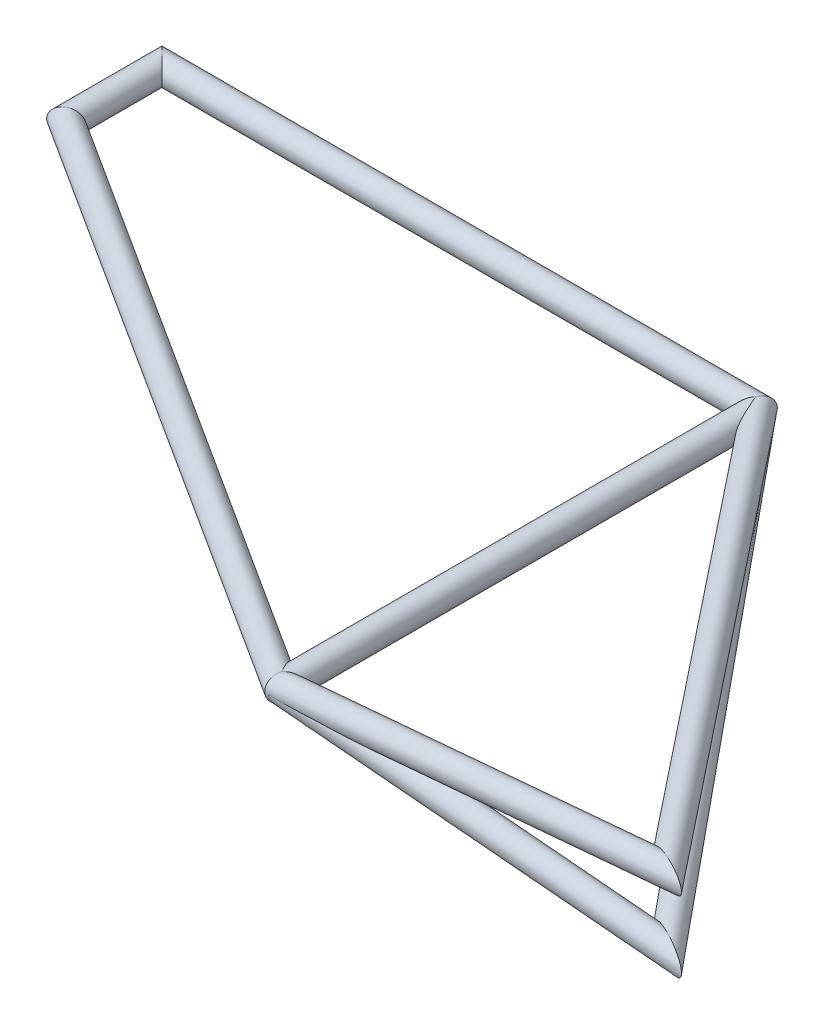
ISO-10303-21;
HEADER;
FILE_DESCRIPTION(('STEP AP214'),'2;1');
FILE_NAME('part.step','',(''),(''),'','','');
FILE_SCHEMA(('AUTOMOTIVE_DESIGN { 1 0 10303 214 1 1 1 1 }'));
ENDSEC;
DATA;
#1=APPLICATION_CONTEXT('core data for automotive mechanical design processes');
#2=APPLICATION_PROTOCOL_DEFINITION('international standard','automotive_design',2000,#1);
#3=PRODUCT_CONTEXT('',#1,'mechanical');
#4=PRODUCT('Part','Part','',(#3));
#5=PRODUCT_RELATED_PRODUCT_CATEGORY('part','',(#4));
#6=PRODUCT_DEFINITION_FORMATION('','',#4);
#7=PRODUCT_DEFINITION_CONTEXT('part definition',#1,'design');
#8=PRODUCT_DEFINITION('design','',#6,#7);
#9=PRODUCT_DEFINITION_SHAPE('','',#8);
#10=(LENGTH_UNIT() NAMED_UNIT(*) SI_UNIT(.MILLI.,.METRE.));
#11=(NAMED_UNIT(*) PLANE_ANGLE_UNIT() SI_UNIT($,.RADIAN.));
#12=(NAMED_UNIT(*) SI_UNIT($,.STERADIAN.) SOLID_ANGLE_UNIT());
#13=UNCERTAINTY_MEASURE_WITH_UNIT(LENGTH_MEASURE(1.E-05),#10,'distance_accuracy_value','');
#14=(GEOMETRIC_REPRESENTATION_CONTEXT(3) GLOBAL_UNCERTAINTY_ASSIGNED_CONTEXT((#13)) GLOBAL_UNIT_ASSIGNED_CONTEXT((#10,
#11,#12)) REPRESENTATION_CONTEXT('',''));
#15=CARTESIAN_POINT('',(0.,0.,0.));
#16=DIRECTION('',(0.,0.,1.));
#17=DIRECTION('',(1.,0.,0.));
#18=AXIS2_PLACEMENT_3D('',#15,#16,#17);
#19=CARTESIAN_POINT('',(-500.,0.,-320.));
#20=DIRECTION('',(0.,0.,-1.));
#21=DIRECTION('',(0.,1.,0.));
#22=AXIS2_PLACEMENT_3D('',#19,#20,#21);
#23=CYLINDRICAL_SURFACE('',#22,7.8994);
#24=CARTESIAN_POINT('',(-500.,0.,-320.));
#25=DIRECTION('',(0.480076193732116,0.,0.877226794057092));
#26=DIRECTION('',(0.877226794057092,0.,-0.480076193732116));
#27=AXIS2_PLACEMENT_3D('',#24,#25,#26);
#28=ELLIPSE('',#27,9.00496890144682,7.8994);
#29=CARTESIAN_POINT('',(-492.1006,0.,-324.323071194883));
#30=VERTEX_POINT('',#29);
#31=EDGE_CURVE('E67',#30,#30,#28,.T.);
#32=ORIENTED_EDGE('',*,*,#31,.T.);
#33=EDGE_LOOP('',(#32));
#34=FACE_BOUND('',#33,.T.);
#35=CARTESIAN_POINT('',(-500.,0.,-400.));
#36=DIRECTION('',(0.707106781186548,0.,-0.707106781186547));
#37=DIRECTION('',(-0.707106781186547,0.,-0.707106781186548));
#38=AXIS2_PLACEMENT_3D('',#35,#36,#37);
#39=ELLIPSE('',#38,11.17143861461,7.8994);
#40=CARTESIAN_POINT('',(-507.8994,0.,-407.8994));
#41=VERTEX_POINT('',#40);
#42=EDGE_CURVE('E57',#41,#41,#39,.T.);
#43=ORIENTED_EDGE('',*,*,#42,.T.);
#44=EDGE_LOOP('',(#43));
#45=FACE_BOUND('',#44,.T.);
#46=ADVANCED_FACE('F53',(#34,#45),#23,.F.);
#47=CARTESIAN_POINT('',(-500.,0.,-320.));
#48=DIRECTION('',(0.,0.,-1.));
#49=DIRECTION('',(0.,1.,0.));
#50=AXIS2_PLACEMENT_3D('',#47,#48,#49);
#51=CYLINDRICAL_SURFACE('',#50,10.668);
#52=CARTESIAN_POINT('',(-500.,0.,-320.));
#53=DIRECTION('',(0.480076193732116,0.,0.877226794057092));
#54=DIRECTION('',(0.877226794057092,0.,-0.480076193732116));
#55=AXIS2_PLACEMENT_3D('',#52,#53,#54);
#56=ELLIPSE('',#55,12.1610512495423,10.668);
#57=CARTESIAN_POINT('',(-489.332,0.,-325.838231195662));
#58=VERTEX_POINT('',#57);
#59=EDGE_CURVE('E61',#58,#58,#56,.T.);
#60=ORIENTED_EDGE('',*,*,#59,.F.);
#61=EDGE_LOOP('',(#60));
#62=FACE_BOUND('',#61,.T.);
#63=CARTESIAN_POINT('',(-500.,0.,-400.));
#64=DIRECTION('',(0.707106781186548,0.,-0.707106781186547));
#65=DIRECTION('',(-0.707106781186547,0.,-0.707106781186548));
#66=AXIS2_PLACEMENT_3D('',#63,#64,#65);
#67=ELLIPSE('',#66,15.0868302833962,10.668);
#68=CARTESIAN_POINT('',(-510.668,0.,-410.668));
#69=VERTEX_POINT('',#68);
#70=EDGE_CURVE('E12',#69,#69,#67,.T.);
#71=ORIENTED_EDGE('',*,*,#70,.F.);
#72=EDGE_LOOP('',(#71));
#73=FACE_BOUND('',#72,.T.);
#74=ADVANCED_FACE('F80',(#62,#73),#51,.T.);
#75=CARTESIAN_POINT('',(-500.,0.,-320.));
#76=DIRECTION('',(0.480076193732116,0.,0.877226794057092));
#77=DIRECTION('',(0.877226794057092,0.,-0.480076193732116));
#78=AXIS2_PLACEMENT_3D('',#75,#76,#77);
#79=PLANE('',#78);
#80=ORIENTED_EDGE('',*,*,#31,.F.);
#81=EDGE_LOOP('',(#80));
#82=FACE_BOUND('',#81,.T.);
#83=ORIENTED_EDGE('',*,*,#59,.T.);
#84=EDGE_LOOP('',(#83));
#85=FACE_BOUND('',#84,.T.);
#86=ADVANCED_FACE('F76',(#82,#85),#79,.T.);
#87=CARTESIAN_POINT('',(-500.,0.,-400.));
#88=DIRECTION('',(0.707106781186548,0.,-0.707106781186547));
#89=DIRECTION('',(-0.707106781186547,0.,-0.707106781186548));
#90=AXIS2_PLACEMENT_3D('',#87,#88,#89);
#91=PLANE('',#90);
#92=ORIENTED_EDGE('',*,*,#42,.F.);
#93=EDGE_LOOP('',(#92));
#94=FACE_BOUND('',#93,.T.);
#95=ORIENTED_EDGE('',*,*,#70,.T.);
#96=EDGE_LOOP('',(#95));
#97=FACE_BOUND('',#96,.T.);
#98=ADVANCED_FACE('F55',(#94,#97),#91,.T.);
#99=CLOSED_SHELL('',(#46,#74,#86,#98));
#100=MANIFOLD_SOLID_BREP('B2',#99);
#101=CARTESIAN_POINT('',(-500.,0.,-400.));
#102=DIRECTION('',(1.,0.,0.));
#103=DIRECTION('',(0.,1.,0.));
#104=AXIS2_PLACEMENT_3D('',#101,#102,#103);
#105=CYLINDRICAL_SURFACE('',#104,7.8994);
#106=CARTESIAN_POINT('',(0.,0.,-400.));
#107=DIRECTION('',(0.902272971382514,0.0304562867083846,0.430088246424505));
#108=DIRECTION('',(0.431165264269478,-0.0637339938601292,-0.900019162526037));
#109=AXIS2_PLACEMENT_3D('',#106,#107,#108);
#110=ELLIPSE('',#109,8.75500015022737,7.8994);
#111=CARTESIAN_POINT('',(3.7748519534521,-0.55799112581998,-407.879667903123));
#112=VERTEX_POINT('',#111);
#113=EDGE_CURVE('E164',#112,#112,#110,.T.);
#114=ORIENTED_EDGE('',*,*,#113,.T.);
#115=EDGE_LOOP('',(#114));
#116=FACE_BOUND('',#115,.T.);
#117=CARTESIAN_POINT('',(-500.,0.,-400.));
#118=DIRECTION('',(-0.707106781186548,0.,0.707106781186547));
#119=DIRECTION('',(0.707106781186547,0.,0.707106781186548));
#120=AXIS2_PLACEMENT_3D('',#117,#118,#119);
#121=ELLIPSE('',#120,11.17143861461,7.8994);
#122=CARTESIAN_POINT('',(-492.1006,0.,-392.1006));
#123=VERTEX_POINT('',#122);
#124=EDGE_CURVE('E154',#123,#123,#121,.T.);
#125=ORIENTED_EDGE('',*,*,#124,.T.);
#126=EDGE_LOOP('',(#125));
#127=FACE_BOUND('',#126,.T.);
#128=ADVANCED_FACE('F150',(#116,#127),#105,.F.);
#129=CARTESIAN_POINT('',(-500.,0.,-400.));
#130=DIRECTION('',(1.,0.,0.));
#131=DIRECTION('',(0.,1.,0.));
#132=AXIS2_PLACEMENT_3D('',#129,#130,#131);
#133=CYLINDRICAL_SURFACE('',#132,10.668);
#134=CARTESIAN_POINT('',(0.,0.,-400.));
#135=DIRECTION('',(0.902272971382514,0.0304562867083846,0.430088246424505));
#136=DIRECTION('',(0.431165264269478,-0.0637339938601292,-0.900019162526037));
#137=AXIS2_PLACEMENT_3D('',#134,#135,#136);
#138=ELLIPSE('',#137,11.8234728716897,10.668);
#139=CARTESIAN_POINT('',(5.09787080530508,-0.753557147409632,-410.641352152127));
#140=VERTEX_POINT('',#139);
#141=EDGE_CURVE('E158',#140,#140,#138,.T.);
#142=ORIENTED_EDGE('',*,*,#141,.F.);
#143=EDGE_LOOP('',(#142));
#144=FACE_BOUND('',#143,.T.);
#145=CARTESIAN_POINT('',(-500.,0.,-400.));
#146=DIRECTION('',(-0.707106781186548,0.,0.707106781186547));
#147=DIRECTION('',(0.707106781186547,0.,0.707106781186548));
#148=AXIS2_PLACEMENT_3D('',#145,#146,#147);
#149=ELLIPSE('',#148,15.0868302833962,10.668);
#150=CARTESIAN_POINT('',(-489.332,0.,-389.332));
#151=VERTEX_POINT('',#150);
#152=EDGE_CURVE('E52',#151,#151,#149,.T.);
#153=ORIENTED_EDGE('',*,*,#152,.F.);
#154=EDGE_LOOP('',(#153));
#155=FACE_BOUND('',#154,.T.);
#156=ADVANCED_FACE('F177',(#144,#155),#133,.T.);
#157=CARTESIAN_POINT('',(0.,0.,-400.));
#158=DIRECTION('',(0.902272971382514,0.0304562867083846,0.430088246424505));
#159=DIRECTION('',(0.43028785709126,0.,-0.902691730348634));
#160=AXIS2_PLACEMENT_3D('',#157,#158,#159);
#161=PLANE('',#160);
#162=ORIENTED_EDGE('',*,*,#113,.F.);
#163=EDGE_LOOP('',(#162));
#164=FACE_BOUND('',#163,.T.);
#165=ORIENTED_EDGE('',*,*,#141,.T.);
#166=EDGE_LOOP('',(#165));
#167=FACE_BOUND('',#166,.T.);
#168=ADVANCED_FACE('F173',(#164,#167),#161,.T.);
#169=CARTESIAN_POINT('',(-500.,0.,-400.));
#170=DIRECTION('',(-0.707106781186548,0.,0.707106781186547));
#171=DIRECTION('',(0.707106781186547,0.,0.707106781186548));
#172=AXIS2_PLACEMENT_3D('',#169,#170,#171);
#173=PLANE('',#172);
#174=ORIENTED_EDGE('',*,*,#124,.F.);
#175=EDGE_LOOP('',(#174));
#176=FACE_BOUND('',#175,.T.);
#177=ORIENTED_EDGE('',*,*,#152,.T.);
#178=EDGE_LOOP('',(#177));
#179=FACE_BOUND('',#178,.T.);
#180=ADVANCED_FACE('F152',(#176,#179),#173,.T.);
#181=CLOSED_SHELL('',(#128,#156,#168,#180));
#182=MANIFOLD_SOLID_BREP('B7',#181);
#183=CARTESIAN_POINT('',(-1.11022302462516E-13,0.,0.));
#184=DIRECTION('',(-0.842271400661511,0.,-0.539053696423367));
#185=DIRECTION('',(-0.539053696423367,0.,0.842271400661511));
#186=AXIS2_PLACEMENT_3D('',#183,#184,#185);
#187=CYLINDRICAL_SURFACE('',#186,7.8994);
#188=CARTESIAN_POINT('',(0.,0.,0.));
#189=DIRECTION('',(0.958609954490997,0.0454446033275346,0.281072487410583));
#190=DIRECTION('',(0.271310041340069,0.153623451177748,-0.950152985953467));
#191=AXIS2_PLACEMENT_3D('',#188,#189,#190);
#192=ELLIPSE('',#191,8.23778418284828,7.8994);
#193=CARTESIAN_POINT('',(2.23499356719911,1.26551683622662,-7.82715523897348));
#194=VERTEX_POINT('',#193);
#195=EDGE_CURVE('E263',#194,#194,#192,.T.);
#196=ORIENTED_EDGE('',*,*,#195,.T.);
#197=EDGE_LOOP('',(#196));
#198=FACE_BOUND('',#197,.T.);
#199=CARTESIAN_POINT('',(-500.,0.,-320.));
#200=DIRECTION('',(-0.480076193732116,0.,-0.877226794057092));
#201=DIRECTION('',(-0.877226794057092,0.,0.480076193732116));
#202=AXIS2_PLACEMENT_3D('',#199,#200,#201);
#203=ELLIPSE('',#202,9.00496890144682,7.8994);
#204=CARTESIAN_POINT('',(-507.8994,0.,-315.676928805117));
#205=VERTEX_POINT('',#204);
#206=EDGE_CURVE('E253',#205,#205,#203,.T.);
#207=ORIENTED_EDGE('',*,*,#206,.T.);
#208=EDGE_LOOP('',(#207));
#209=FACE_BOUND('',#208,.T.);
#210=ADVANCED_FACE('F249',(#198,#209),#187,.F.);
#211=CARTESIAN_POINT('',(-1.11022302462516E-13,0.,0.));
#212=DIRECTION('',(-0.842271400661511,0.,-0.539053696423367));
#213=DIRECTION('',(-0.539053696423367,0.,0.842271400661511));
#214=AXIS2_PLACEMENT_3D('',#211,#212,#213);
#215=CYLINDRICAL_SURFACE('',#214,10.668);
#216=CARTESIAN_POINT('',(0.,0.,0.));
#217=DIRECTION('',(0.958609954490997,0.0454446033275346,0.281072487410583));
#218=DIRECTION('',(0.271310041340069,0.153623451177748,-0.950152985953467));
#219=AXIS2_PLACEMENT_3D('',#216,#217,#218);
#220=ELLIPSE('',#219,11.1249818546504,10.668);
#221=CARTESIAN_POINT('',(3.01831928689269,1.70905810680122,-10.5704347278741));
#222=VERTEX_POINT('',#221);
#223=EDGE_CURVE('E257',#222,#222,#220,.T.);
#224=ORIENTED_EDGE('',*,*,#223,.F.);
#225=EDGE_LOOP('',(#224));
#226=FACE_BOUND('',#225,.T.);
#227=CARTESIAN_POINT('',(-500.,0.,-320.));
#228=DIRECTION('',(-0.480076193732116,0.,-0.877226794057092));
#229=DIRECTION('',(-0.877226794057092,0.,0.480076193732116));
#230=AXIS2_PLACEMENT_3D('',#227,#228,#229);
#231=ELLIPSE('',#230,12.1610512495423,10.668);
#232=CARTESIAN_POINT('',(-510.668,0.,-314.161768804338));
#233=VERTEX_POINT('',#232);
#234=EDGE_CURVE('E149',#233,#233,#231,.T.);
#235=ORIENTED_EDGE('',*,*,#234,.F.);
#236=EDGE_LOOP('',(#235));
#237=FACE_BOUND('',#236,.T.);
#238=ADVANCED_FACE('F276',(#226,#237),#215,.T.);
#239=CARTESIAN_POINT('',(0.,0.,0.));
#240=DIRECTION('',(0.958609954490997,0.0454446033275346,0.281072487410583));
#241=DIRECTION('',(0.28136317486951,0.,-0.959601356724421));
#242=AXIS2_PLACEMENT_3D('',#239,#240,#241);
#243=PLANE('',#242);
#244=ORIENTED_EDGE('',*,*,#195,.F.);
#245=EDGE_LOOP('',(#244));
#246=FACE_BOUND('',#245,.T.);
#247=ORIENTED_EDGE('',*,*,#223,.T.);
#248=EDGE_LOOP('',(#247));
#249=FACE_BOUND('',#248,.T.);
#250=ADVANCED_FACE('F272',(#246,#249),#243,.T.);
#251=CARTESIAN_POINT('',(-500.,0.,-320.));
#252=DIRECTION('',(-0.480076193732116,0.,-0.877226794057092));
#253=DIRECTION('',(-0.877226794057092,0.,0.480076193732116));
#254=AXIS2_PLACEMENT_3D('',#251,#252,#253);
#255=PLANE('',#254);
#256=ORIENTED_EDGE('',*,*,#206,.F.);
#257=EDGE_LOOP('',(#256));
#258=FACE_BOUND('',#257,.T.);
#259=ORIENTED_EDGE('',*,*,#234,.T.);
#260=EDGE_LOOP('',(#259));
#261=FACE_BOUND('',#260,.T.);
#262=ADVANCED_FACE('F251',(#258,#261),#255,.T.);
#263=CLOSED_SHELL('',(#210,#238,#250,#262));
#264=MANIFOLD_SOLID_BREP('B47',#263);
#265=CARTESIAN_POINT('',(323.763276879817,-28.325616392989,0.));
#266=DIRECTION('',(-0.996194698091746,0.0871557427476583,0.));
#267=DIRECTION('',(-0.0871557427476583,-0.996194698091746,0.));
#268=AXIS2_PLACEMENT_3D('',#265,#266,#267);
#269=CYLINDRICAL_SURFACE('',#268,7.8994);
#270=CARTESIAN_POINT('',(323.763276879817,-28.325616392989,0.));
#271=DIRECTION('',(0.42813625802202,-0.0374570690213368,-0.902937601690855));
#272=DIRECTION('',(-0.899501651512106,0.0786961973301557,-0.429771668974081));
#273=AXIS2_PLACEMENT_3D('',#270,#271,#272);
#274=ELLIPSE('',#273,18.3804577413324,7.8994);
#275=CARTESIAN_POINT('',(307.23002478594,-26.8791442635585,-7.89940000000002));
#276=VERTEX_POINT('',#275);
#277=EDGE_CURVE('E407',#276,#276,#274,.T.);
#278=ORIENTED_EDGE('',*,*,#277,.T.);
#279=EDGE_LOOP('',(#278));
#280=FACE_BOUND('',#279,.T.);
#281=CARTESIAN_POINT('',(15.8830612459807,-9.31916222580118,0.));
#282=CARTESIAN_POINT('',(15.883061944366,-9.31916158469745,0.148447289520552));
#283=CARTESIAN_POINT('',(15.8893004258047,-9.31549709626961,0.296904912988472));
#284=CARTESIAN_POINT('',(15.9141620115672,-9.30094439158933,0.592488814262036));
#285=CARTESIAN_POINT('',(15.9327914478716,-9.29005248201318,0.739614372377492));
#286=CARTESIAN_POINT('',(15.9821810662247,-9.26134364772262,1.03134013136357));
#287=CARTESIAN_POINT('',(16.0129586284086,-9.24351680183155,1.17593640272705));
#288=CARTESIAN_POINT('',(16.0861866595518,-9.20143842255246,1.46124699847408));
#289=CARTESIAN_POINT('',(16.1286428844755,-9.17718372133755,1.60195937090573));
#290=CARTESIAN_POINT('',(16.2242475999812,-9.12310687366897,1.87738909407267));
#291=CARTESIAN_POINT('',(16.2773151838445,-9.0933269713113,2.01214291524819));
#292=CARTESIAN_POINT('',(16.39361616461,-9.02881626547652,2.27598575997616));
#293=CARTESIAN_POINT('',(16.4568537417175,-8.9940834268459,2.40507242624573));
#294=CARTESIAN_POINT('',(16.6605617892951,-8.88366482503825,2.78273618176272));
#295=CARTESIAN_POINT('',(16.8151216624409,-8.80170449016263,3.02198218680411));
#296=CARTESIAN_POINT('',(17.2165535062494,-8.59578041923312,3.55453151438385));
#297=CARTESIAN_POINT('',(17.4765969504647,-8.46734420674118,3.83610451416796));
#298=CARTESIAN_POINT('',(17.8973428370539,-8.26979458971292,4.22151897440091));
#299=CARTESIAN_POINT('',(18.0429177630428,-8.20303732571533,4.3439702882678));
#300=CARTESIAN_POINT('',(18.3427652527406,-8.06894793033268,4.57738740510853));
#301=CARTESIAN_POINT('',(18.4970366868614,-8.00161587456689,4.68835469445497));
#302=CARTESIAN_POINT('',(18.9156059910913,-7.82359219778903,4.96840979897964));
#303=CARTESIAN_POINT('',(19.1861680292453,-7.71320043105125,5.12832252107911));
#304=CARTESIAN_POINT('',(19.7419024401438,-7.49606348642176,5.42335047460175));
#305=CARTESIAN_POINT('',(20.0270853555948,-7.3893210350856,5.55844748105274));
#306=CARTESIAN_POINT('',(20.608869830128,-7.18071416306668,5.80802866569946));
#307=CARTESIAN_POINT('',(20.9054969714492,-7.07886196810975,5.92246297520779));
#308=CARTESIAN_POINT('',(21.3563466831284,-6.93046302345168,6.08093005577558));
#309=CARTESIAN_POINT('',(21.5075974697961,-6.88173181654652,6.13155008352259));
#310=CARTESIAN_POINT('',(21.8118494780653,-6.78573947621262,6.22878890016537));
#311=CARTESIAN_POINT('',(21.964850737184,-6.73847837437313,6.27540760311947));
#312=CARTESIAN_POINT('',(22.3525680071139,-6.62117496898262,6.3883617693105));
#313=CARTESIAN_POINT('',(22.5882789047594,-6.55210849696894,6.45229773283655));
#314=CARTESIAN_POINT('',(23.0625482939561,-6.41736728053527,6.57281661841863));
#315=CARTESIAN_POINT('',(23.3011071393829,-6.35169296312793,6.62939861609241));
#316=CARTESIAN_POINT('',(23.7806348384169,-6.22361272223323,6.73616009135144));
#317=CARTESIAN_POINT('',(24.0216047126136,-6.16120825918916,6.78633672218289));
#318=CARTESIAN_POINT('',(24.5054480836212,-6.03955942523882,6.88105460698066));
#319=CARTESIAN_POINT('',(24.7483216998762,-5.98031525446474,6.92559550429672));
#320=CARTESIAN_POINT('',(25.4802816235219,-5.806854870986,7.05198765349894));
#321=CARTESIAN_POINT('',(25.9717354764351,-5.69716831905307,7.1263985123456));
#322=CARTESIAN_POINT('',(26.9588180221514,-5.48856956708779,7.25976008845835));
#323=CARTESIAN_POINT('',(27.4544458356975,-5.38965515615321,7.31871398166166));
#324=CARTESIAN_POINT('',(28.4519667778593,-5.20067371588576,7.42470754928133));
#325=CARTESIAN_POINT('',(28.9538797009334,-5.11066764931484,7.47166819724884));
#326=CARTESIAN_POINT('',(29.9599675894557,-4.93904603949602,7.55560658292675));
#327=CARTESIAN_POINT('',(30.4641426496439,-4.85743085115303,7.59258389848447));
#328=CARTESIAN_POINT('',(31.4734574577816,-4.70166243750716,7.65833663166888));
#329=CARTESIAN_POINT('',(31.9785949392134,-4.6274991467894,7.68712321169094));
#330=CARTESIAN_POINT('',(32.7372120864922,-4.52108957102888,7.72523891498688));
#331=CARTESIAN_POINT('',(32.9902328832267,-4.48642603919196,7.73709999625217));
#332=CARTESIAN_POINT('',(33.4965453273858,-4.41861212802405,7.75927227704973));
#333=CARTESIAN_POINT('',(33.7498369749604,-4.38546174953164,7.76958347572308));
#334=CARTESIAN_POINT('',(34.5869412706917,-4.27829598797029,7.80130255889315));
#335=CARTESIAN_POINT('',(35.1712633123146,-4.20733290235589,7.81965730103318));
#336=CARTESIAN_POINT('',(36.3408323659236,-4.0719279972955,7.85010946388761));
#337=CARTESIAN_POINT('',(36.926079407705,-4.00748639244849,7.86220667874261));
#338=CARTESIAN_POINT('',(38.0973183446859,-3.88428224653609,7.88109997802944));
#339=CARTESIAN_POINT('',(38.6833103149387,-3.82552033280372,7.88789547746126));
#340=CARTESIAN_POINT('',(39.8558105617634,-3.71298138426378,7.89691626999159));
#341=CARTESIAN_POINT('',(40.4423188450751,-3.65920441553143,7.89914150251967));
#342=CARTESIAN_POINT('',(42.2029703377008,-3.50438186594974,7.89985589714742));
#343=CARTESIAN_POINT('',(43.3776961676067,-3.4099006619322,7.89237615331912));
#344=CARTESIAN_POINT('',(45.7279210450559,-3.23465572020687,7.86474744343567));
#345=CARTESIAN_POINT('',(46.9034200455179,-3.15389121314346,7.84459918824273));
#346=CARTESIAN_POINT('',(49.2576697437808,-3.00314484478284,7.79353830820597));
#347=CARTESIAN_POINT('',(50.4364215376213,-2.93318902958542,7.7626002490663));
#348=CARTESIAN_POINT('',(52.7941392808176,-2.8021987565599,7.69120924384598));
#349=CARTESIAN_POINT('',(53.9731052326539,-2.74116440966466,7.65075617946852));
#350=CARTESIAN_POINT('',(56.3307121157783,-2.62644037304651,7.56106954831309));
#351=CARTESIAN_POINT('',(57.5093530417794,-2.57274855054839,7.51183854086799));
#352=CARTESIAN_POINT('',(59.8665061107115,-2.47145135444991,7.40494116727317));
#353=CARTESIAN_POINT('',(61.0450182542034,-2.42384595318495,7.34727483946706));
#354=CARTESIAN_POINT('',(63.4046886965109,-2.33363650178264,7.22341735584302));
#355=CARTESIAN_POINT('',(64.5858463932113,-2.29104500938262,7.15720563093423));
#356=CARTESIAN_POINT('',(66.94779928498,-2.21021620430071,7.01617618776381));
#357=CARTESIAN_POINT('',(68.1285944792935,-2.17197890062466,6.94135845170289));
#358=CARTESIAN_POINT('',(70.4898651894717,-2.09922205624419,6.78266456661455));
#359=CARTESIAN_POINT('',(71.6703406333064,-2.06470306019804,6.69878709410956));
#360=CARTESIAN_POINT('',(74.0306441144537,-1.99887481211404,6.52126753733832));
#361=CARTESIAN_POINT('',(75.2104721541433,-1.96756554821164,6.42762548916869));
#362=CARTESIAN_POINT('',(77.5664819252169,-1.90780492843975,6.22976338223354));
#363=CARTESIAN_POINT('',(78.7426656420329,-1.87934693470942,6.12556908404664));
#364=CARTESIAN_POINT('',(81.0939349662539,-1.82485657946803,5.90492603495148));
#365=CARTESIAN_POINT('',(82.2690205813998,-1.79882420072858,5.78847737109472));
#366=CARTESIAN_POINT('',(84.6175453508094,-1.74889873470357,5.54122546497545));
#367=CARTESIAN_POINT('',(85.7909847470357,-1.72500529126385,5.41042462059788));
#368=CARTESIAN_POINT('',(87.5495809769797,-1.69058614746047,5.20104030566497));
#369=CARTESIAN_POINT('',(88.1355112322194,-1.67935008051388,5.12904943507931));
#370=CARTESIAN_POINT('',(89.306747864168,-1.65732575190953,4.98010325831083));
#371=CARTESIAN_POINT('',(89.8920542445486,-1.64653748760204,4.90314798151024));
#372=CARTESIAN_POINT('',(91.0612474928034,-1.62539671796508,4.74366747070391));
#373=CARTESIAN_POINT('',(91.645135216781,-1.61504373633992,4.6611485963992));
#374=CARTESIAN_POINT('',(92.8119995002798,-1.59473884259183,4.48954746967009));
#375=CARTESIAN_POINT('',(93.3949759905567,-1.58478695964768,4.40046474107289));
#376=CARTESIAN_POINT('',(94.5613880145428,-1.56523831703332,4.21425700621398));
#377=CARTESIAN_POINT('',(95.1448199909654,-1.55564266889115,4.11710946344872));
#378=CARTESIAN_POINT('',(96.3099096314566,-1.53682362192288,3.91330371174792));
#379=CARTESIAN_POINT('',(96.891567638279,-1.52760014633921,3.80664747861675));
#380=CARTESIAN_POINT('',(98.0485524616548,-1.50957504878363,3.58212072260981));
#381=CARTESIAN_POINT('',(98.6238951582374,-1.50077093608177,3.46433347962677));
#382=CARTESIAN_POINT('',(99.4845692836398,-1.48782455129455,3.27580870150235));
#383=CARTESIAN_POINT('',(99.7711902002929,-1.48355065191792,3.21096348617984));
#384=CARTESIAN_POINT('',(100.343327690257,-1.47509174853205,3.07659731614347));
#385=CARTESIAN_POINT('',(100.628844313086,-1.47090674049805,3.00707657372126));
#386=CARTESIAN_POINT('',(101.197213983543,-1.46264555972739,2.86271688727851));
#387=CARTESIAN_POINT('',(101.480073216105,-1.45856899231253,2.78790242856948));
#388=CARTESIAN_POINT('',(102.043870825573,-1.45051033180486,2.63136272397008));
#389=CARTESIAN_POINT('',(102.324809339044,-1.44652823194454,2.54963797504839));
#390=CARTESIAN_POINT('',(102.883602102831,-1.43867171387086,2.37741433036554));
#391=CARTESIAN_POINT('',(103.161459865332,-1.43479716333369,2.2869268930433));
#392=CARTESIAN_POINT('',(103.712998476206,-1.42716705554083,2.09408389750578));
#393=CARTESIAN_POINT('',(103.986681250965,-1.42341144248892,1.99173401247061));
#394=CARTESIAN_POINT('',(104.325072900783,-1.41880332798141,1.85266723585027));
#395=CARTESIAN_POINT('',(104.39311921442,-1.41787852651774,1.82405587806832));
#396=CARTESIAN_POINT('',(104.528670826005,-1.41603983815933,1.76557007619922));
#397=CARTESIAN_POINT('',(104.596176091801,-1.41512595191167,1.7356955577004));
#398=CARTESIAN_POINT('',(104.797857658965,-1.41240082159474,1.64390832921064));
#399=CARTESIAN_POINT('',(104.931087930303,-1.41060762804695,1.57987728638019));
#400=CARTESIAN_POINT('',(105.193365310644,-1.40709059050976,1.44471499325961));
#401=CARTESIAN_POINT('',(105.322424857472,-1.40536653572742,1.37360806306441));
#402=CARTESIAN_POINT('',(105.574572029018,-1.4020100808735,1.22159546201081));
#403=CARTESIAN_POINT('',(105.697668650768,-1.40037754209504,1.1407052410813));
#404=CARTESIAN_POINT('',(105.902797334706,-1.39766584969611,0.9876435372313));
#405=CARTESIAN_POINT('',(105.987188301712,-1.39655313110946,0.918668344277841));
#406=CARTESIAN_POINT('',(106.146316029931,-1.39445953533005,0.770300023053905));
#407=CARTESIAN_POINT('',(106.221084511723,-1.39347822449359,0.690942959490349));
#408=CARTESIAN_POINT('',(106.321327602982,-1.39216478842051,0.560061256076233));
#409=CARTESIAN_POINT('',(106.353215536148,-1.39174742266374,0.513506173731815));
#410=CARTESIAN_POINT('',(106.410343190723,-1.39100024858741,0.416432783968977));
#411=CARTESIAN_POINT('',(106.435590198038,-1.39067034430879,0.365918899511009));
#412=CARTESIAN_POINT('',(106.473918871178,-1.39016974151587,0.269265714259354));
#413=CARTESIAN_POINT('',(106.488270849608,-1.38998240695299,0.223639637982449));
#414=CARTESIAN_POINT('',(106.509088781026,-1.38971072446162,0.130627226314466));
#415=CARTESIAN_POINT('',(106.515564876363,-1.38962624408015,0.0832432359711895));
#416=CARTESIAN_POINT('',(106.51985893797,-1.38957022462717,-0.012097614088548));
#417=CARTESIAN_POINT('',(106.517646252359,-1.38959908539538,-0.0600559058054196));
#418=CARTESIAN_POINT('',(106.50478463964,-1.38976689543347,-0.154831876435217));
#419=CARTESIAN_POINT('',(106.49412723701,-1.38990595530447,-0.201648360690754));
#420=CARTESIAN_POINT('',(106.461929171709,-1.39032630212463,-0.304620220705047));
#421=CARTESIAN_POINT('',(106.438306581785,-1.39063481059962,-0.360113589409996));
#422=CARTESIAN_POINT('',(106.382599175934,-1.391363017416,-0.466649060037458));
#423=CARTESIAN_POINT('',(106.350495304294,-1.39178296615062,-0.517680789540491));
#424=CARTESIAN_POINT('',(106.253766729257,-1.39304967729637,-0.652531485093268));
#425=CARTESIAN_POINT('',(106.182952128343,-1.39397848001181,-0.73184035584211));
#426=CARTESIAN_POINT('',(106.031287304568,-1.39597236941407,-0.880069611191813));
#427=CARTESIAN_POINT('',(105.950405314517,-1.39703788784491,-0.948955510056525));
#428=CARTESIAN_POINT('',(105.731204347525,-1.39993283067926,-1.11890804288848));
#429=CARTESIAN_POINT('',(105.588121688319,-1.40182946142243,-1.21375087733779));
#430=CARTESIAN_POINT('',(105.294011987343,-1.40574502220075,-1.39039934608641));
#431=CARTESIAN_POINT('',(105.142965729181,-1.40776425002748,-1.47217132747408));
#432=CARTESIAN_POINT('',(104.835327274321,-1.41189529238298,-1.6267971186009));
#433=CARTESIAN_POINT('',(104.678708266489,-1.41400757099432,-1.69959716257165));
#434=CARTESIAN_POINT('',(104.362634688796,-1.41829004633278,-1.83805174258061));
#435=CARTESIAN_POINT('',(104.203184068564,-1.42046016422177,-1.90371544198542));
#436=CARTESIAN_POINT('',(103.856326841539,-1.42520301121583,-2.03970231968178));
#437=CARTESIAN_POINT('',(103.668549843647,-1.42778434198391,-2.10907543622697));
#438=CARTESIAN_POINT('',(103.290964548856,-1.43300366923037,-2.24208062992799));
#439=CARTESIAN_POINT('',(103.101155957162,-1.43564167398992,-2.3057118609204));
#440=CARTESIAN_POINT('',(102.529322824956,-1.44363378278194,-2.48977822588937));
#441=CARTESIAN_POINT('',(102.145082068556,-1.44906337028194,-2.60331417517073));
#442=CARTESIAN_POINT('',(101.372193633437,-1.46011127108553,-2.81780213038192));
#443=CARTESIAN_POINT('',(100.983537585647,-1.46573000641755,-2.91872325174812));
#444=CARTESIAN_POINT('',(100.20395747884,-1.47713330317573,-3.11079041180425));
#445=CARTESIAN_POINT('',(99.8130341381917,-1.48291781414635,-3.20193938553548));
#446=CARTESIAN_POINT('',(99.0295983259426,-1.49464937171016,-3.37654196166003));
#447=CARTESIAN_POINT('',(98.6370863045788,-1.50059637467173,-3.4599976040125));
#448=CARTESIAN_POINT('',(97.8507627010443,-1.5126550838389,-3.62065409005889));
#449=CARTESIAN_POINT('',(97.4569510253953,-1.51876680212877,-3.69785447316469));
#450=CARTESIAN_POINT('',(96.668908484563,-1.53114782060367,-3.84690524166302));
#451=CARTESIAN_POINT('',(96.2746790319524,-1.53741688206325,-3.918763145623));
#452=CARTESIAN_POINT('',(95.4854471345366,-1.55012435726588,-4.05799986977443));
#453=CARTESIAN_POINT('',(95.0904447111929,-1.55656276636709,-4.12537881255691));
#454=CARTESIAN_POINT('',(93.9102281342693,-1.57604402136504,-4.32075496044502));
#455=CARTESIAN_POINT('',(93.1240736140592,-1.5893427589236,-4.4430555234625));
#456=CARTESIAN_POINT('',(91.5499942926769,-1.61666934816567,-4.67565995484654));
#457=CARTESIAN_POINT('',(90.7620694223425,-1.6306972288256,-4.78596334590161));
#458=CARTESIAN_POINT('',(89.1848148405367,-1.65953644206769,-4.99672094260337));
#459=CARTESIAN_POINT('',(88.3954849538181,-1.67434788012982,-5.09717381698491));
#460=CARTESIAN_POINT('',(86.815824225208,-1.70481354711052,-5.28974478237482));
#461=CARTESIAN_POINT('',(86.0254933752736,-1.72046778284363,-5.38186280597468));
#462=CARTESIAN_POINT('',(84.4432340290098,-1.7527047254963,-5.55897725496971));
#463=CARTESIAN_POINT('',(83.65130472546,-1.76928836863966,-5.64396627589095));
#464=CARTESIAN_POINT('',(82.0668091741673,-1.80344899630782,-5.80756228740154));
#465=CARTESIAN_POINT('',(81.2742429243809,-1.82102598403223,-5.88616925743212));
#466=CARTESIAN_POINT('',(78.8958946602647,-1.8753736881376,-6.1134276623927));
#467=CARTESIAN_POINT('',(77.3093289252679,-1.91376385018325,-6.25353136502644));
#468=CARTESIAN_POINT('',(74.1369613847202,-1.99565708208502,-6.51445536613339));
#469=CARTESIAN_POINT('',(72.5511615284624,-2.03915304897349,-6.63530191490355));
#470=CARTESIAN_POINT('',(69.3785174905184,-2.13240079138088,-6.86015086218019));
#471=CARTESIAN_POINT('',(67.7916732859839,-2.18215270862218,-6.96415287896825));
#472=CARTESIAN_POINT('',(64.6180033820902,-2.2893278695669,-7.15652491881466));
#473=CARTESIAN_POINT('',(63.0311779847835,-2.3467477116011,-7.24490183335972));
#474=CARTESIAN_POINT('',(59.8571539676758,-2.471181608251,-7.4065210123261));
#475=CARTESIAN_POINT('',(58.2699553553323,-2.53819548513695,-7.47976355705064));
#476=CARTESIAN_POINT('',(55.5614732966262,-2.66297937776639,-7.59145995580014));
#477=CARTESIAN_POINT('',(54.4402088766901,-2.71768713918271,-7.63381430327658));
#478=CARTESIAN_POINT('',(52.1977014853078,-2.83444057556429,-7.7102762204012));
#479=CARTESIAN_POINT('',(51.0764585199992,-2.89648672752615,-7.7443832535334));
#480=CARTESIAN_POINT('',(48.8337307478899,-3.02950842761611,-7.80354178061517));
#481=CARTESIAN_POINT('',(47.712246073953,-3.10048814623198,-7.8285890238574));
#482=CARTESIAN_POINT('',(45.4698682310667,-3.25338461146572,-7.8682905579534));
#483=CARTESIAN_POINT('',(44.348975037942,-3.33530086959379,-7.88294531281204));
#484=CARTESIAN_POINT('',(42.6527890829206,-3.46965993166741,-7.89566481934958));
#485=CARTESIAN_POINT('',(42.0771301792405,-3.51707437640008,-7.89833111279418));
#486=CARTESIAN_POINT('',(40.9261594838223,-3.61598384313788,-7.89994793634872));
#487=CARTESIAN_POINT('',(40.3508476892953,-3.66747883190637,-7.8988984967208));
#488=CARTESIAN_POINT('',(39.20058319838,-3.77509373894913,-7.89258113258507));
#489=CARTESIAN_POINT('',(38.6256305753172,-3.83121440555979,-7.88731252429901));
#490=CARTESIAN_POINT('',(37.4763260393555,-3.94870773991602,-7.87190901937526));
#491=CARTESIAN_POINT('',(36.9019741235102,-4.01008038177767,-7.86177414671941));
#492=CARTESIAN_POINT('',(35.7543845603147,-4.13879066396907,-7.83581400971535));
#493=CARTESIAN_POINT('',(35.181146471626,-4.2061249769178,-7.8199919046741));
#494=CARTESIAN_POINT('',(34.0357498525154,-4.34767227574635,-7.78157737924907));
#495=CARTESIAN_POINT('',(33.4635913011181,-4.42188512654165,-7.75898509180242));
#496=CARTESIAN_POINT('',(32.3208804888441,-4.5782220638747,-7.70561644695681));
#497=CARTESIAN_POINT('',(31.7503278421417,-4.66034404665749,-7.6748422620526));
#498=CARTESIAN_POINT('',(30.6112707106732,-4.83375667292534,-7.60321882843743));
#499=CARTESIAN_POINT('',(30.0427660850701,-4.92504667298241,-7.56237028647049));
#500=CARTESIAN_POINT('',(28.9506779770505,-5.11110231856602,-7.47153012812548));
#501=CARTESIAN_POINT('',(28.4268917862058,-5.20510726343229,-7.42244200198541));
#502=CARTESIAN_POINT('',(27.3826731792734,-5.40359929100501,-7.31065115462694));
#503=CARTESIAN_POINT('',(26.8622411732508,-5.50808763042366,-7.24794680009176));
#504=CARTESIAN_POINT('',(25.8259477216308,-5.72910442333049,-7.10513710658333));
#505=CARTESIAN_POINT('',(25.3100888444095,-5.84563922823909,-7.02502256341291));
#506=CARTESIAN_POINT('',(24.5418267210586,-6.03056395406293,-6.88789195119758));
#507=CARTESIAN_POINT('',(24.2866813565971,-6.093886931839,-6.839360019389));
#508=CARTESIAN_POINT('',(23.7786360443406,-6.22408639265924,-6.73578153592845));
#509=CARTESIAN_POINT('',(23.5257359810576,-6.29096269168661,-6.68073532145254));
#510=CARTESIAN_POINT('',(22.9343435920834,-6.45256201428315,-6.54250999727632));
#511=CARTESIAN_POINT('',(22.5969785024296,-6.54881739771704,-6.45623942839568));
#512=CARTESIAN_POINT('',(21.9289001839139,-6.74833282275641,-6.26707237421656));
#513=CARTESIAN_POINT('',(21.5981883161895,-6.85159427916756,-6.16417252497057));
#514=CARTESIAN_POINT('',(20.9465947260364,-7.06473705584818,-5.93834292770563));
#515=CARTESIAN_POINT('',(20.6256944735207,-7.17460456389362,-5.81545411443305));
#516=CARTESIAN_POINT('',(19.9965995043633,-7.40033051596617,-5.54515722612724));
#517=CARTESIAN_POINT('',(19.688396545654,-7.51618496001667,-5.39776537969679));
#518=CARTESIAN_POINT('',(19.217453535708,-7.70160218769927,-5.14268688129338));
#519=CARTESIAN_POINT('',(19.0487920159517,-7.76980929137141,-5.04491761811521));
#520=CARTESIAN_POINT('',(18.7184684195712,-7.90692475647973,-4.83867836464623));
#521=CARTESIAN_POINT('',(18.5568043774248,-7.97583291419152,-4.73021140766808));
#522=CARTESIAN_POINT('',(18.2419577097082,-8.11349357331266,-4.50164436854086));
#523=CARTESIAN_POINT('',(18.0887695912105,-8.18224614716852,-4.38155196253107));
#524=CARTESIAN_POINT('',(17.7925271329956,-8.31847572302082,-4.12891983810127));
#525=CARTESIAN_POINT('',(17.649470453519,-8.38595301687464,-3.99638301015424));
#526=CARTESIAN_POINT('',(17.2943108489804,-8.5573844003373,-3.63580674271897));
#527=CARTESIAN_POINT('',(17.0912466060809,-8.65938049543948,-3.39754336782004));
#528=CARTESIAN_POINT('',(16.8162720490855,-8.80173586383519,-3.01525485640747));
#529=CARTESIAN_POINT('',(16.7295452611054,-8.84741765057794,-2.88366528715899));
#530=CARTESIAN_POINT('',(16.5670113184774,-8.93421980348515,-2.61243582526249));
#531=CARTESIAN_POINT('',(16.4912019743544,-8.97534108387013,-2.47279755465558));
#532=CARTESIAN_POINT('',(16.3632333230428,-9.04558126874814,-2.20993208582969));
#533=CARTESIAN_POINT('',(16.309236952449,-9.07555960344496,-2.08782536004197));
#534=CARTESIAN_POINT('',(16.2102414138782,-9.13098389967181,-1.83902913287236));
#535=CARTESIAN_POINT('',(16.1652405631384,-9.15643070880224,-1.71234049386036));
#536=CARTESIAN_POINT('',(16.0848371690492,-9.20220093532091,-1.45528388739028));
#537=CARTESIAN_POINT('',(16.0494186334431,-9.22253288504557,-1.324922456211));
#538=CARTESIAN_POINT('',(15.9885366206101,-9.25765078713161,-1.06120693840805));
#539=CARTESIAN_POINT('',(15.963069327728,-9.27243886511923,-0.927854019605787));
#540=CARTESIAN_POINT('',(15.9229323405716,-9.29581260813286,-0.66256126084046));
#541=CARTESIAN_POINT('',(15.9079994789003,-9.30454933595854,-0.530674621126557));
#542=CARTESIAN_POINT('',(15.888062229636,-9.31622524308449,-0.265861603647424));
#543=CARTESIAN_POINT('',(15.8830606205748,-9.31916279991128,-0.132934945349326));
#544=CARTESIAN_POINT('',(15.8830612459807,-9.31916222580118,0.));
#545=B_SPLINE_CURVE_WITH_KNOTS('',3,(#281,#282,#283,#284,#285,#286,#287,#288,#289,#290,#291,
#292,#293,#294,#295,#296,#297,#298,#299,#300,#301,#302,#303,#304,#305,#306,#307,#308,#309,#310,
#311,#312,#313,#314,#315,#316,#317,#318,#319,#320,#321,#322,#323,#324,#325,#326,#327,#328,#329,
#330,#331,#332,#333,#334,#335,#336,#337,#338,#339,#340,#341,#342,#343,#344,#345,#346,#347,#348,
#349,#350,#351,#352,#353,#354,#355,#356,#357,#358,#359,#360,#361,#362,#363,#364,#365,#366,#367,
#368,#369,#370,#371,#372,#373,#374,#375,#376,#377,#378,#379,#380,#381,#382,#383,#384,#385,#386,
#387,#388,#389,#390,#391,#392,#393,#394,#395,#396,#397,#398,#399,#400,#401,#402,#403,#404,#405,
#406,#407,#408,#409,#410,#411,#412,#413,#414,#415,#416,#417,#418,#419,#420,#421,#422,#423,#424,
#425,#426,#427,#428,#429,#430,#431,#432,#433,#434,#435,#436,#437,#438,#439,#440,#441,#442,#443,
#444,#445,#446,#447,#448,#449,#450,#451,#452,#453,#454,#455,#456,#457,#458,#459,#460,#461,#462,
#463,#464,#465,#466,#467,#468,#469,#470,#471,#472,#473,#474,#475,#476,#477,#478,#479,#480,#481,
#482,#483,#484,#485,#486,#487,#488,#489,#490,#491,#492,#493,#494,#495,#496,#497,#498,#499,#500,
#501,#502,#503,#504,#505,#506,#507,#508,#509,#510,#511,#512,#513,#514,#515,#516,#517,#518,#519,
#520,#521,#522,#523,#524,#525,#526,#527,#528,#529,#530,#531,#532,#533,#534,#535,#536,#537,#538,
#539,#540,#541,#542,#543,#544),.UNSPECIFIED.,.T.,.F.,(4,2,2,2,2,2,2,2,2,2,2,2,2,2,2,2,2,2,2,2,2,
2,2,2,2,2,2,2,2,2,2,2,2,2,2,2,2,2,2,2,2,2,2,2,2,2,2,2,2,2,2,2,2,2,2,2,2,2,2,2,2,2,2,2,2,2,2,2,2,
2,2,2,2,2,2,2,2,2,2,2,2,2,2,2,2,2,2,2,2,2,2,2,2,2,2,2,2,2,2,2,2,2,2,2,2,2,2,2,2,2,2,2,2,2,2,2,2,
2,2,2,2,2,2,2,2,2,2,2,2,2,2,4),(0.,0.445185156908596,0.890597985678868,1.33665038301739,
1.78292301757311,2.22591456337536,2.66908866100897,3.55458800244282,4.76024625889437,
5.36467566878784,5.96902674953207,6.96669493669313,7.96509291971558,8.9658691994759,
9.466145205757,9.96643195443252,10.7276747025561,11.4890130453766,12.2506885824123,
13.0124122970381,14.5389366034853,16.0651470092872,17.601168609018,19.1372551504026,
20.6712381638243,21.4382090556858,22.205180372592,23.9717913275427,25.7384603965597,
27.5053243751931,29.2722117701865,32.8076270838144,36.3428440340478,39.8864513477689,
43.4301027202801,46.9727225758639,50.5153263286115,54.0666220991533,57.6179252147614,
61.1697478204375,64.721557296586,68.2648959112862,71.8082093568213,75.3509317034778,
77.1222443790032,78.8935465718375,80.662857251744,82.4322964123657,84.2068582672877,
85.9810522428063,87.7428891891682,88.6245463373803,89.5061634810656,90.3839402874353,
91.261654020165,92.1382351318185,93.0143987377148,93.2358551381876,93.4573246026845,
93.9006252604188,94.3424517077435,94.7835893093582,95.1100975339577,95.4355002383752,
95.6044055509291,95.773124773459,95.916029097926,96.0587491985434,96.2019732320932,
96.3453411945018,96.5252599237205,96.7055863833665,97.022769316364,97.3409797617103,
97.8546507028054,98.3696235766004,98.8875461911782,99.4047957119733,100.005264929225,
100.605822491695,101.807549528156,103.012163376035,104.216414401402,105.420345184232,
106.624364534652,107.826656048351,109.028914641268,111.415946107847,113.803072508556,
116.19052107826,118.577988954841,120.967906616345,123.357831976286,128.137277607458,
132.910151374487,137.683133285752,142.454004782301,147.224787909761,150.594933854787,
153.965298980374,157.337243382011,160.709037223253,162.441859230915,164.174667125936,
165.90775590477,167.640836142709,169.372955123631,171.105040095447,172.836665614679,
174.568169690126,176.17117603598,177.774374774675,179.378423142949,180.180314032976,
180.982163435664,182.065571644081,183.149199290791,184.230635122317,185.311357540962,
185.930640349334,186.549748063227,187.168449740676,187.78700806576,188.770378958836,
189.262140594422,189.753803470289,190.163902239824,190.573924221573,190.983257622,
191.39243391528,191.790986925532,192.189651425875),.UNSPECIFIED.);
#546=CARTESIAN_POINT('',(15.8830612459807,-9.31916222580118,0.));
#547=VERTEX_POINT('',#546);
#548=EDGE_CURVE('E400',#547,#547,#545,.T.);
#549=ORIENTED_EDGE('',*,*,#548,.T.);
#550=EDGE_LOOP('',(#549));
#551=FACE_BOUND('',#550,.T.);
#552=ADVANCED_FACE('F348',(#280,#551),#269,.F.);
#553=CARTESIAN_POINT('',(323.763276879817,-28.325616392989,0.));
#554=DIRECTION('',(-0.996194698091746,0.0871557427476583,0.));
#555=DIRECTION('',(-0.0871557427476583,-0.996194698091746,0.));
#556=AXIS2_PLACEMENT_3D('',#553,#554,#555);
#557=CYLINDRICAL_SURFACE('',#556,10.668);
#558=CARTESIAN_POINT('',(323.763276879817,-28.325616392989,0.));
#559=DIRECTION('',(0.42813625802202,-0.0374570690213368,-0.902937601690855));
#560=DIRECTION('',(-0.899501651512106,0.0786961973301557,-0.429771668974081));
#561=AXIS2_PLACEMENT_3D('',#558,#559,#560);
#562=ELLIPSE('',#561,24.8224831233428,10.668);
#563=CARTESIAN_POINT('',(301.435412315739,-26.3721813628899,-10.668));
#564=VERTEX_POINT('',#563);
#565=EDGE_CURVE('E388',#564,#564,#562,.T.);
#566=ORIENTED_EDGE('',*,*,#565,.F.);
#567=EDGE_LOOP('',(#566));
#568=FACE_BOUND('',#567,.T.);
#569=CARTESIAN_POINT('',(0.,0.,0.));
#570=DIRECTION('',(0.,1.,0.));
#571=DIRECTION('',(-1.,0.,0.));
#572=AXIS2_PLACEMENT_3D('',#569,#570,#571);
#573=ELLIPSE('',#572,122.401572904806,10.668);
#574=CARTESIAN_POINT('',(0.,0.,10.668));
#575=VERTEX_POINT('',#574);
#576=CARTESIAN_POINT('',(10.668,7.45063732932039E-13,-10.6274050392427));
#577=VERTEX_POINT('',#576);
#578=EDGE_CURVE('E384',#575,#577,#573,.T.);
#579=ORIENTED_EDGE('',*,*,#578,.F.);
#580=CARTESIAN_POINT('',(0.,0.,0.));
#581=DIRECTION('',(-1.,0.,0.));
#582=DIRECTION('',(0.,1.,0.));
#583=AXIS2_PLACEMENT_3D('',#580,#581,#582);
#584=ELLIPSE('',#583,10.7087500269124,10.668);
#585=CARTESIAN_POINT('',(0.,-10.5704347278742,1.70905810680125));
#586=VERTEX_POINT('',#585);
#587=EDGE_CURVE('E381',#586,#575,#584,.T.);
#588=ORIENTED_EDGE('',*,*,#587,.F.);
#589=CARTESIAN_POINT('',(0.,0.,0.));
#590=DIRECTION('',(-0.271310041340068,0.153623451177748,0.950152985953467));
#591=DIRECTION('',(-0.958609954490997,0.0454446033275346,-0.281072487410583));
#592=AXIS2_PLACEMENT_3D('',#589,#590,#591);
#593=ELLIPSE('',#592,37.6075041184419,10.668);
#594=CARTESIAN_POINT('',(-0.921274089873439,-10.5302110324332,1.43949076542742));
#595=VERTEX_POINT('',#594);
#596=EDGE_CURVE('E247',#595,#586,#593,.T.);
#597=ORIENTED_EDGE('',*,*,#596,.F.);
#598=CARTESIAN_POINT('',(0.,0.,0.));
#599=DIRECTION('',(-0.958609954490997,0.0454446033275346,-0.281072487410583));
#600=DIRECTION('',(-0.271310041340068,0.153623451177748,0.950152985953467));
#601=AXIS2_PLACEMENT_3D('',#598,#599,#600);
#602=ELLIPSE('',#601,11.1249818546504,10.668);
#603=CARTESIAN_POINT('',(-0.329147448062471,-10.662921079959,-0.601439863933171));
#604=VERTEX_POINT('',#603);
#605=EDGE_CURVE('E359',#604,#595,#602,.T.);
#606=ORIENTED_EDGE('',*,*,#605,.F.);
#607=CARTESIAN_POINT('',(0.,0.,0.));
#608=DIRECTION('',(-0.704416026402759,0.0616284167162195,-0.707106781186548));
#609=DIRECTION('',(-0.704416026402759,0.0616284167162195,0.707106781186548));
#610=AXIS2_PLACEMENT_3D('',#607,#608,#609);
#611=ELLIPSE('',#610,15.0868302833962,10.668);
#612=EDGE_CURVE('E393',#577,#604,#611,.T.);
#613=ORIENTED_EDGE('',*,*,#612,.F.);
#614=EDGE_LOOP('',(#579,#588,#597,#606,#613));
#615=FACE_BOUND('',#614,.T.);
#616=ADVANCED_FACE('F391',(#568,#615),#557,.T.);
#617=CARTESIAN_POINT('',(0.,0.,0.));
#618=DIRECTION('',(-0.704416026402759,0.0616284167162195,-0.707106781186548));
#619=DIRECTION('',(-0.708453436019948,0.,0.705757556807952));
#620=AXIS2_PLACEMENT_3D('',#617,#618,#619);
#621=PLANE('',#620);
#622=CARTESIAN_POINT('',(0.,0.,0.));
#623=DIRECTION('',(-0.704416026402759,0.0616284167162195,-0.707106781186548));
#624=DIRECTION('',(-0.694188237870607,-0.26752817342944,0.668230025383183));
#625=AXIS2_PLACEMENT_3D('',#622,#623,#624);
#626=ELLIPSE('',#625,10.9473995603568,10.668);
#627=CARTESIAN_POINT('',(1.07485102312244,-10.4287088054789,-1.97968275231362));
#628=VERTEX_POINT('',#627);
#629=EDGE_CURVE('E367',#604,#628,#626,.F.);
#630=ORIENTED_EDGE('',*,*,#629,.T.);
#631=CARTESIAN_POINT('',(-1.11022302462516E-13,0.,1.11022302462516E-13));
#632=DIRECTION('',(-0.704416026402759,0.0616284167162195,-0.707106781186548));
#633=DIRECTION('',(-0.704573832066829,-0.181236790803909,0.686096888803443));
#634=AXIS2_PLACEMENT_3D('',#631,#632,#633);
#635=ELLIPSE('',#634,15.3195689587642,10.668);
#636=EDGE_CURVE('E398',#628,#577,#635,.F.);
#637=ORIENTED_EDGE('',*,*,#636,.T.);
#638=ORIENTED_EDGE('',*,*,#612,.T.);
#639=EDGE_LOOP('',(#630,#637,#638));
#640=FACE_BOUND('',#639,.T.);
#641=ADVANCED_FACE('F426',(#640),#621,.T.);
#642=CARTESIAN_POINT('',(323.763276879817,-28.325616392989,0.));
#643=DIRECTION('',(0.42813625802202,-0.0374570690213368,-0.902937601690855));
#644=DIRECTION('',(-0.903571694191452,0.,-0.428436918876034));
#645=AXIS2_PLACEMENT_3D('',#642,#643,#644);
#646=PLANE('',#645);
#647=ORIENTED_EDGE('',*,*,#277,.F.);
#648=EDGE_LOOP('',(#647));
#649=FACE_BOUND('',#648,.T.);
#650=ORIENTED_EDGE('',*,*,#565,.T.);
#651=EDGE_LOOP('',(#650));
#652=FACE_BOUND('',#651,.T.);
#653=ADVANCED_FACE('F424',(#649,#652),#646,.T.);
#654=CARTESIAN_POINT('',(323.763276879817,28.325616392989,0.));
#655=DIRECTION('',(-0.996194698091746,-0.0871557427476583,0.));
#656=DIRECTION('',(0.0871557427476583,-0.996194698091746,0.));
#657=AXIS2_PLACEMENT_3D('',#654,#655,#656);
#658=CYLINDRICAL_SURFACE('',#657,10.668);
#659=ORIENTED_EDGE('',*,*,#548,.F.);
#660=EDGE_LOOP('',(#659));
#661=FACE_BOUND('',#660,.T.);
#662=ORIENTED_EDGE('',*,*,#587,.T.);
#663=ORIENTED_EDGE('',*,*,#578,.T.);
#664=ORIENTED_EDGE('',*,*,#636,.F.);
#665=CARTESIAN_POINT('',(0.,0.,1.11022302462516E-13));
#666=DIRECTION('',(-0.958609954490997,-0.0454446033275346,-0.281072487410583));
#667=DIRECTION('',(-0.271310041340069,-0.153623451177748,0.950152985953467));
#668=AXIS2_PLACEMENT_3D('',#665,#666,#667);
#669=ELLIPSE('',#668,11.1249818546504,10.668);
#670=EDGE_CURVE('E353',#628,#586,#669,.T.);
#671=ORIENTED_EDGE('',*,*,#670,.T.);
#672=EDGE_LOOP('',(#662,#663,#664,#671));
#673=FACE_BOUND('',#672,.T.);
#674=ADVANCED_FACE('F350',(#661,#673),#658,.F.);
#675=CARTESIAN_POINT('',(-1.11022302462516E-13,0.,0.));
#676=DIRECTION('',(-0.842271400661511,0.,-0.539053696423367));
#677=DIRECTION('',(-0.539053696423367,0.,0.842271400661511));
#678=AXIS2_PLACEMENT_3D('',#675,#676,#677);
#679=CYLINDRICAL_SURFACE('',#678,10.668);
#680=ORIENTED_EDGE('',*,*,#605,.T.);
#681=ORIENTED_EDGE('',*,*,#596,.T.);
#682=ORIENTED_EDGE('',*,*,#670,.F.);
#683=ORIENTED_EDGE('',*,*,#629,.F.);
#684=EDGE_LOOP('',(#680,#681,#682,#683));
#685=FACE_BOUND('',#684,.T.);
#686=ADVANCED_FACE('F419',(#685),#679,.F.);
#687=CLOSED_SHELL('',(#552,#616,#641,#653,#674,#686));
#688=MANIFOLD_SOLID_BREP('B144',#687);
#689=CARTESIAN_POINT('',(0.,0.,0.));
#690=DIRECTION('',(0.,0.,-1.));
#691=DIRECTION('',(-1.,0.,0.));
#692=AXIS2_PLACEMENT_3D('',#689,#690,#691);
#693=CYLINDRICAL_SURFACE('',#692,7.8994);
#694=CARTESIAN_POINT('',(-7.89940000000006,0.,-392.803189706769));
#695=CARTESIAN_POINT('',(-7.89939930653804,0.219020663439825,-392.802072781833));
#696=CARTESIAN_POINT('',(-7.89028483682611,0.438052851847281,-392.800394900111));
#697=CARTESIAN_POINT('',(-7.85388940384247,0.874600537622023,-392.795617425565));
#698=CARTESIAN_POINT('',(-7.82660676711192,1.09211589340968,-392.792517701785));
#699=CARTESIAN_POINT('',(-7.75405191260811,1.52420911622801,-392.784389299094));
#700=CARTESIAN_POINT('',(-7.70877033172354,1.73878539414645,-392.779359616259));
#701=CARTESIAN_POINT('',(-7.60055265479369,2.16335647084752,-392.766653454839));
#702=CARTESIAN_POINT('',(-7.53761693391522,2.37335136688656,-392.758977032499));
#703=CARTESIAN_POINT('',(-7.39449267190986,2.78748036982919,-392.740022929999));
#704=CARTESIAN_POINT('',(-7.31428481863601,2.99160762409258,-392.72874121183));
#705=CARTESIAN_POINT('',(-7.13731154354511,3.39223479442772,-392.701393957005));
#706=CARTESIAN_POINT('',(-7.04054582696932,3.58873457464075,-392.685328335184));
#707=CARTESIAN_POINT('',(-6.83132594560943,3.97256524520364,-392.646987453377));
#708=CARTESIAN_POINT('',(-6.71887243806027,4.15989651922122,-392.624712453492));
#709=CARTESIAN_POINT('',(-6.47940317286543,4.52385856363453,-392.572300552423));
#710=CARTESIAN_POINT('',(-6.35238802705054,4.7004897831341,-392.542163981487));
#711=CARTESIAN_POINT('',(-6.08948582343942,5.03613712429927,-392.473313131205));
#712=CARTESIAN_POINT('',(-5.95400608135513,5.19553355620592,-392.434900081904));
#713=CARTESIAN_POINT('',(-5.67246831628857,5.50153027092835,-392.347288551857));
#714=CARTESIAN_POINT('',(-5.52641066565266,5.64813100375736,-392.298090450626));
#715=CARTESIAN_POINT('',(-5.22606684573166,5.9271145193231,-392.187416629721));
#716=CARTESIAN_POINT('',(-5.07179419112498,6.05951963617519,-392.125960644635));
#717=CARTESIAN_POINT('',(-4.75730079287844,6.30943235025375,-391.989494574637));
#718=CARTESIAN_POINT('',(-4.59708087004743,6.42694199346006,-391.914486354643));
#719=CARTESIAN_POINT('',(-4.29177562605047,6.63409918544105,-391.759591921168));
#720=CARTESIAN_POINT('',(-4.14703412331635,6.72539515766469,-391.681223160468));
#721=CARTESIAN_POINT('',(-3.85690585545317,6.8958759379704,-391.513355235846));
#722=CARTESIAN_POINT('',(-3.71151915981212,6.97506201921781,-391.423857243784));
#723=CARTESIAN_POINT('',(-3.42176420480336,7.12168760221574,-391.234156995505));
#724=CARTESIAN_POINT('',(-3.27739624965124,7.18912372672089,-391.133951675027));
#725=CARTESIAN_POINT('',(-2.99109054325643,7.31288147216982,-390.923662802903));
#726=CARTESIAN_POINT('',(-2.8491534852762,7.36919996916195,-390.813576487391));
#727=CARTESIAN_POINT('',(-2.51603480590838,7.49081332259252,-390.541509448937));
#728=CARTESIAN_POINT('',(-2.3263996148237,7.5515235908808,-390.375577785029));
#729=CARTESIAN_POINT('',(-1.95520871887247,7.65603740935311,-390.029948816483));
#730=CARTESIAN_POINT('',(-1.7736567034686,7.69983330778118,-389.850245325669));
#731=CARTESIAN_POINT('',(-1.41858571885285,7.7731001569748,-389.479412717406));
#732=CARTESIAN_POINT('',(-1.24509041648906,7.80253105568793,-389.28825330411));
#733=CARTESIAN_POINT('',(-0.906402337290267,7.84908740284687,-388.897381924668));
#734=CARTESIAN_POINT('',(-0.741209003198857,7.86621367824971,-388.697670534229));
#735=CARTESIAN_POINT('',(-0.41877091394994,7.88994474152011,-388.291996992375));
#736=CARTESIAN_POINT('',(-0.261511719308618,7.89656936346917,-388.086047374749));
#737=CARTESIAN_POINT('',(0.0461994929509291,7.90076338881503,-387.668997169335));
#738=CARTESIAN_POINT('',(0.196649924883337,7.8983306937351,-387.457895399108));
#739=CARTESIAN_POINT('',(0.491622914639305,7.8854699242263,-387.031565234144));
#740=CARTESIAN_POINT('',(0.636139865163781,7.87503446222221,-386.816333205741));
#741=CARTESIAN_POINT('',(0.919819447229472,7.84695879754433,-386.382871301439));
#742=CARTESIAN_POINT('',(1.05898246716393,7.82931911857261,-386.164641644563));
#743=CARTESIAN_POINT('',(1.33309447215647,7.7873402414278,-385.725139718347));
#744=CARTESIAN_POINT('',(1.46802713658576,7.7629779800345,-385.503859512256));
#745=CARTESIAN_POINT('',(1.73374780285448,7.70798574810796,-385.0596001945));
#746=CARTESIAN_POINT('',(1.86453575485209,7.67735570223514,-384.836621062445));
#747=CARTESIAN_POINT('',(2.12238814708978,7.61010711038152,-384.389589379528));
#748=CARTESIAN_POINT('',(2.24945462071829,7.57349190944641,-384.165537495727));
#749=CARTESIAN_POINT('',(2.50036057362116,7.49439901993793,-383.716661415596));
#750=CARTESIAN_POINT('',(2.62419998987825,7.45192121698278,-383.491837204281));
#751=CARTESIAN_POINT('',(2.89200202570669,7.35261191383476,-382.999522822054));
#752=CARTESIAN_POINT('',(3.03537420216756,7.29458304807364,-382.731952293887));
#753=CARTESIAN_POINT('',(3.318549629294,7.17019255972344,-382.196852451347));
#754=CARTESIAN_POINT('',(3.45835278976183,7.10383072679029,-381.929323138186));
#755=CARTESIAN_POINT('',(3.73486215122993,6.96243175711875,-381.394705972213));
#756=CARTESIAN_POINT('',(3.87156614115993,6.88738864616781,-381.127618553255));
#757=CARTESIAN_POINT('',(4.14205850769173,6.72818704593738,-380.594689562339));
#758=CARTESIAN_POINT('',(4.27584695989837,6.64402879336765,-380.328847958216));
#759=CARTESIAN_POINT('',(4.54027195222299,6.46620114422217,-379.799954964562));
#760=CARTESIAN_POINT('',(4.67091735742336,6.37256370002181,-379.536897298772));
#761=CARTESIAN_POINT('',(4.9296132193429,6.17462300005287,-379.013481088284));
#762=CARTESIAN_POINT('',(5.05766343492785,6.07031875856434,-378.753122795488));
#763=CARTESIAN_POINT('',(5.31099269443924,5.8499602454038,-378.236453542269));
#764=CARTESIAN_POINT('',(5.4362747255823,5.73391947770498,-377.980138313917));
#765=CARTESIAN_POINT('',(5.68402599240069,5.48842401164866,-377.472669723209));
#766=CARTESIAN_POINT('',(5.80649598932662,5.35897299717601,-377.221514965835));
#767=CARTESIAN_POINT('',(6.02464764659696,5.11133776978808,-376.774623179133));
#768=CARTESIAN_POINT('',(6.12088842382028,4.99589326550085,-376.577645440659));
#769=CARTESIAN_POINT('',(6.31099770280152,4.75348049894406,-376.189592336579));
#770=CARTESIAN_POINT('',(6.40486559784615,4.62650932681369,-375.998518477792));
#771=CARTESIAN_POINT('',(6.58940847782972,4.35964239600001,-375.624776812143));
#772=CARTESIAN_POINT('',(6.68009097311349,4.21978031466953,-375.442088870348));
#773=CARTESIAN_POINT('',(6.85756166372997,3.92479103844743,-375.087573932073));
#774=CARTESIAN_POINT('',(6.94435272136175,3.76967534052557,-374.915738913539));
#775=CARTESIAN_POINT('',(7.1138758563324,3.43922876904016,-374.58468312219));
#776=CARTESIAN_POINT('',(7.19653349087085,3.2636438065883,-374.425674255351));
#777=CARTESIAN_POINT('',(7.35403527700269,2.89127536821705,-374.129709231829));
#778=CARTESIAN_POINT('',(7.42888390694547,2.69450417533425,-373.992740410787));
#779=CARTESIAN_POINT('',(7.55438143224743,2.31602977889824,-373.772745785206));
#780=CARTESIAN_POINT('',(7.60695600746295,2.13809059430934,-373.684440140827));
#781=CARTESIAN_POINT('',(7.70134803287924,1.76804683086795,-373.536291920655));
#782=CARTESIAN_POINT('',(7.74318504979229,1.57596885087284,-373.476397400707));
#783=CARTESIAN_POINT('',(7.80780779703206,1.21143342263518,-373.398048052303));
#784=CARTESIAN_POINT('',(7.83251432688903,1.04038080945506,-373.374708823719));
#785=CARTESIAN_POINT('',(7.87063186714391,0.695499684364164,-373.355676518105));
#786=CARTESIAN_POINT('',(7.88404705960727,0.521672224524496,-373.359973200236));
#787=CARTESIAN_POINT('',(7.89930649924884,0.176777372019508,-373.395699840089));
#788=CARTESIAN_POINT('',(7.9011754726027,0.00570486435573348,-373.427071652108));
#789=CARTESIAN_POINT('',(7.894296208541,-0.329982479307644,-373.5138054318));
#790=CARTESIAN_POINT('',(7.88553872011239,-0.494591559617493,-373.569188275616));
#791=CARTESIAN_POINT('',(7.85243640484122,-0.892601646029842,-373.731398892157));
#792=CARTESIAN_POINT('',(7.82259149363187,-1.12064393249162,-373.850149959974));
#793=CARTESIAN_POINT('',(7.74792626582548,-1.55537174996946,-374.118145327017));
#794=CARTESIAN_POINT('',(7.70306304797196,-1.7619938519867,-374.267476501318));
#795=CARTESIAN_POINT('',(7.6076182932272,-2.13487394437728,-374.570302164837));
#796=CARTESIAN_POINT('',(7.55810991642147,-2.30309611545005,-374.721764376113));
#797=CARTESIAN_POINT('',(7.45224727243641,-2.62552017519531,-375.036866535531));
#798=CARTESIAN_POINT('',(7.3958871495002,-2.77970987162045,-375.200516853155));
#799=CARTESIAN_POINT('',(7.27764273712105,-3.07602254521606,-375.537006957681));
#800=CARTESIAN_POINT('',(7.21574812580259,-3.21812196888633,-375.709863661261));
#801=CARTESIAN_POINT('',(7.08751556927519,-3.49147780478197,-376.062222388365));
#802=CARTESIAN_POINT('',(7.02117891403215,-3.62273734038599,-376.24172247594));
#803=CARTESIAN_POINT('',(6.875881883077,-3.89218987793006,-376.629449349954));
#804=CARTESIAN_POINT('',(6.79639965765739,-4.02907689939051,-376.838384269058));
#805=CARTESIAN_POINT('',(6.63326882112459,-4.29234641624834,-377.26122532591));
#806=CARTESIAN_POINT('',(6.54961917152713,-4.41872627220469,-377.475132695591));
#807=CARTESIAN_POINT('',(6.37853714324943,-4.66228995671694,-377.906911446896));
#808=CARTESIAN_POINT('',(6.2911013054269,-4.7794650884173,-378.124786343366));
#809=CARTESIAN_POINT('',(6.11280066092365,-5.00548751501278,-378.563453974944));
#810=CARTESIAN_POINT('',(6.02193545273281,-5.1143338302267,-378.784247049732));
#811=CARTESIAN_POINT('',(5.83661738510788,-5.32486184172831,-379.228864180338));
#812=CARTESIAN_POINT('',(5.7421525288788,-5.42651563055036,-379.452696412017));
#813=CARTESIAN_POINT('',(5.55002638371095,-5.62286339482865,-379.902051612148));
#814=CARTESIAN_POINT('',(5.4523648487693,-5.71755683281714,-380.127574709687));
#815=CARTESIAN_POINT('',(5.25391867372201,-5.90042812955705,-380.579684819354));
#816=CARTESIAN_POINT('',(5.15313607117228,-5.98861011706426,-380.806271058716));
#817=CARTESIAN_POINT('',(4.94831996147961,-6.15892738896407,-381.260246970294));
#818=CARTESIAN_POINT('',(4.84428638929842,-6.24106255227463,-381.487636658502));
#819=CARTESIAN_POINT('',(4.61228603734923,-6.41500249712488,-381.987089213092));
#820=CARTESIAN_POINT('',(4.48359790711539,-6.50558346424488,-382.25924398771));
#821=CARTESIAN_POINT('',(4.22104845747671,-6.67892309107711,-382.803557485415));
#822=CARTESIAN_POINT('',(4.08718698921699,-6.76168152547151,-383.075716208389));
#823=CARTESIAN_POINT('',(3.81368597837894,-6.91963010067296,-383.619631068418));
#824=CARTESIAN_POINT('',(3.67404174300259,-6.9948139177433,-383.891386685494));
#825=CARTESIAN_POINT('',(3.38842685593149,-7.13754677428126,-384.433572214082));
#826=CARTESIAN_POINT('',(3.2424563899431,-7.20509603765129,-384.70400216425));
#827=CARTESIAN_POINT('',(2.94410637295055,-7.33204684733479,-385.241365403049));
#828=CARTESIAN_POINT('',(2.79176334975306,-7.39148823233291,-385.508309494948));
#829=CARTESIAN_POINT('',(2.47891892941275,-7.50220136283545,-386.039158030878));
#830=CARTESIAN_POINT('',(2.31841662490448,-7.55347219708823,-386.303062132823));
#831=CARTESIAN_POINT('',(1.98821252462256,-7.64702209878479,-386.826209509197));
#832=CARTESIAN_POINT('',(1.81852309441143,-7.68931289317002,-387.085458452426));
#833=CARTESIAN_POINT('',(1.46828695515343,-7.76380851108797,-387.597949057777));
#834=CARTESIAN_POINT('',(1.28774393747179,-7.79601674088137,-387.85119272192));
#835=CARTESIAN_POINT('',(0.961407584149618,-7.84194045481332,-388.286383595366));
#836=CARTESIAN_POINT('',(0.818398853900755,-7.85827375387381,-388.470138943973));
#837=CARTESIAN_POINT('',(0.52462082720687,-7.88333923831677,-388.831914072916));
#838=CARTESIAN_POINT('',(0.373851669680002,-7.89207155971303,-389.00993395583));
#839=CARTESIAN_POINT('',(0.0638786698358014,-7.90066327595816,-389.358785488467));
#840=CARTESIAN_POINT('',(-0.0953260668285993,-7.90052172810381,-389.529616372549));
#841=CARTESIAN_POINT('',(-0.422609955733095,-7.88978617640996,-389.862294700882));
#842=CARTESIAN_POINT('',(-0.59068937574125,-7.87919185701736,-390.024141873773));
#843=CARTESIAN_POINT('',(-0.93867348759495,-7.84541112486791,-390.339442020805));
#844=CARTESIAN_POINT('',(-1.11873022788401,-7.82201452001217,-390.492706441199));
#845=CARTESIAN_POINT('',(-1.48734360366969,-7.76036208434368,-390.785499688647));
#846=CARTESIAN_POINT('',(-1.67589961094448,-7.72210735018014,-390.925029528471));
#847=CARTESIAN_POINT('',(-2.0594069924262,-7.62877426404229,-391.187934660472));
#848=CARTESIAN_POINT('',(-2.25434299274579,-7.57373402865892,-391.311345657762));
#849=CARTESIAN_POINT('',(-2.64827009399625,-7.44513631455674,-391.54084407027));
#850=CARTESIAN_POINT('',(-2.84726028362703,-7.37158295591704,-391.64693533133));
#851=CARTESIAN_POINT('',(-3.21654001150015,-7.21722787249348,-391.827056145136));
#852=CARTESIAN_POINT('',(-3.3867616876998,-7.13906833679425,-391.903505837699));
#853=CARTESIAN_POINT('',(-3.72520833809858,-6.9684461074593,-392.043803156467));
#854=CARTESIAN_POINT('',(-3.89343343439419,-6.8759842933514,-392.107651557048));
#855=CARTESIAN_POINT('',(-4.22573462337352,-6.67691914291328,-392.223681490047));
#856=CARTESIAN_POINT('',(-4.38980591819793,-6.57030026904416,-392.275850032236));
#857=CARTESIAN_POINT('',(-4.71149589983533,-6.34358321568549,-392.369685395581));
#858=CARTESIAN_POINT('',(-4.86911457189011,-6.22348500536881,-392.41135219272));
#859=CARTESIAN_POINT('',(-5.16289719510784,-5.98147749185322,-392.482430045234));
#860=CARTESIAN_POINT('',(-5.29974149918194,-5.86060822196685,-392.512586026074));
#861=CARTESIAN_POINT('',(-5.56535341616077,-5.60899481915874,-392.566442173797));
#862=CARTESIAN_POINT('',(-5.69412173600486,-5.47825155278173,-392.590142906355));
#863=CARTESIAN_POINT('',(-5.9426084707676,-5.20765465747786,-392.632159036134));
#864=CARTESIAN_POINT('',(-6.06232777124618,-5.06780192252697,-392.650474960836));
#865=CARTESIAN_POINT('',(-6.29192888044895,-4.779757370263,-392.682702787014));
#866=CARTESIAN_POINT('',(-6.40180994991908,-4.63156492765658,-392.696614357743));
#867=CARTESIAN_POINT('',(-6.62328371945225,-4.30988237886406,-392.722317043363));
#868=CARTESIAN_POINT('',(-6.73357547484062,-4.13545989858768,-392.733670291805));
#869=CARTESIAN_POINT('',(-6.94024501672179,-3.77837069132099,-392.752986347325));
#870=CARTESIAN_POINT('',(-7.03662167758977,-3.59570329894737,-392.760948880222));
#871=CARTESIAN_POINT('',(-7.21480516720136,-3.22330794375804,-392.774318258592));
#872=CARTESIAN_POINT('',(-7.29661199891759,-3.03357998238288,-392.779725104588));
#873=CARTESIAN_POINT('',(-7.44511994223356,-2.64827014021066,-392.78863885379));
#874=CARTESIAN_POINT('',(-7.51182201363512,-2.45268863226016,-392.792145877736));
#875=CARTESIAN_POINT('',(-7.62513972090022,-2.0722119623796,-392.79752703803));
#876=CARTESIAN_POINT('',(-7.67291033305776,-1.8876611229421,-392.799506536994));
#877=CARTESIAN_POINT('',(-7.75500025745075,-1.51552213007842,-392.802517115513));
#878=CARTESIAN_POINT('',(-7.78931544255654,-1.32793306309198,-392.803547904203));
#879=CARTESIAN_POINT('',(-7.84429123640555,-0.950755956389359,-392.804804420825));
#880=CARTESIAN_POINT('',(-7.86495145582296,-0.761167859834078,-392.805030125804));
#881=CARTESIAN_POINT('',(-7.89250412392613,-0.381055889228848,-392.804708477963));
#882=CARTESIAN_POINT('',(-7.8994006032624,-0.190532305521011,-392.804161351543));
#883=CARTESIAN_POINT('',(-7.89940000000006,0.,-392.803189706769));
#884=B_SPLINE_CURVE_WITH_KNOTS('',3,(#694,#695,#696,#697,#698,#699,#700,#701,#702,#703,#704,
#705,#706,#707,#708,#709,#710,#711,#712,#713,#714,#715,#716,#717,#718,#719,#720,#721,#722,#723,
#724,#725,#726,#727,#728,#729,#730,#731,#732,#733,#734,#735,#736,#737,#738,#739,#740,#741,#742,
#743,#744,#745,#746,#747,#748,#749,#750,#751,#752,#753,#754,#755,#756,#757,#758,#759,#760,#761,
#762,#763,#764,#765,#766,#767,#768,#769,#770,#771,#772,#773,#774,#775,#776,#777,#778,#779,#780,
#781,#782,#783,#784,#785,#786,#787,#788,#789,#790,#791,#792,#793,#794,#795,#796,#797,#798,#799,
#800,#801,#802,#803,#804,#805,#806,#807,#808,#809,#810,#811,#812,#813,#814,#815,#816,#817,#818,
#819,#820,#821,#822,#823,#824,#825,#826,#827,#828,#829,#830,#831,#832,#833,#834,#835,#836,#837,
#838,#839,#840,#841,#842,#843,#844,#845,#846,#847,#848,#849,#850,#851,#852,#853,#854,#855,#856,
#857,#858,#859,#860,#861,#862,#863,#864,#865,#866,#867,#868,#869,#870,#871,#872,#873,#874,#875,
#876,#877,#878,#879,#880,#881,#882,#883),.UNSPECIFIED.,.T.,.F.,(4,2,2,2,2,2,2,2,2,2,2,2,2,2,2,2,
2,2,2,2,2,2,2,2,2,2,2,2,2,2,2,2,2,2,2,2,2,2,2,2,2,2,2,2,2,2,2,2,2,2,2,2,2,2,2,2,2,2,2,2,2,2,2,2,
2,2,2,2,2,2,2,2,2,2,2,2,2,2,2,2,2,2,2,2,2,2,2,2,2,2,2,2,2,2,4),(0.,0.656905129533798,
1.31387077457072,1.97117862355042,2.62847250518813,3.28650516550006,3.94454954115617,
4.60256635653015,5.26055553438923,5.89774715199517,6.53491635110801,7.17106790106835,
7.80713197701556,8.3710746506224,8.93495799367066,9.49900314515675,10.0632065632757,
10.8395101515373,11.6161645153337,12.3949721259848,13.1737273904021,13.9510100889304,
14.7284728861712,15.5066542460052,16.284779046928,17.0656072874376,17.8464449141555,
18.6268476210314,19.4072655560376,20.3343023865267,21.2613626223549,22.189064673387,
23.1167426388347,24.0413916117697,24.9661261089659,25.8898084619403,26.8132377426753,
27.5562606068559,28.2994715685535,29.0407931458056,29.7815601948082,30.5327670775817,
31.2835407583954,31.8978258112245,32.5109833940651,33.0317467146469,33.5523170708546,
34.0717722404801,34.5916799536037,35.3637579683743,36.1380605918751,36.8321853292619,
37.5269075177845,38.2229535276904,38.9187982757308,39.7048219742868,40.491042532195,
41.2779972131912,42.0650443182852,42.8549944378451,43.6450054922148,44.4345112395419,
45.2240327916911,46.1670227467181,47.1100398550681,48.0538378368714,48.9976081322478,
49.9365598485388,50.8756162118,51.8134386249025,52.7509438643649,53.4509311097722,
54.1509058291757,54.8509549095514,55.5510251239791,56.2629500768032,56.9748224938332,
57.6850902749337,58.3952001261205,59.0012373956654,59.6072374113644,60.2139081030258,
60.8205801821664,61.3751856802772,61.9297425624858,62.4842451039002,63.0387892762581,
63.658146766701,64.2775543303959,64.8969617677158,65.516329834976,66.0877662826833,
66.6593778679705,67.2310057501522,67.8024662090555),.UNSPECIFIED.);
#885=CARTESIAN_POINT('',(-4.18293348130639,6.70101394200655,-391.699238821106));
#886=VERTEX_POINT('',#885);
#887=CARTESIAN_POINT('',(-3.58298430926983,-7.04008123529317,-391.984796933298));
#888=VERTEX_POINT('',#887);
#889=EDGE_CURVE('E617',#886,#888,#884,.T.);
#890=ORIENTED_EDGE('',*,*,#889,.T.);
#891=CARTESIAN_POINT('',(-7.89940000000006,0.,-389.332));
#892=CARTESIAN_POINT('',(-7.89940096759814,0.193827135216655,-389.33199908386));
#893=CARTESIAN_POINT('',(-7.89225646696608,0.387643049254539,-389.337292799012));
#894=CARTESIAN_POINT('',(-7.86380550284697,0.773646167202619,-389.358334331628));
#895=CARTESIAN_POINT('',(-7.84250011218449,0.96583349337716,-389.374081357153));
#896=CARTESIAN_POINT('',(-7.78607626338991,1.34710445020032,-389.415656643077));
#897=CARTESIAN_POINT('',(-7.75095408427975,1.53618723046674,-389.441487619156));
#898=CARTESIAN_POINT('',(-7.6674462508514,1.9098267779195,-389.502637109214));
#899=CARTESIAN_POINT('',(-7.61906016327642,2.09438339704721,-389.537955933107));
#900=CARTESIAN_POINT('',(-7.51001197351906,2.45679872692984,-389.617101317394));
#901=CARTESIAN_POINT('',(-7.44941813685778,2.63468843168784,-389.660880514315));
#902=CARTESIAN_POINT('',(-7.31652087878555,2.98395254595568,-389.756219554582));
#903=CARTESIAN_POINT('',(-7.24421283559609,3.15532435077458,-389.807782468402));
#904=CARTESIAN_POINT('',(-7.08870905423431,3.49068434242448,-389.917714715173));
#905=CARTESIAN_POINT('',(-7.00551745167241,3.65467530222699,-389.976081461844));
#906=CARTESIAN_POINT('',(-6.82894455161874,3.97485564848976,-390.098679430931));
#907=CARTESIAN_POINT('',(-6.73555946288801,4.13104210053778,-390.16291283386));
#908=CARTESIAN_POINT('',(-6.53033577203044,4.44907324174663,-390.302329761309));
#909=CARTESIAN_POINT('',(-6.41759057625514,4.61012902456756,-390.37797747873));
#910=CARTESIAN_POINT('',(-6.18159202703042,4.92206270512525,-390.533748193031));
#911=CARTESIAN_POINT('',(-6.05833733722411,5.07293930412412,-390.6138717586));
#912=CARTESIAN_POINT('',(-5.80178931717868,5.36446829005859,-390.777382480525));
#913=CARTESIAN_POINT('',(-5.66848131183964,5.50510511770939,-390.860774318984));
#914=CARTESIAN_POINT('',(-5.39254373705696,5.77566641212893,-391.02930879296));
#915=CARTESIAN_POINT('',(-5.24991676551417,5.90559384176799,-391.114450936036));
#916=CARTESIAN_POINT('',(-4.92645183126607,6.17931695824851,-391.302013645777));
#917=CARTESIAN_POINT('',(-4.74364803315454,6.32074765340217,-391.404509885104));
#918=CARTESIAN_POINT('',(-4.36547435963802,6.58762058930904,-391.607290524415));
#919=CARTESIAN_POINT('',(-4.17010080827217,6.71305812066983,-391.707574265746));
#920=CARTESIAN_POINT('',(-3.76721250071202,6.94714462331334,-391.902680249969));
#921=CARTESIAN_POINT('',(-3.55971085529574,7.05581127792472,-391.997508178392));
#922=CARTESIAN_POINT('',(-3.13277851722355,7.25546635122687,-392.178073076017));
#923=CARTESIAN_POINT('',(-2.91335464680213,7.34646474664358,-392.263815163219));
#924=CARTESIAN_POINT('',(-2.38966755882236,7.53593806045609,-392.447615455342));
#925=CARTESIAN_POINT('',(-2.08091248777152,7.62731702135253,-392.540692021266));
#926=CARTESIAN_POINT('',(-1.60557851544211,7.73621901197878,-392.654260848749));
#927=CARTESIAN_POINT('',(-1.44519390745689,7.76781540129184,-392.687764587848));
#928=CARTESIAN_POINT('',(-1.12108587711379,7.82116434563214,-392.744853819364));
#929=CARTESIAN_POINT('',(-0.957364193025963,7.8429218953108,-392.768444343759));
#930=CARTESIAN_POINT('',(-0.626236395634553,7.87631131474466,-392.804823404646));
#931=CARTESIAN_POINT('',(-0.458810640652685,7.88785370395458,-392.817516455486));
#932=CARTESIAN_POINT('',(-0.123084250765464,7.90022660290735,-392.831127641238));
#933=CARTESIAN_POINT('',(0.0452163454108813,7.90105758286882,-392.832046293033));
#934=CARTESIAN_POINT('',(0.38125885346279,7.89198520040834,-392.822058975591));
#935=CARTESIAN_POINT('',(0.549000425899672,7.88207620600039,-392.811146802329));
#936=CARTESIAN_POINT('',(0.882400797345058,7.85174634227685,-392.778033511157));
#937=CARTESIAN_POINT('',(1.04805936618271,7.83132432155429,-392.755831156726));
#938=CARTESIAN_POINT('',(1.39243791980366,7.77785017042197,-392.698427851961));
#939=CARTESIAN_POINT('',(1.57081335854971,7.74374176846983,-392.662151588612));
#940=CARTESIAN_POINT('',(1.92250280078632,7.66401029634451,-392.578916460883));
#941=CARTESIAN_POINT('',(2.09581334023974,7.6183795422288,-392.531950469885));
#942=CARTESIAN_POINT('',(2.43686233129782,7.51624740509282,-392.429167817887));
#943=CARTESIAN_POINT('',(2.60458941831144,7.4597252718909,-392.373334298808));
#944=CARTESIAN_POINT('',(2.93366702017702,7.33655118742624,-392.254772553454));
#945=CARTESIAN_POINT('',(3.09501920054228,7.26990190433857,-392.192046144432));
#946=CARTESIAN_POINT('',(3.46900133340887,7.10089274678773,-392.037526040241));
#947=CARTESIAN_POINT('',(3.67883359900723,6.99438134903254,-391.943484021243));
#948=CARTESIAN_POINT('',(4.0861918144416,6.76448712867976,-391.749510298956));
#949=CARTESIAN_POINT('',(4.28371353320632,6.64109855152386,-391.649576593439));
#950=CARTESIAN_POINT('',(4.66640487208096,6.37802054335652,-391.446949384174));
#951=CARTESIAN_POINT('',(4.85156221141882,6.23831527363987,-391.344253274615));
#952=CARTESIAN_POINT('',(5.20892368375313,5.94317498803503,-391.139006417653));
#953=CARTESIAN_POINT('',(5.38112935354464,5.78774184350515,-391.036455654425));
#954=CARTESIAN_POINT('',(5.71466418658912,5.45883367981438,-390.832371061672));
#955=CARTESIAN_POINT('',(5.87577311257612,5.28510808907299,-390.730880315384));
#956=CARTESIAN_POINT('',(6.1830508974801,4.9220876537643,-390.533110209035));
#957=CARTESIAN_POINT('',(6.32921812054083,4.73279110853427,-390.436831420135));
#958=CARTESIAN_POINT('',(6.6050309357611,4.33954503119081,-390.252093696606));
#959=CARTESIAN_POINT('',(6.73470796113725,4.13562457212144,-390.163619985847));
#960=CARTESIAN_POINT('',(6.97626799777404,3.713656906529,-389.99668051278));
#961=CARTESIAN_POINT('',(7.08815762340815,3.49561499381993,-389.918211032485));
#962=CARTESIAN_POINT('',(7.26633819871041,3.10396648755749,-389.792037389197));
#963=CARTESIAN_POINT('',(7.33698079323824,2.93320936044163,-389.741590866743));
#964=CARTESIAN_POINT('',(7.46666752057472,2.58531200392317,-389.648440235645));
#965=CARTESIAN_POINT('',(7.52571423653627,2.40817320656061,-389.605734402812));
#966=CARTESIAN_POINT('',(7.63146106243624,2.04852045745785,-389.528916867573));
#967=CARTESIAN_POINT('',(7.67816752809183,1.86600932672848,-389.494800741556));
#968=CARTESIAN_POINT('',(7.75862364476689,1.49666218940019,-389.435853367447));
#969=CARTESIAN_POINT('',(7.79237297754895,1.30982607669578,-389.411022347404));
#970=CARTESIAN_POINT('',(7.84650968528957,0.932367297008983,-389.371120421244));
#971=CARTESIAN_POINT('',(7.86683959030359,0.741731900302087,-389.356091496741));
#972=CARTESIAN_POINT('',(7.89357211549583,0.35895166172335,-389.33631850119));
#973=CARTESIAN_POINT('',(7.89997475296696,0.16680682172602,-389.331574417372));
#974=CARTESIAN_POINT('',(7.89874421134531,-0.217408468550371,-389.332485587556));
#975=CARTESIAN_POINT('',(7.89111129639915,-0.409478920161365,-389.338140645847));
#976=CARTESIAN_POINT('',(7.86193919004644,-0.791970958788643,-389.359713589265));
#977=CARTESIAN_POINT('',(7.84040048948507,-0.982392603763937,-389.375631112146));
#978=CARTESIAN_POINT('',(7.78564854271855,-1.34759266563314,-389.415969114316));
#979=CARTESIAN_POINT('',(7.75330204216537,-1.52257248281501,-389.439757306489));
#980=CARTESIAN_POINT('',(7.67721585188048,-1.86876928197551,-389.495492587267));
#981=CARTESIAN_POINT('',(7.63347230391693,-2.03998496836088,-389.52744243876));
#982=CARTESIAN_POINT('',(7.53514721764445,-2.37760071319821,-389.59889394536));
#983=CARTESIAN_POINT('',(7.48056838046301,-2.54400196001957,-389.638393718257));
#984=CARTESIAN_POINT('',(7.36114719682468,-2.87130598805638,-389.724277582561));
#985=CARTESIAN_POINT('',(7.29630106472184,-3.03220671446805,-389.770664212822));
#986=CARTESIAN_POINT('',(7.15180229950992,-3.35954996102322,-389.87324354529));
#987=CARTESIAN_POINT('',(7.07140794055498,-3.52551745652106,-389.929908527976));
#988=CARTESIAN_POINT('',(6.90025636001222,-3.84975732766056,-390.049346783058));
#989=CARTESIAN_POINT('',(6.80949484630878,-4.00802647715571,-390.1121225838));
#990=CARTESIAN_POINT('',(6.52268603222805,-4.47064325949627,-390.30817206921));
#991=CARTESIAN_POINT('',(6.3120636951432,-4.76291374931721,-390.449204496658));
#992=CARTESIAN_POINT('',(5.95008844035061,-5.20015519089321,-390.683413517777));
#993=CARTESIAN_POINT('',(5.80960848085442,-5.35657682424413,-390.772642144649));
#994=CARTESIAN_POINT('',(5.51748467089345,-5.65700761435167,-390.953719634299));
#995=CARTESIAN_POINT('',(5.36584261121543,-5.80101875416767,-391.045568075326));
#996=CARTESIAN_POINT('',(5.05175305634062,-6.07651390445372,-391.230179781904));
#997=CARTESIAN_POINT('',(4.88929317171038,-6.20798311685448,-391.322943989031));
#998=CARTESIAN_POINT('',(4.55406000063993,-6.45792238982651,-391.507322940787));
#999=CARTESIAN_POINT('',(4.38128772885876,-6.57639372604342,-391.598937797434));
#1000=CARTESIAN_POINT('',(4.03911604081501,-6.79144588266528,-391.771994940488));
#1001=CARTESIAN_POINT('',(3.87045562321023,-6.88900564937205,-391.853681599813));
#1002=CARTESIAN_POINT('',(3.52455906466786,-7.07222062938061,-392.012222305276));
#1003=CARTESIAN_POINT('',(3.34732231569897,-7.15787499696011,-392.089076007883));
#1004=CARTESIAN_POINT('',(2.98472639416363,-7.31648995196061,-392.235540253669));
#1005=CARTESIAN_POINT('',(2.7993806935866,-7.38947066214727,-392.305162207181));
#1006=CARTESIAN_POINT('',(2.42069409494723,-7.52203163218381,-392.434693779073));
#1007=CARTESIAN_POINT('',(2.22735679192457,-7.58161784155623,-392.494607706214));
#1008=CARTESIAN_POINT('',(1.88219807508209,-7.67342004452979,-392.588654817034));
#1009=CARTESIAN_POINT('',(1.73194268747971,-7.70876021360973,-392.625498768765));
#1010=CARTESIAN_POINT('',(1.42795596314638,-7.77081090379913,-392.690912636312));
#1011=CARTESIAN_POINT('',(1.27422675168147,-7.79752655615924,-392.719487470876));
#1012=CARTESIAN_POINT('',(0.964210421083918,-7.8418941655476,-392.767297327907));
#1013=CARTESIAN_POINT('',(0.807926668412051,-7.85955719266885,-392.786543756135));
#1014=CARTESIAN_POINT('',(0.493660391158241,-7.88553577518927,-392.814951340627));
#1015=CARTESIAN_POINT('',(0.335677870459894,-7.89385135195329,-392.824112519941));
#1016=CARTESIAN_POINT('',(0.0187232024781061,-7.90097316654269,-392.831954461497));
#1017=CARTESIAN_POINT('',(-0.14025049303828,-7.8997485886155,-392.830601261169));
#1018=CARTESIAN_POINT('',(-0.457389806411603,-7.88774353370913,-392.817395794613));
#1019=CARTESIAN_POINT('',(-0.615555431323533,-7.87696314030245,-392.805543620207));
#1020=CARTESIAN_POINT('',(-0.930031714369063,-7.84605316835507,-392.771847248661));
#1021=CARTESIAN_POINT('',(-1.0863405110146,-7.82591490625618,-392.749993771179));
#1022=CARTESIAN_POINT('',(-1.39604009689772,-7.77664475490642,-392.697170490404));
#1023=CARTESIAN_POINT('',(-1.54942907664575,-7.74750746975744,-392.666195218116));
#1024=CARTESIAN_POINT('',(-1.89250653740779,-7.67185819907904,-392.58700101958));
#1025=CARTESIAN_POINT('',(-2.08108035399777,-7.62278972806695,-392.536388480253));
#1026=CARTESIAN_POINT('',(-2.45131339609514,-7.51192164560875,-392.424814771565));
#1027=CARTESIAN_POINT('',(-2.63296959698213,-7.4501165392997,-392.363849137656));
#1028=CARTESIAN_POINT('',(-2.98916581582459,-7.31449232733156,-392.2338386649));
#1029=CARTESIAN_POINT('',(-3.16369121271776,-7.24064994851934,-392.164778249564));
#1030=CARTESIAN_POINT('',(-3.50501927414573,-7.0817235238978,-392.020844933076));
#1031=CARTESIAN_POINT('',(-3.67182163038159,-6.99663902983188,-391.945971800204));
#1032=CARTESIAN_POINT('',(-4.04641106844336,-6.78864600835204,-391.769309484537));
#1033=CARTESIAN_POINT('',(-4.25151716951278,-6.66203987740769,-391.666173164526));
#1034=CARTESIAN_POINT('',(-4.64835449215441,-6.39147941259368,-391.456903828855));
#1035=CARTESIAN_POINT('',(-4.84008220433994,-6.24752055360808,-391.350770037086));
#1036=CARTESIAN_POINT('',(-5.20983397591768,-5.94269134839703,-391.138558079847));
#1037=CARTESIAN_POINT('',(-5.38785072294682,-5.78181208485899,-391.032479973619));
#1038=CARTESIAN_POINT('',(-5.72935554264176,-5.44359687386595,-390.823234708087));
#1039=CARTESIAN_POINT('',(-5.89284503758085,-5.2662625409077,-390.720067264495));
#1040=CARTESIAN_POINT('',(-6.20491571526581,-4.89475448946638,-390.518839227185));
#1041=CARTESIAN_POINT('',(-6.35343379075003,-4.70051543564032,-390.420801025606));
#1042=CARTESIAN_POINT('',(-6.63341945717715,-4.29635758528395,-390.232851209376));
#1043=CARTESIAN_POINT('',(-6.76488573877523,-4.08643758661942,-390.142940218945));
#1044=CARTESIAN_POINT('',(-7.008815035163,-3.65224761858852,-389.973960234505));
#1045=CARTESIAN_POINT('',(-7.12131364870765,-3.4280056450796,-389.89487098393));
#1046=CARTESIAN_POINT('',(-7.3256727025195,-2.96626263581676,-389.749829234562));
#1047=CARTESIAN_POINT('',(-7.41754023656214,-2.72876619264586,-389.683872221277));
#1048=CARTESIAN_POINT('',(-7.5633926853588,-2.28881159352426,-389.578455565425));
#1049=CARTESIAN_POINT('',(-7.62125882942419,-2.08826884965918,-389.5363424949));
#1050=CARTESIAN_POINT('',(-7.72124004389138,-1.68132128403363,-389.463298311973));
#1051=CARTESIAN_POINT('',(-7.76335896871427,-1.47491791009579,-389.432364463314));
#1052=CARTESIAN_POINT('',(-7.8310511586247,-1.05815418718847,-389.382536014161));
#1053=CARTESIAN_POINT('',(-7.85663831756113,-0.847797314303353,-389.363631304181));
#1054=CARTESIAN_POINT('',(-7.89081167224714,-0.424955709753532,-389.338364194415));
#1055=CARTESIAN_POINT('',(-7.89939893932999,-0.212471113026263,-389.332001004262));
#1056=CARTESIAN_POINT('',(-7.89940000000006,0.,-389.332));
#1057=B_SPLINE_CURVE_WITH_KNOTS('',3,(#891,#892,#893,#894,#895,#896,#897,#898,#899,#900,#901,
#902,#903,#904,#905,#906,#907,#908,#909,#910,#911,#912,#913,#914,#915,#916,#917,#918,#919,#920,
#921,#922,#923,#924,#925,#926,#927,#928,#929,#930,#931,#932,#933,#934,#935,#936,#937,#938,#939,
#940,#941,#942,#943,#944,#945,#946,#947,#948,#949,#950,#951,#952,#953,#954,#955,#956,#957,#958,
#959,#960,#961,#962,#963,#964,#965,#966,#967,#968,#969,#970,#971,#972,#973,#974,#975,#976,#977,
#978,#979,#980,#981,#982,#983,#984,#985,#986,#987,#988,#989,#990,#991,#992,#993,#994,#995,#996,
#997,#998,#999,#1000,#1001,#1002,#1003,#1004,#1005,#1006,#1007,#1008,#1009,#1010,#1011,#1012,
#1013,#1014,#1015,#1016,#1017,#1018,#1019,#1020,#1021,#1022,#1023,#1024,#1025,#1026,#1027,#1028,
#1029,#1030,#1031,#1032,#1033,#1034,#1035,#1036,#1037,#1038,#1039,#1040,#1041,#1042,#1043,#1044,
#1045,#1046,#1047,#1048,#1049,#1050,#1051,#1052,#1053,#1054,#1055,#1056),.UNSPECIFIED.,.T.,.F.,
(4,2,2,2,2,2,2,2,2,2,2,2,2,2,2,2,2,2,2,2,2,2,2,2,2,2,2,2,2,2,2,2,2,2,2,2,2,2,2,2,2,2,2,2,2,2,2,
2,2,2,2,2,2,2,2,2,2,2,2,2,2,2,2,2,2,2,2,2,2,2,2,2,2,2,2,2,2,2,2,2,2,2,4),(0.,0.581260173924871,
1.16247631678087,1.74384909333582,2.32524086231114,2.90346749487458,3.48192282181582,
4.06015897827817,4.6386109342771,5.26996607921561,5.90140162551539,6.53377743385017,
7.16597769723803,7.9236430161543,8.68153092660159,9.43861417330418,10.1952686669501,
11.1965746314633,11.6966655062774,12.1965022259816,12.7006751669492,13.2048259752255,
13.7092412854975,14.2137118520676,14.7684808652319,15.3236208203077,15.879829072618,
16.4358910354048,17.1950654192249,17.9544993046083,18.7146766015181,19.4747635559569,
20.2471104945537,21.0195419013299,21.790478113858,22.561126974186,23.1352338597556,
23.7092127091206,24.2828953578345,24.856592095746,25.4327300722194,26.0088673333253,
26.5849937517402,27.161099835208,27.6990875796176,28.2372576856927,28.7752937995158,
29.3135287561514,29.8917114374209,30.4701343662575,31.62659476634,32.3112825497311,
32.9958607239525,33.6812368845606,34.3665457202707,34.9998489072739,35.6331970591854,
36.2655302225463,36.897581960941,37.3732231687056,37.8485808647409,38.3233558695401,
38.7981297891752,39.2744379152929,39.7507418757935,40.2274887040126,40.7045219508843,
41.3075680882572,41.9108749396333,42.5153623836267,43.1198739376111,43.905371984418,
44.6910753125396,45.477194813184,46.2632372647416,47.0524654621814,47.8417542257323,
48.6295447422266,49.4170639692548,50.0549678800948,50.6927155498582,51.3299265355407,
51.9670973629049),.UNSPECIFIED.);
#1058=EDGE_CURVE('E597',#888,#886,#1057,.T.);
#1059=ORIENTED_EDGE('',*,*,#1058,.T.);
#1060=EDGE_LOOP('',(#890,#1059));
#1061=FACE_BOUND('',#1060,.T.);
#1062=CARTESIAN_POINT('',(-7.89940000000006,0.,-17.7213671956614));
#1063=CARTESIAN_POINT('',(-7.89940113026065,-0.130084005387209,-17.7213690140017));
#1064=CARTESIAN_POINT('',(-7.89618064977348,-0.260154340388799,-17.7164757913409));
#1065=CARTESIAN_POINT('',(-7.88338016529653,-0.519295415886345,-17.6970362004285));
#1066=CARTESIAN_POINT('',(-7.87379830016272,-0.648365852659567,-17.6824870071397));
#1067=CARTESIAN_POINT('',(-7.848485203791,-0.904657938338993,-17.644081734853));
#1068=CARTESIAN_POINT('',(-7.83274632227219,-1.03187708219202,-17.6202140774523));
#1069=CARTESIAN_POINT('',(-7.79546828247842,-1.28350403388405,-17.5637447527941));
#1070=CARTESIAN_POINT('',(-7.77392781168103,-1.40791119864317,-17.5311411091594));
#1071=CARTESIAN_POINT('',(-7.71992328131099,-1.68134015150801,-17.4495133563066));
#1072=CARTESIAN_POINT('',(-7.68608755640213,-1.82948173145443,-17.3984390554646));
#1073=CARTESIAN_POINT('',(-7.61116959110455,-2.11969605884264,-17.2855976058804));
#1074=CARTESIAN_POINT('',(-7.57008552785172,-2.26176726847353,-17.2238277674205));
#1075=CARTESIAN_POINT('',(-7.43714717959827,-2.67850576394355,-17.024472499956));
#1076=CARTESIAN_POINT('',(-7.33564283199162,-2.94352376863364,-16.8728961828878));
#1077=CARTESIAN_POINT('',(-7.13914538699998,-3.38787638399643,-16.5815476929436));
#1078=CARTESIAN_POINT('',(-7.04815470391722,-3.57277934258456,-16.4472670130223));
#1079=CARTESIAN_POINT('',(-6.8566158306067,-3.92784981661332,-16.1663746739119));
#1080=CARTESIAN_POINT('',(-6.75606232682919,-4.09800903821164,-16.0197561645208));
#1081=CARTESIAN_POINT('',(-6.54677293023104,-4.42470507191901,-15.7168141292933));
#1082=CARTESIAN_POINT('',(-6.43802088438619,-4.58121360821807,-15.5604715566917));
#1083=CARTESIAN_POINT('',(-6.21355397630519,-4.88133018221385,-15.2404964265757));
#1084=CARTESIAN_POINT('',(-6.09783673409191,-5.02493376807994,-15.0768613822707));
#1085=CARTESIAN_POINT('',(-5.87867302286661,-5.27875943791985,-14.7699472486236));
#1086=CARTESIAN_POINT('',(-5.77611014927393,-5.39070299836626,-14.6274513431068));
#1087=CARTESIAN_POINT('',(-5.5668579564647,-5.60653101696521,-14.3394013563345));
#1088=CARTESIAN_POINT('',(-5.46016807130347,-5.71041436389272,-14.1938468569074));
#1089=CARTESIAN_POINT('',(-5.13409329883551,-6.01075119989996,-13.7535851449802));
#1090=CARTESIAN_POINT('',(-4.90879514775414,-6.19578640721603,-13.4554092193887));
#1091=CARTESIAN_POINT('',(-4.44269238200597,-6.53809605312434,-12.8547952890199));
#1092=CARTESIAN_POINT('',(-4.20187242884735,-6.69534243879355,-12.5523533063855));
#1093=CARTESIAN_POINT('',(-3.82849646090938,-6.91112983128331,-12.0993765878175));
#1094=CARTESIAN_POINT('',(-3.70203515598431,-6.97970235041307,-11.9485233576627));
#1095=CARTESIAN_POINT('',(-3.44478334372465,-7.11019001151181,-11.6476401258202));
#1096=CARTESIAN_POINT('',(-3.31399313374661,-7.17210560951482,-11.49761006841));
#1097=CARTESIAN_POINT('',(-3.00116538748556,-7.3097264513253,-11.1467770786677));
#1098=CARTESIAN_POINT('',(-2.81721472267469,-7.38267221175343,-10.9465845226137));
#1099=CARTESIAN_POINT('',(-2.4398526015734,-7.51582853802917,-10.5508559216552));
#1100=CARTESIAN_POINT('',(-2.24644032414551,-7.57603799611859,-10.3553202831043));
#1101=CARTESIAN_POINT('',(-1.84944622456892,-7.68259218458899,-9.97180246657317));
#1102=CARTESIAN_POINT('',(-1.64588890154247,-7.72896859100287,-9.78380389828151));
#1103=CARTESIAN_POINT('',(-1.22700625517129,-7.80642824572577,-9.41803104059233));
#1104=CARTESIAN_POINT('',(-1.01168618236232,-7.83751825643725,-9.24025226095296));
#1105=CARTESIAN_POINT('',(-0.640643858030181,-7.87480803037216,-8.9545403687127));
#1106=CARTESIAN_POINT('',(-0.488383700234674,-7.88581832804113,-8.84273553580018));
#1107=CARTESIAN_POINT('',(-0.178031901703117,-7.89892024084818,-8.62700771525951));
#1108=CARTESIAN_POINT('',(-0.0199422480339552,-7.90101486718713,-8.52308207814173));
#1109=CARTESIAN_POINT('',(0.301680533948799,-7.89527283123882,-8.32475294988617));
#1110=CARTESIAN_POINT('',(0.465206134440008,-7.88744938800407,-8.23033696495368));
#1111=CARTESIAN_POINT('',(0.79725638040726,-7.86082892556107,-8.05240252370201));
#1112=CARTESIAN_POINT('',(0.965780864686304,-7.84203225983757,-7.96888371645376));
#1113=CARTESIAN_POINT('',(1.30864618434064,-7.79219514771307,-7.81316847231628));
#1114=CARTESIAN_POINT('',(1.48303169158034,-7.76101594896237,-7.74111377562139));
#1115=CARTESIAN_POINT('',(1.83401430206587,-7.68564347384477,-7.61039975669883));
#1116=CARTESIAN_POINT('',(2.01061136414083,-7.64145043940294,-7.55174018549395));
#1117=CARTESIAN_POINT('',(2.36396695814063,-7.53962811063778,-7.44800562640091));
#1118=CARTESIAN_POINT('',(2.54072551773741,-7.4819957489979,-7.40293374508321));
#1119=CARTESIAN_POINT('',(2.89216798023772,-7.35329156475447,-7.32584152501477));
#1120=CARTESIAN_POINT('',(3.06685194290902,-7.28222013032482,-7.29382080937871));
#1121=CARTESIAN_POINT('',(3.38797513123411,-7.13783463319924,-7.24527851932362));
#1122=CARTESIAN_POINT('',(3.53495334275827,-7.06621838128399,-7.22721738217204));
#1123=CARTESIAN_POINT('',(3.82480165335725,-6.91362739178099,-7.19884794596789));
#1124=CARTESIAN_POINT('',(3.96767019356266,-6.83264915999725,-7.18854255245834));
#1125=CARTESIAN_POINT('',(4.24831970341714,-6.66177900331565,-7.17457527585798));
#1126=CARTESIAN_POINT('',(4.38609994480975,-6.5718858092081,-7.17091434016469));
#1127=CARTESIAN_POINT('',(4.65580868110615,-6.38365238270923,-7.16909534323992));
#1128=CARTESIAN_POINT('',(4.78773643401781,-6.28531108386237,-7.17093797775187));
#1129=CARTESIAN_POINT('',(5.06177245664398,-6.06740959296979,-7.17955097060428));
#1130=CARTESIAN_POINT('',(5.20298836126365,-5.94675045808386,-7.18692824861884));
#1131=CARTESIAN_POINT('',(5.47641997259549,-5.69594334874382,-7.20583776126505));
#1132=CARTESIAN_POINT('',(5.60863519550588,-5.56579486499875,-7.21737021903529));
#1133=CARTESIAN_POINT('',(5.86350002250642,-5.29662636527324,-7.24328909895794));
#1134=CARTESIAN_POINT('',(5.98614608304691,-5.1576030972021,-7.25767657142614));
#1135=CARTESIAN_POINT('',(6.22128257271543,-4.87139321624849,-7.28815500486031));
#1136=CARTESIAN_POINT('',(6.33377240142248,-4.72420612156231,-7.30424606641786));
#1137=CARTESIAN_POINT('',(6.56592359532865,-4.39724488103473,-7.33986440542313));
#1138=CARTESIAN_POINT('',(6.68366994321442,-4.21612026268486,-7.35951832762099));
#1139=CARTESIAN_POINT('',(6.90396148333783,-3.84479492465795,-7.39842762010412));
#1140=CARTESIAN_POINT('',(7.00650519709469,-3.65459332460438,-7.41768295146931));
#1141=CARTESIAN_POINT('',(7.19574339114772,-3.26626041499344,-7.45467436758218));
#1142=CARTESIAN_POINT('',(7.28243425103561,-3.06812730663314,-7.47241010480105));
#1143=CARTESIAN_POINT('',(7.4393365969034,-2.66524382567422,-7.50543696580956));
#1144=CARTESIAN_POINT('',(7.50954828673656,-2.46049353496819,-7.52072811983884));
#1145=CARTESIAN_POINT('',(7.63472755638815,-2.03984288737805,-7.54852647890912));
#1146=CARTESIAN_POINT('',(7.68920713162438,-1.82379097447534,-7.56094258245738));
#1147=CARTESIAN_POINT('',(7.77974964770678,-1.38766626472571,-7.58183153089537));
#1148=CARTESIAN_POINT('',(7.81581207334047,-1.16759335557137,-7.59030426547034));
#1149=CARTESIAN_POINT('',(7.86920720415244,-0.725090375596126,-7.60291971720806));
#1150=CARTESIAN_POINT('',(7.88654230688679,-0.502660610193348,-7.60706298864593));
#1151=CARTESIAN_POINT('',(7.90233835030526,-0.0570974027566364,-7.61083650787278));
#1152=CARTESIAN_POINT('',(7.90079979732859,0.166036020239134,-7.61046687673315));
#1153=CARTESIAN_POINT('',(7.87915215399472,0.605476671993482,-7.6053006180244));
#1154=CARTESIAN_POINT('',(7.85953099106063,0.821809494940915,-7.60062030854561));
#1155=CARTESIAN_POINT('',(7.80256993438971,1.25199764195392,-7.58719555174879));
#1156=CARTESIAN_POINT('',(7.76523034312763,1.4658530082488,-7.5784511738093));
#1157=CARTESIAN_POINT('',(7.67313707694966,1.88957436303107,-7.55727793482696));
#1158=CARTESIAN_POINT('',(7.61838469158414,2.09944064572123,-7.54484934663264));
#1159=CARTESIAN_POINT('',(7.49188806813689,2.51377282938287,-7.51686823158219));
#1160=CARTESIAN_POINT('',(7.42014363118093,2.71823866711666,-7.5013156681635));
#1161=CARTESIAN_POINT('',(7.25983382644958,3.12131133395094,-7.46775884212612));
#1162=CARTESIAN_POINT('',(7.17119531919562,3.31988818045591,-7.44974401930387));
#1163=CARTESIAN_POINT('',(6.97792015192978,3.70895331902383,-7.41226908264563));
#1164=CARTESIAN_POINT('',(6.87328337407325,3.89944155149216,-7.39280895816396));
#1165=CARTESIAN_POINT('',(6.64859960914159,4.27128436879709,-7.35359283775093));
#1166=CARTESIAN_POINT('',(6.5285400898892,4.45263135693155,-7.33383661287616));
#1167=CARTESIAN_POINT('',(6.27381690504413,4.80489189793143,-7.2954471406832));
#1168=CARTESIAN_POINT('',(6.13915308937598,4.97580534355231,-7.27681390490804));
#1169=CARTESIAN_POINT('',(5.85221386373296,5.31055621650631,-7.24187128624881));
#1170=CARTESIAN_POINT('',(5.69956202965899,5.4740794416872,-7.22563793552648));
#1171=CARTESIAN_POINT('',(5.38067349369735,5.78782369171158,-7.19823370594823));
#1172=CARTESIAN_POINT('',(5.21443526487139,5.93804321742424,-7.18706339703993));
#1173=CARTESIAN_POINT('',(4.86981149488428,6.22378431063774,-7.17225986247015));
#1174=CARTESIAN_POINT('',(4.69144270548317,6.35932550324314,-7.16861645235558));
#1175=CARTESIAN_POINT('',(4.3238999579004,6.61471311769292,-7.17159003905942));
#1176=CARTESIAN_POINT('',(4.13473002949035,6.73456533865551,-7.17820323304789));
#1177=CARTESIAN_POINT('',(3.79567424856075,6.92976139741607,-7.20128629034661));
#1178=CARTESIAN_POINT('',(3.64769259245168,7.00876864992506,-7.21490208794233));
#1179=CARTESIAN_POINT('',(3.34785525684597,7.15683729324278,-7.25071600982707));
#1180=CARTESIAN_POINT('',(3.19600048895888,7.22590099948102,-7.2729121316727));
#1181=CARTESIAN_POINT('',(2.8898926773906,7.35367326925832,-7.32684032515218));
#1182=CARTESIAN_POINT('',(2.73564326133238,7.41239609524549,-7.35855909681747));
#1183=CARTESIAN_POINT('',(2.42597203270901,7.51944267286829,-7.43222902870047));
#1184=CARTESIAN_POINT('',(2.27055020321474,7.56776627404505,-7.47418033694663));
#1185=CARTESIAN_POINT('',(1.95987659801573,7.65411174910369,-7.56863780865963));
#1186=CARTESIAN_POINT('',(1.80462513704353,7.692123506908,-7.62115424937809));
#1187=CARTESIAN_POINT('',(1.49585694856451,7.75808359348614,-7.73653861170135));
#1188=CARTESIAN_POINT('',(1.34234019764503,7.78603205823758,-7.79940639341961));
#1189=CARTESIAN_POINT('',(1.03810711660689,7.8324042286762,-7.93495942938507));
#1190=CARTESIAN_POINT('',(0.887393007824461,7.85082066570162,-8.00765212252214));
#1191=CARTESIAN_POINT('',(0.589727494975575,7.87877552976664,-8.16194049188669));
#1192=CARTESIAN_POINT('',(0.442777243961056,7.88831126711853,-8.24353885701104));
#1193=CARTESIAN_POINT('',(0.0923724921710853,7.90154015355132,-8.45052686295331));
#1194=CARTESIAN_POINT('',(-0.108884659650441,7.90109584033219,-8.57991225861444));
#1195=CARTESIAN_POINT('',(-0.502054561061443,7.88588723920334,-8.85139540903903));
#1196=CARTESIAN_POINT('',(-0.69396274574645,7.87111602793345,-8.99349927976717));
#1197=CARTESIAN_POINT('',(-1.06916758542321,7.82899394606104,-9.28797504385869));
#1198=CARTESIAN_POINT('',(-1.25243593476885,7.80160451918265,-9.44037717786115));
#1199=CARTESIAN_POINT('',(-1.61041664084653,7.73564609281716,-9.75269220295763));
#1200=CARTESIAN_POINT('',(-1.78512569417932,7.69707281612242,-9.91260794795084));
#1201=CARTESIAN_POINT('',(-2.10498147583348,7.61532910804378,-10.2172613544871));
#1202=CARTESIAN_POINT('',(-2.25106468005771,7.57336471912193,-10.3613472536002));
#1203=CARTESIAN_POINT('',(-2.53776470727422,7.48217228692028,-10.6526572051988));
#1204=CARTESIAN_POINT('',(-2.67838067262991,7.43294310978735,-10.799881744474));
#1205=CARTESIAN_POINT('',(-2.95466505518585,7.32750665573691,-11.0966377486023));
#1206=CARTESIAN_POINT('',(-3.0903302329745,7.2712949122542,-11.2461706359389));
#1207=CARTESIAN_POINT('',(-3.35700750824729,7.15208601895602,-11.546683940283));
#1208=CARTESIAN_POINT('',(-3.48801909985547,7.08908813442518,-11.6976645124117));
#1209=CARTESIAN_POINT('',(-3.87465620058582,6.88997776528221,-12.1518459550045));
#1210=CARTESIAN_POINT('',(-4.1238102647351,6.74377695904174,-12.4562061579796));
#1211=CARTESIAN_POINT('',(-4.60620421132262,6.42394603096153,-13.0627862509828));
#1212=CARTESIAN_POINT('',(-4.83945372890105,6.25033273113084,-13.365007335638));
#1213=CARTESIAN_POINT('',(-5.21965593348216,5.93264587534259,-13.8687956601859));
#1214=CARTESIAN_POINT('',(-5.37072724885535,5.7963894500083,-14.0721984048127));
#1215=CARTESIAN_POINT('',(-5.66525427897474,5.50888335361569,-14.4739667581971));
#1216=CARTESIAN_POINT('',(-5.80870915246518,5.35763203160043,-14.6723318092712));
#1217=CARTESIAN_POINT('',(-6.08696421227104,5.03924427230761,-15.0613478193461));
#1218=CARTESIAN_POINT('',(-6.22178387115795,4.87214584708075,-15.2520157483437));
#1219=CARTESIAN_POINT('',(-6.4818725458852,4.52036154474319,-15.6232410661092));
#1220=CARTESIAN_POINT('',(-6.60714617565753,4.33568426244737,-15.8038033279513));
#1221=CARTESIAN_POINT('',(-6.87815209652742,3.89550666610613,-16.1974003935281));
#1222=CARTESIAN_POINT('',(-7.02052340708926,3.6341984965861,-16.4063808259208));
#1223=CARTESIAN_POINT('',(-7.28156044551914,3.0779158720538,-16.7923066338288));
#1224=CARTESIAN_POINT('',(-7.40025151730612,2.78297794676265,-16.9692862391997));
#1225=CARTESIAN_POINT('',(-7.5821317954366,2.23061191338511,-17.2418074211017));
#1226=CARTESIAN_POINT('',(-7.65180680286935,1.98007411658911,-17.3467173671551));
#1227=CARTESIAN_POINT('',(-7.73850718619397,1.5917411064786,-17.4775846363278));
#1228=CARTESIAN_POINT('',(-7.76442685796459,1.46030414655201,-17.5167728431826));
#1229=CARTESIAN_POINT('',(-7.80983001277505,1.19386321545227,-17.5854872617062));
#1230=CARTESIAN_POINT('',(-7.82931610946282,1.05886071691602,-17.6150173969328));
#1231=CARTESIAN_POINT('',(-7.86315900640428,0.771039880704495,-17.6663369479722));
#1232=CARTESIAN_POINT('',(-7.87670800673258,0.617905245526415,-17.686905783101));
#1233=CARTESIAN_POINT('',(-7.89482865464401,0.309840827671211,-17.7144210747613));
#1234=CARTESIAN_POINT('',(-7.89939865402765,0.154910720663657,-17.7213650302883));
#1235=CARTESIAN_POINT('',(-7.89940000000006,0.,-17.7213671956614));
#1236=B_SPLINE_CURVE_WITH_KNOTS('',3,(#1062,#1063,#1064,#1065,#1066,#1067,#1068,#1069,#1070,
#1071,#1072,#1073,#1074,#1075,#1076,#1077,#1078,#1079,#1080,#1081,#1082,#1083,#1084,#1085,#1086,
#1087,#1088,#1089,#1090,#1091,#1092,#1093,#1094,#1095,#1096,#1097,#1098,#1099,#1100,#1101,#1102,
#1103,#1104,#1105,#1106,#1107,#1108,#1109,#1110,#1111,#1112,#1113,#1114,#1115,#1116,#1117,#1118,
#1119,#1120,#1121,#1122,#1123,#1124,#1125,#1126,#1127,#1128,#1129,#1130,#1131,#1132,#1133,#1134,
#1135,#1136,#1137,#1138,#1139,#1140,#1141,#1142,#1143,#1144,#1145,#1146,#1147,#1148,#1149,#1150,
#1151,#1152,#1153,#1154,#1155,#1156,#1157,#1158,#1159,#1160,#1161,#1162,#1163,#1164,#1165,#1166,
#1167,#1168,#1169,#1170,#1171,#1172,#1173,#1174,#1175,#1176,#1177,#1178,#1179,#1180,#1181,#1182,
#1183,#1184,#1185,#1186,#1187,#1188,#1189,#1190,#1191,#1192,#1193,#1194,#1195,#1196,#1197,#1198,
#1199,#1200,#1201,#1202,#1203,#1204,#1205,#1206,#1207,#1208,#1209,#1210,#1211,#1212,#1213,#1214,
#1215,#1216,#1217,#1218,#1219,#1220,#1221,#1222,#1223,#1224,#1225,#1226,#1227,#1228,#1229,#1230,
#1231,#1232,#1233,#1234,#1235),.UNSPECIFIED.,.T.,.F.,(4,2,2,2,2,2,2,2,2,2,2,2,2,2,2,2,2,2,2,2,2,
2,2,2,2,2,2,2,2,2,2,2,2,2,2,2,2,2,2,2,2,2,2,2,2,2,2,2,2,2,2,2,2,2,2,2,2,2,2,2,2,2,2,2,2,2,2,2,2,
2,2,2,2,2,2,2,2,2,2,2,2,2,2,2,2,2,4),(0.,0.390098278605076,0.780310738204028,1.17100959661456,
1.56179691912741,2.04198898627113,2.52230198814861,3.48347934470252,4.22049121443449,
4.95791502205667,5.69683173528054,6.43600238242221,7.06043081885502,7.68494518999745,
8.93454311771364,10.1853954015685,10.8106169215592,11.4357955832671,12.2798121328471,
13.1239020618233,13.96604401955,14.8078130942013,15.3750859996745,15.9421672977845,
16.5084935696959,17.0748015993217,17.6476430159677,18.2204737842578,18.7934354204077,
19.3663805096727,19.8593505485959,20.3525051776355,20.8457301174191,21.3390174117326,
21.8961500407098,22.4533125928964,23.0106804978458,23.5680813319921,24.2181163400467,
24.8682145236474,25.5184609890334,26.1686994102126,26.8373519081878,27.5060231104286,
28.1746086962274,28.8431763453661,29.4942159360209,30.1452444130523,30.796224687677,
31.4472125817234,32.1010855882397,32.7549634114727,33.4093759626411,34.0637952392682,
34.735825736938,35.4079318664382,36.0791279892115,36.7500753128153,37.2544809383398,
37.7587689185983,38.2623558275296,38.7659500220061,39.2700364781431,39.7741161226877,
40.2785795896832,40.7831957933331,41.4998043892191,42.2167594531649,42.9359199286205,
43.6553558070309,44.2834205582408,44.9115834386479,45.5401502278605,46.1687851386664,
47.42639228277,48.6832306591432,49.5458168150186,50.4084980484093,51.2691599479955,
52.129403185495,53.2173332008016,54.3040925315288,55.1418367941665,55.56013150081,
55.9782560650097,56.4427198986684,56.9072689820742),.UNSPECIFIED.);
#1237=CARTESIAN_POINT('',(1.86509360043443,7.67606319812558,-7.60207076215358));
#1238=VERTEX_POINT('',#1237);
#1239=CARTESIAN_POINT('',(2.52700934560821,-7.48429984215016,-7.4083923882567));
#1240=VERTEX_POINT('',#1239);
#1241=EDGE_CURVE('E535',#1238,#1240,#1236,.T.);
#1242=ORIENTED_EDGE('',*,*,#1241,.T.);
#1243=CARTESIAN_POINT('',(-4.58128761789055,-6.4352407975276,-8.81297257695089));
#1244=CARTESIAN_POINT('',(-4.41064699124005,-6.55667552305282,-8.72033924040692));
#1245=CARTESIAN_POINT('',(-4.23531761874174,-6.67131142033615,-8.62738808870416));
#1246=CARTESIAN_POINT('',(-3.87526249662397,-6.88673313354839,-8.44293536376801));
#1247=CARTESIAN_POINT('',(-3.69052499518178,-6.98750101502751,-8.35143580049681));
#1248=CARTESIAN_POINT('',(-3.30961759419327,-7.17583513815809,-8.17105735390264));
#1249=CARTESIAN_POINT('',(-3.11333044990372,-7.26321310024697,-8.08222788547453));
#1250=CARTESIAN_POINT('',(-2.71193417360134,-7.42243885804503,-7.91127775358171));
#1251=CARTESIAN_POINT('',(-2.50682994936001,-7.49429516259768,-7.8291534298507));
#1252=CARTESIAN_POINT('',(-1.98195068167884,-7.65380642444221,-7.6356636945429));
#1253=CARTESIAN_POINT('',(-1.6565117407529,-7.73115253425,-7.53043936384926));
#1254=CARTESIAN_POINT('',(-1.15710855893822,-7.81601176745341,-7.39893776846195));
#1255=CARTESIAN_POINT('',(-0.989092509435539,-7.83909056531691,-7.35954246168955));
#1256=CARTESIAN_POINT('',(-0.649907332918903,-7.87446285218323,-7.29093725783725));
#1257=CARTESIAN_POINT('',(-0.47874002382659,-7.88676237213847,-7.26172167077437));
#1258=CARTESIAN_POINT('',(-0.13230695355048,-7.90021667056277,-7.21452221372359));
#1259=CARTESIAN_POINT('',(0.0429833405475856,-7.90123561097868,-7.19667767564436));
#1260=CARTESIAN_POINT('',(0.394083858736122,-7.89151759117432,-7.17372046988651));
#1261=CARTESIAN_POINT('',(0.569894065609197,-7.88078101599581,-7.16860738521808));
#1262=CARTESIAN_POINT('',(0.920391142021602,-7.84757336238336,-7.17139835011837));
#1263=CARTESIAN_POINT('',(1.09507735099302,-7.82509592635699,-7.17930945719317));
#1264=CARTESIAN_POINT('',(1.44154477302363,-7.76873713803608,-7.20772471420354));
#1265=CARTESIAN_POINT('',(1.6133260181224,-7.73485591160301,-7.22822872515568));
#1266=CARTESIAN_POINT('',(1.92896859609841,-7.66172850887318,-7.27711019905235));
#1267=CARTESIAN_POINT('',(2.07339196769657,-7.62388256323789,-7.30399720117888));
#1268=CARTESIAN_POINT('',(2.35839607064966,-7.540593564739,-7.36539358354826));
#1269=CARTESIAN_POINT('',(2.49897544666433,-7.49514787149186,-7.39990561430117));
#1270=CARTESIAN_POINT('',(2.91430347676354,-7.34803261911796,-7.51337578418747));
#1271=CARTESIAN_POINT('',(3.18262545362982,-7.2355887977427,-7.60226522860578));
#1272=CARTESIAN_POINT('',(3.64667251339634,-7.01103093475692,-7.77798337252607));
#1273=CARTESIAN_POINT('',(3.84600572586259,-6.90357229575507,-7.86150078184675));
#1274=CARTESIAN_POINT('',(4.23237723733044,-6.67368111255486,-8.03634563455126));
#1275=CARTESIAN_POINT('',(4.41940947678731,-6.55124127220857,-8.12767687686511));
#1276=CARTESIAN_POINT('',(4.7812859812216,-6.29201706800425,-8.31513568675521));
#1277=CARTESIAN_POINT('',(4.9561056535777,-6.15520507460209,-8.41127229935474));
#1278=CARTESIAN_POINT('',(5.2930098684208,-5.86801048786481,-8.60545862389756));
#1279=CARTESIAN_POINT('',(5.45509628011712,-5.71762989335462,-8.70350805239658));
#1280=CARTESIAN_POINT('',(5.77002136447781,-5.39987180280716,-8.90152916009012));
#1281=CARTESIAN_POINT('',(5.92254067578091,-5.23217068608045,-9.00148982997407));
#1282=CARTESIAN_POINT('',(6.21334903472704,-4.88327603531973,-9.19862252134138));
#1283=CARTESIAN_POINT('',(6.35163673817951,-4.70208122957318,-9.29579427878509));
#1284=CARTESIAN_POINT('',(6.61290064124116,-4.32691938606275,-9.48498973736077));
#1285=CARTESIAN_POINT('',(6.73590067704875,-4.13297297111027,-9.57702132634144));
#1286=CARTESIAN_POINT('',(6.96571176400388,-3.73264194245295,-9.75395275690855));
#1287=CARTESIAN_POINT('',(7.07252665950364,-3.52626029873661,-9.83885428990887));
#1288=CARTESIAN_POINT('',(7.24997467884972,-3.14232389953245,-9.98413483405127));
#1289=CARTESIAN_POINT('',(7.32362463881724,-2.96676120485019,-10.0461052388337));
#1290=CARTESIAN_POINT('',(7.45867449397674,-2.60869517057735,-10.162894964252));
#1291=CARTESIAN_POINT('',(7.52007684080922,-2.4261932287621,-10.2177157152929));
#1292=CARTESIAN_POINT('',(7.62983104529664,-2.05514278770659,-10.3191370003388));
#1293=CARTESIAN_POINT('',(7.67818779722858,-1.86659658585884,-10.3657406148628));
#1294=CARTESIAN_POINT('',(7.76112623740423,-1.48447243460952,-10.4497724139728));
#1295=CARTESIAN_POINT('',(7.79570776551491,-1.29089442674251,-10.4872004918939));
#1296=CARTESIAN_POINT('',(7.8506096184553,-0.898816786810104,-10.5522280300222));
#1297=CARTESIAN_POINT('',(7.87083975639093,-0.700294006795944,-10.5797648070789));
#1298=CARTESIAN_POINT('',(7.89619370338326,-0.301073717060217,-10.624001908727));
#1299=CARTESIAN_POINT('',(7.90131746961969,-0.100376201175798,-10.6407022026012));
#1300=CARTESIAN_POINT('',(7.89620380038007,0.301381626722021,-10.6628303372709));
#1301=CARTESIAN_POINT('',(7.88597155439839,0.502441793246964,-10.6682619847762));
#1302=CARTESIAN_POINT('',(7.85017612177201,0.903167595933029,-10.6677186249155));
#1303=CARTESIAN_POINT('',(7.8246141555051,1.10283334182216,-10.6617445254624));
#1304=CARTESIAN_POINT('',(7.76182336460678,1.47892121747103,-10.6397287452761));
#1305=CARTESIAN_POINT('',(7.72603712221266,1.65565062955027,-10.624767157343));
#1306=CARTESIAN_POINT('',(7.64272285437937,2.00540088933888,-10.5860714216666));
#1307=CARTESIAN_POINT('',(7.59519091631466,2.17842048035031,-10.5623343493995));
#1308=CARTESIAN_POINT('',(7.4889418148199,2.51956006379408,-10.5065703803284));
#1309=CARTESIAN_POINT('',(7.43022745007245,2.68768127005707,-10.4745455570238));
#1310=CARTESIAN_POINT('',(7.30221478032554,3.01821282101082,-10.4027973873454));
#1311=CARTESIAN_POINT('',(7.23291233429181,3.18062090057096,-10.3630710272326));
#1312=CARTESIAN_POINT('',(7.08191089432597,3.5042838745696,-10.27516613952));
#1313=CARTESIAN_POINT('',(6.99987285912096,3.66531548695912,-10.2267479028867));
#1314=CARTESIAN_POINT('',(6.82599075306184,3.97978600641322,-10.1232863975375));
#1315=CARTESIAN_POINT('',(6.73414335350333,4.13322231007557,-10.0682408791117));
#1316=CARTESIAN_POINT('',(6.44501285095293,4.58132500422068,-9.89448446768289));
#1317=CARTESIAN_POINT('',(6.23402735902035,4.86402673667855,-9.76708604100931));
#1318=CARTESIAN_POINT('',(5.87579764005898,5.28364409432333,-9.55321234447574));
#1319=CARTESIAN_POINT('',(5.73869259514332,5.43216875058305,-9.47184348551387));
#1320=CARTESIAN_POINT('',(5.45471334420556,5.71725925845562,-9.30524341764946));
#1321=CARTESIAN_POINT('',(5.30784033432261,5.85382656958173,-9.22001268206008));
#1322=CARTESIAN_POINT('',(5.00463147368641,6.11509180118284,-9.04699283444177));
#1323=CARTESIAN_POINT('',(4.84827436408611,6.23976131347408,-8.95919822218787));
#1324=CARTESIAN_POINT('',(4.52691172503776,6.47668344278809,-8.78283650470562));
#1325=CARTESIAN_POINT('',(4.36190830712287,6.58893907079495,-8.69426959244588));
#1326=CARTESIAN_POINT('',(3.99226316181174,6.82043321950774,-8.50174446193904));
#1327=CARTESIAN_POINT('',(3.78592931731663,6.9371317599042,-8.39796496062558));
#1328=CARTESIAN_POINT('',(3.36177193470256,7.15231280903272,-8.19480156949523));
#1329=CARTESIAN_POINT('',(3.14394439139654,7.2507889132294,-8.0954192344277));
#1330=CARTESIAN_POINT('',(2.69765452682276,7.42837331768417,-7.90504853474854));
#1331=CARTESIAN_POINT('',(2.469218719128,7.5075271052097,-7.8140407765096));
#1332=CARTESIAN_POINT('',(2.00181225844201,7.64542520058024,-7.64460701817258));
#1333=CARTESIAN_POINT('',(1.76285025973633,7.70418593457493,-7.56617091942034));
#1334=CARTESIAN_POINT('',(1.36827941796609,7.78151727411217,-7.45335659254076));
#1335=CARTESIAN_POINT('',(1.21552289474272,7.80687414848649,-7.41356577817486));
#1336=CARTESIAN_POINT('',(0.906972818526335,7.84870292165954,-7.34195884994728));
#1337=CARTESIAN_POINT('',(0.751180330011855,7.86517787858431,-7.31013999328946));
#1338=CARTESIAN_POINT('',(0.437580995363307,7.88883519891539,-7.25566066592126));
#1339=CARTESIAN_POINT('',(0.279778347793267,7.89603447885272,-7.23298357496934));
#1340=CARTESIAN_POINT('',(-0.0371078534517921,7.90090169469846,-7.19762586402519));
#1341=CARTESIAN_POINT('',(-0.196191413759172,7.89856958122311,-7.18494529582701));
#1342=CARTESIAN_POINT('',(-0.515159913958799,7.88420778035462,-7.17010921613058));
#1343=CARTESIAN_POINT('',(-0.675045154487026,7.87213325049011,-7.16800269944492));
#1344=CARTESIAN_POINT('',(-0.993559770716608,7.83830401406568,-7.17454463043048));
#1345=CARTESIAN_POINT('',(-1.15218916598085,7.81654945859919,-7.1831929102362));
#1346=CARTESIAN_POINT('',(-1.46708780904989,7.7636132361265,-7.21086278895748));
#1347=CARTESIAN_POINT('',(-1.62335476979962,7.73242298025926,-7.22989385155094));
#1348=CARTESIAN_POINT('',(-1.93239063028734,7.6610417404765,-7.27753158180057));
#1349=CARTESIAN_POINT('',(-2.08515766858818,7.62084608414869,-7.30614322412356));
#1350=CARTESIAN_POINT('',(-2.42003126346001,7.52202636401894,-7.379207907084));
#1351=CARTESIAN_POINT('',(-2.60105448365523,7.46129130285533,-7.4257730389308));
#1352=CARTESIAN_POINT('',(-2.95571102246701,7.32804399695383,-7.52938683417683));
#1353=CARTESIAN_POINT('',(-3.12933845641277,7.25552258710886,-7.58644366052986));
#1354=CARTESIAN_POINT('',(-3.46905755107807,7.09938082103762,-7.70892686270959));
#1355=CARTESIAN_POINT('',(-3.63512712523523,7.01573042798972,-7.77437587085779));
#1356=CARTESIAN_POINT('',(-3.95894831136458,6.83822567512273,-7.91139770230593));
#1357=CARTESIAN_POINT('',(-4.11670347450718,6.74437572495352,-7.98296787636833));
#1358=CARTESIAN_POINT('',(-4.39501482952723,6.56554203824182,-8.11653921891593));
#1359=CARTESIAN_POINT('',(-4.5169898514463,6.48220714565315,-8.17781066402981));
#1360=CARTESIAN_POINT('',(-4.75542937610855,6.30936520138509,-8.302304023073));
#1361=CARTESIAN_POINT('',(-4.87189433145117,6.21985865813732,-8.3655257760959));
#1362=CARTESIAN_POINT('',(-5.0983499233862,6.03560184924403,-8.49259797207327));
#1363=CARTESIAN_POINT('',(-5.20838591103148,5.94090073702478,-8.55643897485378));
#1364=CARTESIAN_POINT('',(-5.42293114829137,5.74572319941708,-8.68455413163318));
#1365=CARTESIAN_POINT('',(-5.5274407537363,5.64524714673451,-8.74882825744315));
#1366=CARTESIAN_POINT('',(-5.62915540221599,5.54194278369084,-8.81297257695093));
#1367=B_SPLINE_CURVE_WITH_KNOTS('',3,(#1243,#1244,#1245,#1246,#1247,#1248,#1249,#1250,#1251,
#1252,#1253,#1254,#1255,#1256,#1257,#1258,#1259,#1260,#1261,#1262,#1263,#1264,#1265,#1266,#1267,
#1268,#1269,#1270,#1271,#1272,#1273,#1274,#1275,#1276,#1277,#1278,#1279,#1280,#1281,#1282,#1283,
#1284,#1285,#1286,#1287,#1288,#1289,#1290,#1291,#1292,#1293,#1294,#1295,#1296,#1297,#1298,#1299,
#1300,#1301,#1302,#1303,#1304,#1305,#1306,#1307,#1308,#1309,#1310,#1311,#1312,#1313,#1314,#1315,
#1316,#1317,#1318,#1319,#1320,#1321,#1322,#1323,#1324,#1325,#1326,#1327,#1328,#1329,#1330,#1331,
#1332,#1333,#1334,#1335,#1336,#1337,#1338,#1339,#1340,#1341,#1342,#1343,#1344,#1345,#1346,#1347,
#1348,#1349,#1350,#1351,#1352,#1353,#1354,#1355,#1356,#1357,#1358,#1359,#1360,#1361,#1362,#1363,
#1364,#1365,#1366),.UNSPECIFIED.,.F.,.F.,(4,2,2,2,2,2,2,2,2,2,2,2,2,2,2,2,2,2,2,2,2,2,2,2,2,2,2,
2,2,2,2,2,2,2,2,2,2,2,2,2,2,2,2,2,2,2,2,2,2,2,2,2,2,2,2,2,2,2,2,2,2,4),(0.,0.686903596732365,
1.37468732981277,2.07139609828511,2.76772196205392,3.81522610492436,4.3370232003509,
4.85852816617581,5.38630623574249,5.91406701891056,6.44211387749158,6.97015490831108,
7.42480239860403,7.8796081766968,8.78927102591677,9.51250157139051,10.2360857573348,
10.9610873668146,11.6859823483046,12.4284469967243,13.1709817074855,13.9123437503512,
14.653529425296,15.2536094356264,15.8535692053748,16.4533035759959,17.0530449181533,
17.6565225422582,18.260001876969,18.8632773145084,19.4665047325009,20.0086817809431,
20.5510396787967,21.0932620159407,21.6356969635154,22.196410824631,22.7573155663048,
23.8783059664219,24.5315315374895,25.1846772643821,25.8393454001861,26.4938543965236,
27.2692554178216,28.0449284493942,28.8187574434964,29.5919616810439,30.0711878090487,
30.5502488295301,31.0284349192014,31.5066234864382,31.9870257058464,32.4674204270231,
32.9482537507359,33.4293371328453,34.0180618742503,34.607246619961,35.1980551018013,
35.7886091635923,36.2681690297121,36.7476894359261,37.223268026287,37.698815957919),.UNSPECIFIED.);
#1368=EDGE_CURVE('E596',#1240,#1238,#1367,.T.);
#1369=ORIENTED_EDGE('',*,*,#1368,.T.);
#1370=EDGE_LOOP('',(#1242,#1369));
#1371=FACE_BOUND('',#1370,.T.);
#1372=ADVANCED_FACE('F516',(#1061,#1371),#693,.F.);
#1373=CARTESIAN_POINT('',(0.,0.,0.));
#1374=DIRECTION('',(0.,0.,-1.));
#1375=DIRECTION('',(-1.,0.,0.));
#1376=AXIS2_PLACEMENT_3D('',#1373,#1374,#1375);
#1377=CYLINDRICAL_SURFACE('',#1376,10.668);
#1378=CARTESIAN_POINT('',(0.,0.,-400.));
#1379=DIRECTION('',(-0.707106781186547,0.,-0.707106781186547));
#1380=DIRECTION('',(0.707106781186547,0.,-0.707106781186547));
#1381=AXIS2_PLACEMENT_3D('',#1378,#1379,#1380);
#1382=ELLIPSE('',#1381,15.0868302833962,10.668);
#1383=CARTESIAN_POINT('',(-0.686667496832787,-10.645877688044,-399.313332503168));
#1384=VERTEX_POINT('',#1383);
#1385=CARTESIAN_POINT('',(-0.686667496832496,10.645877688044,-399.313332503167));
#1386=VERTEX_POINT('',#1385);
#1387=EDGE_CURVE('E587',#1384,#1386,#1382,.T.);
#1388=ORIENTED_EDGE('',*,*,#1387,.F.);
#1389=CARTESIAN_POINT('',(0.,0.,-400.));
#1390=DIRECTION('',(0.938781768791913,-0.0821327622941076,-0.334578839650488));
#1391=DIRECTION('',(-0.333305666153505,0.029160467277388,-0.942367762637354));
#1392=AXIS2_PLACEMENT_3D('',#1389,#1390,#1391);
#1393=ELLIPSE('',#1392,31.8848616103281,10.668);
#1394=CARTESIAN_POINT('',(10.6679999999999,0.,-370.067073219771));
#1395=VERTEX_POINT('',#1394);
#1396=EDGE_CURVE('E618',#1395,#1384,#1393,.T.);
#1397=ORIENTED_EDGE('',*,*,#1396,.F.);
#1398=CARTESIAN_POINT('',(0.,0.,-400.));
#1399=DIRECTION('',(0.938781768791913,0.0821327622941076,-0.334578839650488));
#1400=DIRECTION('',(-0.333305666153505,-0.029160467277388,-0.942367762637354));
#1401=AXIS2_PLACEMENT_3D('',#1398,#1399,#1400);
#1402=ELLIPSE('',#1401,31.8848616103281,10.668);
#1403=EDGE_CURVE('E627',#1386,#1395,#1402,.T.);
#1404=ORIENTED_EDGE('',*,*,#1403,.F.);
#1405=EDGE_LOOP('',(#1388,#1397,#1404));
#1406=FACE_BOUND('',#1405,.T.);
#1407=CARTESIAN_POINT('',(0.,0.,1.11022302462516E-13));
#1408=DIRECTION('',(-0.704416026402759,-0.0616284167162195,-0.707106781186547));
#1409=DIRECTION('',(0.704416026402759,0.0616284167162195,-0.707106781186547));
#1410=AXIS2_PLACEMENT_3D('',#1407,#1408,#1409);
#1411=ELLIPSE('',#1410,15.0868302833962,10.668);
#1412=CARTESIAN_POINT('',(10.6679999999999,-3.56702514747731E-13,-10.6274050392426));
#1413=VERTEX_POINT('',#1412);
#1414=CARTESIAN_POINT('',(-0.32914744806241,10.662921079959,-0.601439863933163));
#1415=VERTEX_POINT('',#1414);
#1416=EDGE_CURVE('E569',#1413,#1415,#1411,.F.);
#1417=ORIENTED_EDGE('',*,*,#1416,.F.);
#1418=CARTESIAN_POINT('',(0.,0.,0.));
#1419=DIRECTION('',(0.704416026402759,-0.0616284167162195,0.707106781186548));
#1420=DIRECTION('',(0.704416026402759,-0.0616284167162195,-0.707106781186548));
#1421=AXIS2_PLACEMENT_3D('',#1418,#1419,#1420);
#1422=ELLIPSE('',#1421,15.0868302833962,10.668);
#1423=CARTESIAN_POINT('',(-0.329147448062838,-10.662921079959,-0.601439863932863));
#1424=VERTEX_POINT('',#1423);
#1425=EDGE_CURVE('E581',#1424,#1413,#1422,.T.);
#1426=ORIENTED_EDGE('',*,*,#1425,.F.);
#1427=CARTESIAN_POINT('',(0.,0.,0.));
#1428=DIRECTION('',(0.877226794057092,0.,-0.480076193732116));
#1429=DIRECTION('',(-0.480076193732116,0.,-0.877226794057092));
#1430=AXIS2_PLACEMENT_3D('',#1427,#1428,#1429);
#1431=ELLIPSE('',#1430,22.2214726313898,10.668);
#1432=EDGE_CURVE('E346',#1415,#1424,#1431,.F.);
#1433=ORIENTED_EDGE('',*,*,#1432,.F.);
#1434=EDGE_LOOP('',(#1417,#1426,#1433));
#1435=FACE_BOUND('',#1434,.T.);
#1436=ADVANCED_FACE('F580',(#1406,#1435),#1377,.T.);
#1437=CARTESIAN_POINT('',(0.,0.,-400.));
#1438=DIRECTION('',(0.938781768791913,-0.0821327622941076,-0.334578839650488));
#1439=DIRECTION('',(-0.335713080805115,0.,-0.941964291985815));
#1440=AXIS2_PLACEMENT_3D('',#1437,#1438,#1439);
#1441=PLANE('',#1440);
#1442=ORIENTED_EDGE('',*,*,#1396,.T.);
#1443=CARTESIAN_POINT('',(0.,0.,-400.));
#1444=DIRECTION('',(0.938781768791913,-0.0821327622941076,-0.334578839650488));
#1445=DIRECTION('',(0.344512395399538,0.223808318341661,0.911713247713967));
#1446=AXIS2_PLACEMENT_3D('',#1443,#1444,#1445);
#1447=ELLIPSE('',#1446,11.363663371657,10.668);
#1448=CARTESIAN_POINT('',(-0.37602349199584,-10.5567815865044,-398.463579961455));
#1449=VERTEX_POINT('',#1448);
#1450=EDGE_CURVE('E620',#1384,#1449,#1447,.F.);
#1451=ORIENTED_EDGE('',*,*,#1450,.T.);
#1452=CARTESIAN_POINT('',(0.,0.,-400.));
#1453=DIRECTION('',(0.938781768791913,-0.0821327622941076,-0.334578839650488));
#1454=DIRECTION('',(0.341156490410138,0.0864051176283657,0.936026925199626));
#1455=AXIS2_PLACEMENT_3D('',#1452,#1453,#1454);
#1456=ELLIPSE('',#1455,32.7690748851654,10.668);
#1457=EDGE_CURVE('E629',#1449,#1395,#1456,.F.);
#1458=ORIENTED_EDGE('',*,*,#1457,.T.);
#1459=EDGE_LOOP('',(#1442,#1451,#1458));
#1460=FACE_BOUND('',#1459,.T.);
#1461=ADVANCED_FACE('F612',(#1460),#1441,.T.);
#1462=CARTESIAN_POINT('',(1.66533453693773E-13,0.,-400.));
#1463=DIRECTION('',(0.628193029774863,0.0549597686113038,0.776114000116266));
#1464=DIRECTION('',(0.777288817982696,0.,-0.629143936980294));
#1465=AXIS2_PLACEMENT_3D('',#1462,#1463,#1464);
#1466=CYLINDRICAL_SURFACE('',#1465,10.668);
#1467=CARTESIAN_POINT('',(0.,0.,-400.));
#1468=DIRECTION('',(0.902272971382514,0.0304562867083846,0.430088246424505));
#1469=DIRECTION('',(0.431165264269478,-0.0637339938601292,-0.900019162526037));
#1470=AXIS2_PLACEMENT_3D('',#1467,#1468,#1469);
#1471=ELLIPSE('',#1470,11.8234728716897,10.668);
#1472=EDGE_CURVE('E583',#1386,#886,#1471,.T.);
#1473=ORIENTED_EDGE('',*,*,#1472,.F.);
#1474=ORIENTED_EDGE('',*,*,#1403,.T.);
#1475=ORIENTED_EDGE('',*,*,#1457,.F.);
#1476=EDGE_CURVE('E589',#888,#1449,#1471,.T.);
#1477=ORIENTED_EDGE('',*,*,#1476,.F.);
#1478=ORIENTED_EDGE('',*,*,#889,.F.);
#1479=EDGE_LOOP('',(#1473,#1474,#1475,#1477,#1478));
#1480=FACE_BOUND('',#1479,.T.);
#1481=ADVANCED_FACE('F641',(#1480),#1466,.F.);
#1482=CARTESIAN_POINT('',(-500.,0.,-400.));
#1483=DIRECTION('',(1.,0.,0.));
#1484=DIRECTION('',(0.,1.,0.));
#1485=AXIS2_PLACEMENT_3D('',#1482,#1483,#1484);
#1486=CYLINDRICAL_SURFACE('',#1485,10.668);
#1487=ORIENTED_EDGE('',*,*,#1476,.T.);
#1488=ORIENTED_EDGE('',*,*,#1450,.F.);
#1489=ORIENTED_EDGE('',*,*,#1387,.T.);
#1490=ORIENTED_EDGE('',*,*,#1472,.T.);
#1491=ORIENTED_EDGE('',*,*,#1058,.F.);
#1492=EDGE_LOOP('',(#1487,#1488,#1489,#1490,#1491));
#1493=FACE_BOUND('',#1492,.T.);
#1494=ADVANCED_FACE('F646',(#1493),#1486,.F.);
#1495=CARTESIAN_POINT('',(0.,0.,0.));
#1496=DIRECTION('',(0.704416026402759,-0.0616284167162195,0.707106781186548));
#1497=DIRECTION('',(0.708453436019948,0.,-0.705757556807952));
#1498=AXIS2_PLACEMENT_3D('',#1495,#1496,#1497);
#1499=PLANE('',#1498);
#1500=ORIENTED_EDGE('',*,*,#1425,.T.);
#1501=CARTESIAN_POINT('',(-1.11022302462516E-13,0.,1.11022302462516E-13));
#1502=DIRECTION('',(0.704416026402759,-0.0616284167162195,0.707106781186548));
#1503=DIRECTION('',(-0.704573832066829,-0.181236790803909,0.686096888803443));
#1504=AXIS2_PLACEMENT_3D('',#1501,#1502,#1503);
#1505=ELLIPSE('',#1504,15.3195689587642,10.668);
#1506=CARTESIAN_POINT('',(1.07485102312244,-10.4287088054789,-1.97968275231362));
#1507=VERTEX_POINT('',#1506);
#1508=EDGE_CURVE('E574',#1413,#1507,#1505,.F.);
#1509=ORIENTED_EDGE('',*,*,#1508,.T.);
#1510=CARTESIAN_POINT('',(0.,0.,0.));
#1511=DIRECTION('',(0.704416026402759,-0.0616284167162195,0.707106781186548));
#1512=DIRECTION('',(-0.694188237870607,-0.26752817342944,0.668230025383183));
#1513=AXIS2_PLACEMENT_3D('',#1510,#1511,#1512);
#1514=ELLIPSE('',#1513,10.9473995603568,10.668);
#1515=EDGE_CURVE('E584',#1507,#1424,#1514,.F.);
#1516=ORIENTED_EDGE('',*,*,#1515,.T.);
#1517=EDGE_LOOP('',(#1500,#1509,#1516));
#1518=FACE_BOUND('',#1517,.T.);
#1519=ADVANCED_FACE('F606',(#1518),#1499,.T.);
#1520=CARTESIAN_POINT('',(323.763276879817,28.325616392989,0.));
#1521=DIRECTION('',(-0.996194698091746,-0.0871557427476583,0.));
#1522=DIRECTION('',(0.0871557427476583,-0.996194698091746,0.));
#1523=AXIS2_PLACEMENT_3D('',#1520,#1521,#1522);
#1524=CYLINDRICAL_SURFACE('',#1523,10.668);
#1525=CARTESIAN_POINT('',(0.,0.,1.11022302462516E-13));
#1526=DIRECTION('',(-0.958609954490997,-0.0454446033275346,-0.281072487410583));
#1527=DIRECTION('',(-0.271310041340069,-0.153623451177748,0.950152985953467));
#1528=AXIS2_PLACEMENT_3D('',#1525,#1526,#1527);
#1529=ELLIPSE('',#1528,11.1249818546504,10.668);
#1530=EDGE_CURVE('E521',#1240,#1507,#1529,.T.);
#1531=ORIENTED_EDGE('',*,*,#1530,.T.);
#1532=ORIENTED_EDGE('',*,*,#1508,.F.);
#1533=ORIENTED_EDGE('',*,*,#1416,.T.);
#1534=EDGE_CURVE('E527',#1415,#1238,#1529,.T.);
#1535=ORIENTED_EDGE('',*,*,#1534,.T.);
#1536=ORIENTED_EDGE('',*,*,#1368,.F.);
#1537=EDGE_LOOP('',(#1531,#1532,#1533,#1535,#1536));
#1538=FACE_BOUND('',#1537,.T.);
#1539=ADVANCED_FACE('F518',(#1538),#1524,.F.);
#1540=CARTESIAN_POINT('',(-1.11022302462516E-13,0.,0.));
#1541=DIRECTION('',(-0.842271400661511,0.,-0.539053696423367));
#1542=DIRECTION('',(-0.539053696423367,0.,0.842271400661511));
#1543=AXIS2_PLACEMENT_3D('',#1540,#1541,#1542);
#1544=CYLINDRICAL_SURFACE('',#1543,10.668);
#1545=ORIENTED_EDGE('',*,*,#1534,.F.);
#1546=ORIENTED_EDGE('',*,*,#1432,.T.);
#1547=ORIENTED_EDGE('',*,*,#1515,.F.);
#1548=ORIENTED_EDGE('',*,*,#1530,.F.);
#1549=ORIENTED_EDGE('',*,*,#1241,.F.);
#1550=EDGE_LOOP('',(#1545,#1546,#1547,#1548,#1549));
#1551=FACE_BOUND('',#1550,.T.);
#1552=ADVANCED_FACE('F579',(#1551),#1544,.F.);
#1553=CLOSED_SHELL('',(#1372,#1436,#1461,#1481,#1494,#1519,#1539,#1552));
#1554=MANIFOLD_SOLID_BREP('B241',#1553);
#1555=CARTESIAN_POINT('',(323.763276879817,28.325616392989,0.));
#1556=DIRECTION('',(-0.996194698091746,-0.0871557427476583,0.));
#1557=DIRECTION('',(0.0871557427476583,-0.996194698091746,0.));
#1558=AXIS2_PLACEMENT_3D('',#1555,#1556,#1557);
#1559=CYLINDRICAL_SURFACE('',#1558,7.8994);
#1560=CARTESIAN_POINT('',(323.763276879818,28.325616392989,0.));
#1561=DIRECTION('',(0.42813625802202,0.0374570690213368,-0.902937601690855));
#1562=DIRECTION('',(-0.899501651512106,-0.0786961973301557,-0.429771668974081));
#1563=AXIS2_PLACEMENT_3D('',#1560,#1561,#1562);
#1564=ELLIPSE('',#1563,18.3804577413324,7.8994);
#1565=CARTESIAN_POINT('',(307.230024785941,26.8791442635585,-7.89939999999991));
#1566=VERTEX_POINT('',#1565);
#1567=EDGE_CURVE('E778',#1566,#1566,#1564,.T.);
#1568=ORIENTED_EDGE('',*,*,#1567,.T.);
#1569=EDGE_LOOP('',(#1568));
#1570=FACE_BOUND('',#1569,.T.);
#1571=CARTESIAN_POINT('',(0.,0.,1.11022302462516E-13));
#1572=DIRECTION('',(-0.958609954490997,-0.0454446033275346,-0.281072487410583));
#1573=DIRECTION('',(-0.271310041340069,-0.153623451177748,0.950152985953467));
#1574=AXIS2_PLACEMENT_3D('',#1571,#1572,#1573);
#1575=ELLIPSE('',#1574,8.23778418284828,7.8994);
#1576=CARTESIAN_POINT('',(-2.23499356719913,-1.26551683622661,7.82715523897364));
#1577=VERTEX_POINT('',#1576);
#1578=EDGE_CURVE('E768',#1577,#1577,#1575,.T.);
#1579=ORIENTED_EDGE('',*,*,#1578,.T.);
#1580=EDGE_LOOP('',(#1579));
#1581=FACE_BOUND('',#1580,.T.);
#1582=ADVANCED_FACE('F764',(#1570,#1581),#1559,.F.);
#1583=CARTESIAN_POINT('',(323.763276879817,28.325616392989,0.));
#1584=DIRECTION('',(-0.996194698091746,-0.0871557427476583,0.));
#1585=DIRECTION('',(0.0871557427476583,-0.996194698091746,0.));
#1586=AXIS2_PLACEMENT_3D('',#1583,#1584,#1585);
#1587=CYLINDRICAL_SURFACE('',#1586,10.668);
#1588=CARTESIAN_POINT('',(323.763276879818,28.325616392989,0.));
#1589=DIRECTION('',(0.42813625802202,0.0374570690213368,-0.902937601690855));
#1590=DIRECTION('',(-0.899501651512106,-0.0786961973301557,-0.429771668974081));
#1591=AXIS2_PLACEMENT_3D('',#1588,#1589,#1590);
#1592=ELLIPSE('',#1591,24.8224831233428,10.668);
#1593=CARTESIAN_POINT('',(301.435412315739,26.37218136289,-10.6679999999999));
#1594=VERTEX_POINT('',#1593);
#1595=EDGE_CURVE('E772',#1594,#1594,#1592,.T.);
#1596=ORIENTED_EDGE('',*,*,#1595,.F.);
#1597=EDGE_LOOP('',(#1596));
#1598=FACE_BOUND('',#1597,.T.);
#1599=CARTESIAN_POINT('',(0.,0.,1.11022302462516E-13));
#1600=DIRECTION('',(-0.958609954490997,-0.0454446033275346,-0.281072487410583));
#1601=DIRECTION('',(-0.271310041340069,-0.153623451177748,0.950152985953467));
#1602=AXIS2_PLACEMENT_3D('',#1599,#1600,#1601);
#1603=ELLIPSE('',#1602,11.1249818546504,10.668);
#1604=CARTESIAN_POINT('',(-3.01831928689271,-1.70905810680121,10.5704347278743));
#1605=VERTEX_POINT('',#1604);
#1606=EDGE_CURVE('E515',#1605,#1605,#1603,.T.);
#1607=ORIENTED_EDGE('',*,*,#1606,.F.);
#1608=EDGE_LOOP('',(#1607));
#1609=FACE_BOUND('',#1608,.T.);
#1610=ADVANCED_FACE('F791',(#1598,#1609),#1587,.T.);
#1611=CARTESIAN_POINT('',(323.763276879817,28.325616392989,0.));
#1612=DIRECTION('',(0.42813625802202,0.0374570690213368,-0.902937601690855));
#1613=DIRECTION('',(-0.903571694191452,0.,-0.428436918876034));
#1614=AXIS2_PLACEMENT_3D('',#1611,#1612,#1613);
#1615=PLANE('',#1614);
#1616=ORIENTED_EDGE('',*,*,#1567,.F.);
#1617=EDGE_LOOP('',(#1616));
#1618=FACE_BOUND('',#1617,.T.);
#1619=ORIENTED_EDGE('',*,*,#1595,.T.);
#1620=EDGE_LOOP('',(#1619));
#1621=FACE_BOUND('',#1620,.T.);
#1622=ADVANCED_FACE('F787',(#1618,#1621),#1615,.T.);
#1623=CARTESIAN_POINT('',(0.,0.,0.));
#1624=DIRECTION('',(-0.958609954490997,-0.0454446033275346,-0.281072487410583));
#1625=DIRECTION('',(-0.28136317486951,0.,0.959601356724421));
#1626=AXIS2_PLACEMENT_3D('',#1623,#1624,#1625);
#1627=PLANE('',#1626);
#1628=ORIENTED_EDGE('',*,*,#1578,.F.);
#1629=EDGE_LOOP('',(#1628));
#1630=FACE_BOUND('',#1629,.T.);
#1631=ORIENTED_EDGE('',*,*,#1606,.T.);
#1632=EDGE_LOOP('',(#1631));
#1633=FACE_BOUND('',#1632,.T.);
#1634=ADVANCED_FACE('F766',(#1630,#1633),#1627,.T.);
#1635=CLOSED_SHELL('',(#1582,#1610,#1622,#1634));
#1636=MANIFOLD_SOLID_BREP('B340',#1635);
#1637=CARTESIAN_POINT('',(1.66533453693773E-13,0.,-400.));
#1638=DIRECTION('',(0.628193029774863,0.0549597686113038,0.776114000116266));
#1639=DIRECTION('',(0.777288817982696,0.,-0.629143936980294));
#1640=AXIS2_PLACEMENT_3D('',#1637,#1638,#1639);
#1641=CYLINDRICAL_SURFACE('',#1640,7.8994);
#1642=CARTESIAN_POINT('',(0.,0.,-400.));
#1643=DIRECTION('',(-0.902272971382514,-0.0304562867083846,-0.430088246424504));
#1644=DIRECTION('',(-0.431165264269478,0.0637339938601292,0.900019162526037));
#1645=AXIS2_PLACEMENT_3D('',#1642,#1643,#1644);
#1646=ELLIPSE('',#1645,8.75500015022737,7.8994);
#1647=CARTESIAN_POINT('',(-3.77485195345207,0.557991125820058,-392.120332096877));
#1648=VERTEX_POINT('',#1647);
#1649=EDGE_CURVE('E876',#1648,#1648,#1646,.T.);
#1650=ORIENTED_EDGE('',*,*,#1649,.T.);
#1651=EDGE_LOOP('',(#1650));
#1652=FACE_BOUND('',#1651,.T.);
#1653=CARTESIAN_POINT('',(323.763276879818,28.325616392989,1.11022302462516E-13));
#1654=DIRECTION('',(-0.42813625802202,-0.0374570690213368,0.902937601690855));
#1655=DIRECTION('',(0.899501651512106,0.0786961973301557,0.429771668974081));
#1656=AXIS2_PLACEMENT_3D('',#1653,#1654,#1655);
#1657=ELLIPSE('',#1656,18.3804577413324,7.8994);
#1658=CARTESIAN_POINT('',(340.296528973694,29.7720885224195,7.89940000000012));
#1659=VERTEX_POINT('',#1658);
#1660=EDGE_CURVE('E866',#1659,#1659,#1657,.T.);
#1661=ORIENTED_EDGE('',*,*,#1660,.T.);
#1662=EDGE_LOOP('',(#1661));
#1663=FACE_BOUND('',#1662,.T.);
#1664=ADVANCED_FACE('F862',(#1652,#1663),#1641,.F.);
#1665=CARTESIAN_POINT('',(1.66533453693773E-13,0.,-400.));
#1666=DIRECTION('',(0.628193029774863,0.0549597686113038,0.776114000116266));
#1667=DIRECTION('',(0.777288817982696,0.,-0.629143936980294));
#1668=AXIS2_PLACEMENT_3D('',#1665,#1666,#1667);
#1669=CYLINDRICAL_SURFACE('',#1668,10.668);
#1670=CARTESIAN_POINT('',(0.,0.,-400.));
#1671=DIRECTION('',(-0.902272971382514,-0.0304562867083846,-0.430088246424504));
#1672=DIRECTION('',(-0.431165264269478,0.0637339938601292,0.900019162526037));
#1673=AXIS2_PLACEMENT_3D('',#1670,#1671,#1672);
#1674=ELLIPSE('',#1673,11.8234728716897,10.668);
#1675=CARTESIAN_POINT('',(-5.09787080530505,0.75355714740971,-389.358647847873));
#1676=VERTEX_POINT('',#1675);
#1677=EDGE_CURVE('E870',#1676,#1676,#1674,.T.);
#1678=ORIENTED_EDGE('',*,*,#1677,.F.);
#1679=EDGE_LOOP('',(#1678));
#1680=FACE_BOUND('',#1679,.T.);
#1681=CARTESIAN_POINT('',(323.763276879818,28.325616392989,1.11022302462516E-13));
#1682=DIRECTION('',(-0.42813625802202,-0.0374570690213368,0.902937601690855));
#1683=DIRECTION('',(0.899501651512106,0.0786961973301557,0.429771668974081));
#1684=AXIS2_PLACEMENT_3D('',#1681,#1682,#1683);
#1685=ELLIPSE('',#1684,24.8224831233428,10.668);
#1686=CARTESIAN_POINT('',(346.091141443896,30.2790514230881,10.6680000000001));
#1687=VERTEX_POINT('',#1686);
#1688=EDGE_CURVE('E763',#1687,#1687,#1685,.T.);
#1689=ORIENTED_EDGE('',*,*,#1688,.F.);
#1690=EDGE_LOOP('',(#1689));
#1691=FACE_BOUND('',#1690,.T.);
#1692=ADVANCED_FACE('F889',(#1680,#1691),#1669,.T.);
#1693=CARTESIAN_POINT('',(0.,0.,-400.));
#1694=DIRECTION('',(-0.902272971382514,-0.0304562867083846,-0.430088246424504));
#1695=DIRECTION('',(-0.43028785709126,0.,0.902691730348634));
#1696=AXIS2_PLACEMENT_3D('',#1693,#1694,#1695);
#1697=PLANE('',#1696);
#1698=ORIENTED_EDGE('',*,*,#1649,.F.);
#1699=EDGE_LOOP('',(#1698));
#1700=FACE_BOUND('',#1699,.T.);
#1701=ORIENTED_EDGE('',*,*,#1677,.T.);
#1702=EDGE_LOOP('',(#1701));
#1703=FACE_BOUND('',#1702,.T.);
#1704=ADVANCED_FACE('F885',(#1700,#1703),#1697,.T.);
#1705=CARTESIAN_POINT('',(323.763276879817,28.325616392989,0.));
#1706=DIRECTION('',(-0.42813625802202,-0.0374570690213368,0.902937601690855));
#1707=DIRECTION('',(0.903571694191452,0.,0.428436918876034));
#1708=AXIS2_PLACEMENT_3D('',#1705,#1706,#1707);
#1709=PLANE('',#1708);
#1710=ORIENTED_EDGE('',*,*,#1660,.F.);
#1711=EDGE_LOOP('',(#1710));
#1712=FACE_BOUND('',#1711,.T.);
#1713=ORIENTED_EDGE('',*,*,#1688,.T.);
#1714=EDGE_LOOP('',(#1713));
#1715=FACE_BOUND('',#1714,.T.);
#1716=ADVANCED_FACE('F864',(#1712,#1715),#1709,.T.);
#1717=CLOSED_SHELL('',(#1664,#1692,#1704,#1716));
#1718=MANIFOLD_SOLID_BREP('B510',#1717);
#1719=CARTESIAN_POINT('',(0.,0.,-400.));
#1720=DIRECTION('',(0.628193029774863,-0.0549597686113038,0.776114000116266));
#1721=DIRECTION('',(0.777288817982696,0.,-0.629143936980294));
#1722=AXIS2_PLACEMENT_3D('',#1719,#1720,#1721);
#1723=CYLINDRICAL_SURFACE('',#1722,7.8994);
#1724=CARTESIAN_POINT('',(323.763276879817,-28.325616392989,0.));
#1725=DIRECTION('',(-0.42813625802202,0.0374570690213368,0.902937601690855));
#1726=DIRECTION('',(0.899501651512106,-0.0786961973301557,0.429771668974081));
#1727=AXIS2_PLACEMENT_3D('',#1724,#1725,#1726);
#1728=ELLIPSE('',#1727,18.3804577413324,7.8994);
#1729=CARTESIAN_POINT('',(340.296528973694,-29.7720885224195,7.89940000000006));
#1730=VERTEX_POINT('',#1729);
#1731=EDGE_CURVE('E1006',#1730,#1730,#1728,.T.);
#1732=ORIENTED_EDGE('',*,*,#1731,.T.);
#1733=EDGE_LOOP('',(#1732));
#1734=FACE_BOUND('',#1733,.T.);
#1735=CARTESIAN_POINT('',(47.1776042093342,-3.59031506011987,-354.269249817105));
#1736=CARTESIAN_POINT('',(46.7641201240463,-3.6264918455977,-354.7800936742));
#1737=CARTESIAN_POINT('',(46.349907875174,-3.6637546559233,-355.290270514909));
#1738=CARTESIAN_POINT('',(45.5198831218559,-3.74066823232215,-356.309141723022));
#1739=CARTESIAN_POINT('',(45.1040706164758,-3.78031899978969,-356.817836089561));
#1740=CARTESIAN_POINT('',(44.2706700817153,-3.86224178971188,-357.833595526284));
#1741=CARTESIAN_POINT('',(43.8530819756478,-3.90451392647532,-358.340660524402));
#1742=CARTESIAN_POINT('',(43.0159536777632,-3.99194728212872,-359.352924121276));
#1743=CARTESIAN_POINT('',(42.5964134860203,-4.03710850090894,-359.858122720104));
#1744=CARTESIAN_POINT('',(41.3336779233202,-4.17745636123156,-361.371602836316));
#1745=CARTESIAN_POINT('',(40.4872135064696,-4.27742513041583,-362.376735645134));
#1746=CARTESIAN_POINT('',(39.2091811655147,-4.43915384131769,-363.875997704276));
#1747=CARTESIAN_POINT('',(38.7817931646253,-4.49502427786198,-364.374331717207));
#1748=CARTESIAN_POINT('',(37.9237958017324,-4.61115786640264,-365.367707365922));
#1749=CARTESIAN_POINT('',(37.4931864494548,-4.67142100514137,-365.862749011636));
#1750=CARTESIAN_POINT('',(36.6827272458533,-4.78895824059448,-366.78680939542));
#1751=CARTESIAN_POINT('',(36.3033178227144,-4.84565226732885,-367.216287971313));
#1752=CARTESIAN_POINT('',(35.5412274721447,-4.96319453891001,-368.071758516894));
#1753=CARTESIAN_POINT('',(35.1585465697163,-5.02404275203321,-368.497750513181));
#1754=CARTESIAN_POINT('',(34.3893016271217,-5.15036253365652,-369.345721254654));
#1755=CARTESIAN_POINT('',(34.0027366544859,-5.21583523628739,-369.767698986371));
#1756=CARTESIAN_POINT('',(33.2251841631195,-5.35190542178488,-370.606726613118));
#1757=CARTESIAN_POINT('',(32.8341966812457,-5.42250286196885,-371.023776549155));
#1758=CARTESIAN_POINT('',(32.0476987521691,-5.56927687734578,-371.851188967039));
#1759=CARTESIAN_POINT('',(31.6521974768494,-5.64544341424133,-372.261561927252));
#1760=CARTESIAN_POINT('',(30.8549936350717,-5.80412135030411,-373.075045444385));
#1761=CARTESIAN_POINT('',(30.4532908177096,-5.88663300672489,-373.47815570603));
#1762=CARTESIAN_POINT('',(29.6426302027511,-6.05868558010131,-374.275128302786));
#1763=CARTESIAN_POINT('',(29.2336757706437,-6.14822329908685,-374.668994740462));
#1764=CARTESIAN_POINT('',(28.406773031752,-6.33514079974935,-375.445220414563));
#1765=CARTESIAN_POINT('',(27.9888257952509,-6.4325196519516,-375.827581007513));
#1766=CARTESIAN_POINT('',(27.2480546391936,-6.6104228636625,-376.483371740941));
#1767=CARTESIAN_POINT('',(26.9276689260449,-6.68904746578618,-376.760066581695));
#1768=CARTESIAN_POINT('',(26.2794962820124,-6.85149095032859,-377.303184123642));
#1769=CARTESIAN_POINT('',(25.9517086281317,-6.93531034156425,-377.569605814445));
#1770=CARTESIAN_POINT('',(25.286834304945,-7.10854397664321,-378.089995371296));
#1771=CARTESIAN_POINT('',(24.9497325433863,-7.19796763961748,-378.343940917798));
#1772=CARTESIAN_POINT('',(24.26515784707,-7.38238352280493,-378.835274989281));
#1773=CARTESIAN_POINT('',(23.9176873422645,-7.4773744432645,-379.072667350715));
#1774=CARTESIAN_POINT('',(23.2986352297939,-7.64833682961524,-379.469263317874));
#1775=CARTESIAN_POINT('',(23.0297656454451,-7.7231357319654,-379.633190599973));
#1776=CARTESIAN_POINT('',(22.4839433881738,-7.87548158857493,-379.945962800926));
#1777=CARTESIAN_POINT('',(22.2069880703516,-7.95302944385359,-380.094802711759));
#1778=CARTESIAN_POINT('',(21.6451495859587,-8.1099191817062,-380.372814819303));
#1779=CARTESIAN_POINT('',(21.3603001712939,-8.18925321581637,-380.50205891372));
#1780=CARTESIAN_POINT('',(20.7810381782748,-8.34875909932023,-380.736006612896));
#1781=CARTESIAN_POINT('',(20.4866351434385,-8.42893006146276,-380.840733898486));
#1782=CARTESIAN_POINT('',(19.9254488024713,-8.57802368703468,-381.0070054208));
#1783=CARTESIAN_POINT('',(19.6598402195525,-8.64709451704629,-381.072321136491));
#1784=CARTESIAN_POINT('',(19.1211312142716,-8.7820171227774,-381.171540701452));
#1785=CARTESIAN_POINT('',(18.8480207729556,-8.84786423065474,-381.205400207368));
#1786=CARTESIAN_POINT('',(18.4335816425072,-8.94159496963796,-381.22568674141));
#1787=CARTESIAN_POINT('',(18.29357829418,-8.97220727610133,-381.227259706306));
#1788=CARTESIAN_POINT('',(18.01332498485,-9.03085855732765,-381.218501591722));
#1789=CARTESIAN_POINT('',(17.873074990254,-9.05889714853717,-381.208168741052));
#1790=CARTESIAN_POINT('',(17.593945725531,-9.1114949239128,-381.174229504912));
#1791=CARTESIAN_POINT('',(17.4550635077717,-9.13606493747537,-381.150665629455));
#1792=CARTESIAN_POINT('',(17.1799195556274,-9.18090646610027,-381.089031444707));
#1793=CARTESIAN_POINT('',(17.0436560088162,-9.20118105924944,-381.050971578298));
#1794=CARTESIAN_POINT('',(16.7374916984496,-9.2415463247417,-380.946261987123));
#1795=CARTESIAN_POINT('',(16.5690379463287,-9.25994695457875,-380.874560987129));
#1796=CARTESIAN_POINT('',(16.2450183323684,-9.28640197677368,-380.704991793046));
#1797=CARTESIAN_POINT('',(16.0894431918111,-9.29446387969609,-380.607142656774));
#1798=CARTESIAN_POINT('',(15.7960147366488,-9.29940210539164,-380.386853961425));
#1799=CARTESIAN_POINT('',(15.6582013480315,-9.29625366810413,-380.264360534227));
#1800=CARTESIAN_POINT('',(15.4045959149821,-9.27906352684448,-379.999046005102));
#1801=CARTESIAN_POINT('',(15.2888135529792,-9.26501704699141,-379.856216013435));
#1802=CARTESIAN_POINT('',(15.0827802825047,-9.22779386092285,-379.558264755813));
#1803=CARTESIAN_POINT('',(14.9921082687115,-9.20478562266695,-379.403410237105));
#1804=CARTESIAN_POINT('',(14.8329955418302,-9.15148565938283,-379.083993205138));
#1805=CARTESIAN_POINT('',(14.7645632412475,-9.12119118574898,-378.919427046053));
#1806=CARTESIAN_POINT('',(14.6099643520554,-9.03352623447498,-378.474478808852));
#1807=CARTESIAN_POINT('',(14.541532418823,-8.97141656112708,-378.188828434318));
#1808=CARTESIAN_POINT('',(14.4729990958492,-8.87228811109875,-377.756797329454));
#1809=CARTESIAN_POINT('',(14.4558404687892,-8.8381819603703,-377.611920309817));
#1810=CARTESIAN_POINT('',(14.4316406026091,-8.76855560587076,-377.321647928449));
#1811=CARTESIAN_POINT('',(14.4245974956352,-8.73303566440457,-377.176252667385));
#1812=CARTESIAN_POINT('',(14.4174459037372,-8.63300509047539,-376.772010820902));
#1813=CARTESIAN_POINT('',(14.4270487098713,-8.56751751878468,-376.513239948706));
#1814=CARTESIAN_POINT('',(14.4690237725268,-8.43569608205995,-375.997734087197));
#1815=CARTESIAN_POINT('',(14.5014155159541,-8.36936154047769,-375.741001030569));
#1816=CARTESIAN_POINT('',(14.5847301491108,-8.23700512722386,-375.230034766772));
#1817=CARTESIAN_POINT('',(14.635686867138,-8.17098405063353,-374.975806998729));
#1818=CARTESIAN_POINT('',(14.7527328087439,-8.04017917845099,-374.470708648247));
#1819=CARTESIAN_POINT('',(14.8188166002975,-7.97539494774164,-374.219836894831));
#1820=CARTESIAN_POINT('',(15.0020011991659,-7.81345483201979,-373.588582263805));
#1821=CARTESIAN_POINT('',(15.127531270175,-7.71742879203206,-373.210362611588));
#1822=CARTESIAN_POINT('',(15.4009875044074,-7.53012960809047,-372.460824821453));
#1823=CARTESIAN_POINT('',(15.5489260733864,-7.43885913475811,-372.089510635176));
#1824=CARTESIAN_POINT('',(15.8625953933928,-7.26116600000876,-371.352418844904));
#1825=CARTESIAN_POINT('',(16.0283614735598,-7.17475350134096,-370.986653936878));
#1826=CARTESIAN_POINT('',(16.3738105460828,-7.00694448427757,-370.260724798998));
#1827=CARTESIAN_POINT('',(16.5534908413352,-6.92554699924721,-369.900559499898));
#1828=CARTESIAN_POINT('',(16.9253105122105,-6.76704657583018,-369.182763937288));
#1829=CARTESIAN_POINT('',(17.1175218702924,-6.68997424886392,-368.825164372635));
#1830=CARTESIAN_POINT('',(17.5113123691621,-6.54041243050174,-368.114189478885));
#1831=CARTESIAN_POINT('',(17.7128919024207,-6.46792313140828,-367.760814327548));
#1832=CARTESIAN_POINT('',(18.1235589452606,-6.32732007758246,-367.058202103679));
#1833=CARTESIAN_POINT('',(18.332636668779,-6.25920092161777,-366.708960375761));
#1834=CARTESIAN_POINT('',(18.7572858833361,-6.1269405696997,-366.013715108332));
#1835=CARTESIAN_POINT('',(18.972857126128,-6.06279922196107,-365.66771144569));
#1836=CARTESIAN_POINT('',(19.4390269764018,-5.92977675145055,-364.931942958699));
#1837=CARTESIAN_POINT('',(19.6904207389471,-5.86142731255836,-364.542586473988));
#1838=CARTESIAN_POINT('',(20.1991579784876,-5.7290733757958,-363.767026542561));
#1839=CARTESIAN_POINT('',(20.4565016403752,-5.66506901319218,-363.380823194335));
#1840=CARTESIAN_POINT('',(20.9762527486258,-5.54103005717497,-362.611125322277));
#1841=CARTESIAN_POINT('',(21.2386608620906,-5.48099599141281,-362.22763116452));
#1842=CARTESIAN_POINT('',(21.7677810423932,-5.36457170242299,-361.463063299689));
#1843=CARTESIAN_POINT('',(22.0344931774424,-5.30818153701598,-361.081989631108));
#1844=CARTESIAN_POINT('',(22.8404601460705,-5.1439506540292,-359.941538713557));
#1845=CARTESIAN_POINT('',(23.3852585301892,-5.04111701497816,-359.185353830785));
#1846=CARTESIAN_POINT('',(24.4859765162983,-4.84670137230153,-357.679779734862));
#1847=CARTESIAN_POINT('',(25.0418954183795,-4.75511866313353,-356.930390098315));
#1848=CARTESIAN_POINT('',(26.1637039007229,-4.58130195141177,-355.435386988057));
#1849=CARTESIAN_POINT('',(26.7296129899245,-4.49908930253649,-354.689785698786));
#1850=CARTESIAN_POINT('',(27.868422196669,-4.34284879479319,-353.203074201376));
#1851=CARTESIAN_POINT('',(28.441322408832,-4.26882104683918,-352.461964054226));
#1852=CARTESIAN_POINT('',(29.5926349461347,-4.12782663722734,-350.983748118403));
#1853=CARTESIAN_POINT('',(30.1710454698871,-4.06085774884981,-350.246641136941));
#1854=CARTESIAN_POINT('',(31.3325943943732,-3.93300852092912,-348.775642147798));
#1855=CARTESIAN_POINT('',(31.9157327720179,-3.87212815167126,-348.041750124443));
#1856=CARTESIAN_POINT('',(33.0853475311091,-3.75573405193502,-346.577580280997));
#1857=CARTESIAN_POINT('',(33.6718193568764,-3.7002142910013,-345.847299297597));
#1858=CARTESIAN_POINT('',(34.8482098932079,-3.59381072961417,-344.389178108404));
#1859=CARTESIAN_POINT('',(35.4381286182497,-3.54292694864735,-343.661337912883));
#1860=CARTESIAN_POINT('',(37.21246487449,-3.39636996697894,-341.48097431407));
#1861=CARTESIAN_POINT('',(38.4013859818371,-3.30679857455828,-340.031703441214));
#1862=CARTESIAN_POINT('',(40.7874279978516,-3.14052872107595,-337.14204519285));
#1863=CARTESIAN_POINT('',(41.9845377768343,-3.06381542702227,-335.701649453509));
#1864=CARTESIAN_POINT('',(44.3868561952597,-2.92061255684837,-332.827177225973));
#1865=CARTESIAN_POINT('',(45.5920646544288,-2.85412275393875,-331.393100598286));
#1866=CARTESIAN_POINT('',(48.0004855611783,-2.72992961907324,-328.541615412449));
#1867=CARTESIAN_POINT('',(49.2036430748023,-2.6721631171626,-327.124163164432));
#1868=CARTESIAN_POINT('',(51.616581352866,-2.56338489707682,-324.2946361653));
#1869=CARTESIAN_POINT('',(52.826362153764,-2.51237321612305,-322.882561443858));
#1870=CARTESIAN_POINT('',(55.2526799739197,-2.41597345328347,-320.063279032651));
#1871=CARTESIAN_POINT('',(56.4692189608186,-2.37058710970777,-318.656072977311));
#1872=CARTESIAN_POINT('',(58.9086609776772,-2.28457213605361,-315.847047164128));
#1873=CARTESIAN_POINT('',(60.1315639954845,-2.24394349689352,-314.44522739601));
#1874=CARTESIAN_POINT('',(62.5829187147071,-2.16676606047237,-311.648330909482));
#1875=CARTESIAN_POINT('',(63.8113651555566,-2.13021400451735,-310.253249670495));
#1876=CARTESIAN_POINT('',(66.2751430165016,-2.06057878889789,-307.469088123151));
#1877=CARTESIAN_POINT('',(67.5104744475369,-2.02749563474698,-306.080007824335));
#1878=CARTESIAN_POINT('',(69.9884625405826,-1.9643319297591,-303.308580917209));
#1879=CARTESIAN_POINT('',(71.2311184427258,-1.9342510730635,-301.92623363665));
#1880=CARTESIAN_POINT('',(73.7247051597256,-1.87670022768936,-299.168973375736));
#1881=CARTESIAN_POINT('',(74.9756359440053,-1.84923022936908,-297.794060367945));
#1882=CARTESIAN_POINT('',(77.4873405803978,-1.79657002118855,-295.052453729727));
#1883=CARTESIAN_POINT('',(78.7481172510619,-1.77138049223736,-293.685762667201));
#1884=CARTESIAN_POINT('',(81.2809082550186,-1.72301787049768,-290.962666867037));
#1885=CARTESIAN_POINT('',(82.5529230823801,-1.69984486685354,-289.606262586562));
#1886=CARTESIAN_POINT('',(84.4713188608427,-1.66642771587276,-287.581404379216));
#1887=CARTESIAN_POINT('',(85.1125286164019,-1.6555121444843,-286.908060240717));
#1888=CARTESIAN_POINT('',(86.3988680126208,-1.63410408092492,-285.565121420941));
#1889=CARTESIAN_POINT('',(87.0439976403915,-1.62361158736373,-284.895526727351));
#1890=CARTESIAN_POINT('',(88.33871095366,-1.60302737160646,-283.56074705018));
#1891=CARTESIAN_POINT('',(88.988294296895,-1.59293561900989,-282.895561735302));
#1892=CARTESIAN_POINT('',(90.2927363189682,-1.57313131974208,-281.570383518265));
#1893=CARTESIAN_POINT('',(90.9475949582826,-1.56341877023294,-280.910390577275));
#1894=CARTESIAN_POINT('',(92.2637870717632,-1.54435214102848,-279.59660691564));
#1895=CARTESIAN_POINT('',(92.9251218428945,-1.53499813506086,-278.942817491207));
#1896=CARTESIAN_POINT('',(94.2557613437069,-1.51663312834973,-277.643185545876));
#1897=CARTESIAN_POINT('',(94.9250672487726,-1.50762217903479,-276.997344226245));
#1898=CARTESIAN_POINT('',(96.274058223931,-1.48992863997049,-275.716095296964));
#1899=CARTESIAN_POINT('',(96.9537465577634,-1.48124615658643,-275.080691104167));
#1900=CARTESIAN_POINT('',(97.9837148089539,-1.46846747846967,-274.139255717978));
#1901=CARTESIAN_POINT('',(98.3287107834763,-1.46424953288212,-273.827446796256));
#1902=CARTESIAN_POINT('',(99.0230181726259,-1.45589495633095,-273.208677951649));
#1903=CARTESIAN_POINT('',(99.3723294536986,-1.45175832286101,-272.901717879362));
#1904=CARTESIAN_POINT('',(100.076814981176,-1.44356258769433,-272.293694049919));
#1905=CARTESIAN_POINT('',(100.431995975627,-1.43950358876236,-271.992638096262));
#1906=CARTESIAN_POINT('',(101.149812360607,-1.43146835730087,-271.398798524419));
#1907=CARTESIAN_POINT('',(101.512454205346,-1.42749220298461,-271.106022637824));
#1908=CARTESIAN_POINT('',(102.064381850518,-1.4215961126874,-270.676180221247));
#1909=CARTESIAN_POINT('',(102.249908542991,-1.41963984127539,-270.534291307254));
#1910=CARTESIAN_POINT('',(102.624083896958,-1.41575436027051,-270.254701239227));
#1911=CARTESIAN_POINT('',(102.81273230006,-1.41382514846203,-270.11699974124));
#1912=CARTESIAN_POINT('',(103.193702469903,-1.41000102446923,-269.847400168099));
#1913=CARTESIAN_POINT('',(103.386018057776,-1.40810606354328,-269.715493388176));
#1914=CARTESIAN_POINT('',(103.775820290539,-1.40435570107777,-269.459599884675));
#1915=CARTESIAN_POINT('',(103.973304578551,-1.40250028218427,-269.335609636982));
#1916=CARTESIAN_POINT('',(104.275878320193,-1.39975282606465,-269.158588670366));
#1917=CARTESIAN_POINT('',(104.37821398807,-1.39883939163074,-269.100864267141));
#1918=CARTESIAN_POINT('',(104.585350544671,-1.39703062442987,-268.989659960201));
#1919=CARTESIAN_POINT('',(104.690154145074,-1.39613531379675,-268.936185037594));
#1920=CARTESIAN_POINT('',(104.90192961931,-1.39437850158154,-268.83570387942));
#1921=CARTESIAN_POINT('',(105.008880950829,-1.39351680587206,-268.788654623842));
#1922=CARTESIAN_POINT('',(105.2263017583,-1.39183711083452,-268.70371315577));
#1923=CARTESIAN_POINT('',(105.336762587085,-1.39101901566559,-268.665800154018));
#1924=CARTESIAN_POINT('',(105.507089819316,-1.38984368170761,-268.620450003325));
#1925=CARTESIAN_POINT('',(105.565369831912,-1.3894561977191,-268.607166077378));
#1926=CARTESIAN_POINT('',(105.683081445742,-1.38871396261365,-268.586547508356));
#1927=CARTESIAN_POINT('',(105.742513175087,-1.38835921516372,-268.579213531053));
#1928=CARTESIAN_POINT('',(105.845792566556,-1.38779218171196,-268.574135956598));
#1929=CARTESIAN_POINT('',(105.889524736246,-1.38756726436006,-268.57434081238));
#1930=CARTESIAN_POINT('',(105.976517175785,-1.38716084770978,-268.581136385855));
#1931=CARTESIAN_POINT('',(106.019778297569,-1.38697925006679,-268.587712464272));
#1932=CARTESIAN_POINT('',(106.091675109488,-1.38672442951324,-268.605988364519));
#1933=CARTESIAN_POINT('',(106.120834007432,-1.3866350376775,-268.615582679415));
#1934=CARTESIAN_POINT('',(106.17718937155,-1.38649598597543,-268.639406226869));
#1935=CARTESIAN_POINT('',(106.20438877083,-1.38644626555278,-268.653628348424));
#1936=CARTESIAN_POINT('',(106.255933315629,-1.38639222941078,-268.68687909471));
#1937=CARTESIAN_POINT('',(106.280260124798,-1.38638819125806,-268.70593638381));
#1938=CARTESIAN_POINT('',(106.325000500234,-1.38642679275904,-268.748200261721));
#1939=CARTESIAN_POINT('',(106.345411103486,-1.38646946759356,-268.771409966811));
#1940=CARTESIAN_POINT('',(106.385017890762,-1.38660654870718,-268.824951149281));
#1941=CARTESIAN_POINT('',(106.403470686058,-1.38670826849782,-268.855826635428));
#1942=CARTESIAN_POINT('',(106.435171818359,-1.38695495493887,-268.920129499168));
#1943=CARTESIAN_POINT('',(106.448409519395,-1.38710000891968,-268.953561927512));
#1944=CARTESIAN_POINT('',(106.478109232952,-1.3875306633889,-269.045021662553));
#1945=CARTESIAN_POINT('',(106.490630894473,-1.38784471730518,-269.104297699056));
#1946=CARTESIAN_POINT('',(106.507307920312,-1.38852381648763,-269.223971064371));
#1947=CARTESIAN_POINT('',(106.511436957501,-1.38888901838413,-269.284371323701));
#1948=CARTESIAN_POINT('',(106.514546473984,-1.38985241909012,-269.437276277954));
#1949=CARTESIAN_POINT('',(106.509639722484,-1.39047154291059,-269.529834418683));
#1950=CARTESIAN_POINT('',(106.49142787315,-1.39175025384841,-269.71417556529));
#1951=CARTESIAN_POINT('',(106.478102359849,-1.39240993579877,-269.80595613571));
#1952=CARTESIAN_POINT('',(106.445600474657,-1.39375851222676,-269.989013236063));
#1953=CARTESIAN_POINT('',(106.42638995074,-1.39444755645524,-270.080283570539));
#1954=CARTESIAN_POINT('',(106.38376674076,-1.39584240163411,-270.261691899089));
#1955=CARTESIAN_POINT('',(106.360359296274,-1.39654818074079,-270.351831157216));
#1956=CARTESIAN_POINT('',(106.278595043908,-1.39887908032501,-270.645357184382));
#1957=CARTESIAN_POINT('',(106.213665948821,-1.40053129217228,-270.846901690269));
#1958=CARTESIAN_POINT('',(106.073940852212,-1.4038775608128,-271.246575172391));
#1959=CARTESIAN_POINT('',(105.999137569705,-1.40557164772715,-271.444701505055));
#1960=CARTESIAN_POINT('',(105.842511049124,-1.40899465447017,-271.838673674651));
#1961=CARTESIAN_POINT('',(105.760672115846,-1.41072364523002,-272.034513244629));
#1962=CARTESIAN_POINT('',(105.591942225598,-1.414207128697,-272.424006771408));
#1963=CARTESIAN_POINT('',(105.505050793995,-1.41596162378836,-272.617660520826));
#1964=CARTESIAN_POINT('',(105.32736607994,-1.41949267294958,-273.003137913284));
#1965=CARTESIAN_POINT('',(105.236573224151,-1.42126922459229,-273.194961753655));
#1966=CARTESIAN_POINT('',(105.051844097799,-1.42484276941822,-273.577103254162));
#1967=CARTESIAN_POINT('',(104.957907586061,-1.4266397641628,-273.767420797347));
#1968=CARTESIAN_POINT('',(104.76759185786,-1.43025010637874,-274.146468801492));
#1969=CARTESIAN_POINT('',(104.671216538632,-1.43206342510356,-274.335201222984));
#1970=CARTESIAN_POINT('',(104.476293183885,-1.43570821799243,-274.711531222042));
#1971=CARTESIAN_POINT('',(104.377745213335,-1.43753969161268,-274.899128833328));
#1972=CARTESIAN_POINT('',(104.081082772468,-1.44302797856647,-275.457124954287));
#1973=CARTESIAN_POINT('',(103.88025123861,-1.44671066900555,-275.826079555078));
#1974=CARTESIAN_POINT('',(103.472996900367,-1.45414318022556,-276.560894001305));
#1975=CARTESIAN_POINT('',(103.266573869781,-1.45789300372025,-276.926753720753));
#1976=CARTESIAN_POINT('',(102.640604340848,-1.4692427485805,-278.020621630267));
#1977=CARTESIAN_POINT('',(102.2144089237,-1.47694200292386,-278.744823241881));
#1978=CARTESIAN_POINT('',(101.349342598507,-1.49261507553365,-280.186607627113));
#1979=CARTESIAN_POINT('',(100.910458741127,-1.50058917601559,-280.904182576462));
#1980=CARTESIAN_POINT('',(100.02348919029,-1.51681148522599,-282.333535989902));
#1981=CARTESIAN_POINT('',(99.5754041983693,-1.52505967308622,-283.045314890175));
#1982=CARTESIAN_POINT('',(98.6725488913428,-1.54183044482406,-284.463329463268));
#1983=CARTESIAN_POINT('',(98.2177878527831,-1.55035266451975,-285.169571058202));
#1984=CARTESIAN_POINT('',(97.3023364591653,-1.56769409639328,-286.578211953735));
#1985=CARTESIAN_POINT('',(96.8416459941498,-1.57651331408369,-287.280611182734));
#1986=CARTESIAN_POINT('',(95.9155390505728,-1.59445789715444,-288.681756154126));
#1987=CARTESIAN_POINT('',(95.4501251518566,-1.60358310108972,-289.380503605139));
#1988=CARTESIAN_POINT('',(94.5150423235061,-1.6221593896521,-290.775132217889));
#1989=CARTESIAN_POINT('',(94.0453734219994,-1.63161047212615,-291.47101339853));
#1990=CARTESIAN_POINT('',(92.6663484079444,-1.65975238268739,-293.502542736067));
#1991=CARTESIAN_POINT('',(91.7519906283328,-1.67890630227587,-294.834790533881));
#1992=CARTESIAN_POINT('',(89.9123477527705,-1.71861692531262,-297.491706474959));
#1993=CARTESIAN_POINT('',(88.9870625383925,-1.73917364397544,-298.816374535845));
#1994=CARTESIAN_POINT('',(87.1273539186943,-1.7818470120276,-301.459328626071));
#1995=CARTESIAN_POINT('',(86.1929301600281,-1.80396372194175,-302.777614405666));
#1996=CARTESIAN_POINT('',(84.3162727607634,-1.84993805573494,-305.408585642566));
#1997=CARTESIAN_POINT('',(83.3740391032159,-1.87379568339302,-306.721271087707));
#1998=CARTESIAN_POINT('',(81.4823081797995,-1.9234739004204,-309.342181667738));
#1999=CARTESIAN_POINT('',(80.5328080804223,-1.94929529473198,-310.650404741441));
#2000=CARTESIAN_POINT('',(78.6276165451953,-2.00314094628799,-313.262289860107));
#2001=CARTESIAN_POINT('',(77.6719251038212,-2.03116520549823,-314.565951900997));
#2002=CARTESIAN_POINT('',(75.754883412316,-2.08970863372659,-317.168997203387));
#2003=CARTESIAN_POINT('',(74.7935333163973,-2.12022773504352,-318.468380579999));
#2004=CARTESIAN_POINT('',(72.8655092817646,-2.18410892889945,-321.06312416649));
#2005=CARTESIAN_POINT('',(71.8988353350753,-2.21747102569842,-322.358484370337));
#2006=CARTESIAN_POINT('',(69.9608313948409,-2.28743793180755,-324.944741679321));
#2007=CARTESIAN_POINT('',(68.989503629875,-2.32404131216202,-326.235640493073));
#2008=CARTESIAN_POINT('',(67.0419039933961,-2.40100259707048,-328.813587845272));
#2009=CARTESIAN_POINT('',(66.0656321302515,-2.44136049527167,-330.10063639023));
#2010=CARTESIAN_POINT('',(64.1081358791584,-2.52643903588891,-332.670877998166));
#2011=CARTESIAN_POINT('',(63.1269113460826,-2.57115980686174,-333.954070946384));
#2012=CARTESIAN_POINT('',(61.1594432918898,-2.66570792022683,-336.516414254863));
#2013=CARTESIAN_POINT('',(60.1731997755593,-2.71553525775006,-337.795564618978));
#2014=CARTESIAN_POINT('',(58.1957399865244,-2.82120574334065,-340.34918457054));
#2015=CARTESIAN_POINT('',(57.2045252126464,-2.87704717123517,-341.623655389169));
#2016=CARTESIAN_POINT('',(55.216429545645,-2.99591653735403,-344.167846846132));
#2017=CARTESIAN_POINT('',(54.2195486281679,-3.05894450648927,-345.437567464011));
#2018=CARTESIAN_POINT('',(52.2195242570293,-3.19366033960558,-347.971514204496));
#2019=CARTESIAN_POINT('',(51.2163810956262,-3.2653478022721,-349.235740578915));
#2020=CARTESIAN_POINT('',(49.2028219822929,-3.41928141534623,-351.757733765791));
#2021=CARTESIAN_POINT('',(48.1924061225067,-3.5015274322,-353.015500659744));
#2022=CARTESIAN_POINT('',(47.1776042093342,-3.59031506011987,-354.269249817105));
#2023=B_SPLINE_CURVE_WITH_KNOTS('',3,(#1735,#1736,#1737,#1738,#1739,#1740,#1741,#1742,#1743,
#1744,#1745,#1746,#1747,#1748,#1749,#1750,#1751,#1752,#1753,#1754,#1755,#1756,#1757,#1758,#1759,
#1760,#1761,#1762,#1763,#1764,#1765,#1766,#1767,#1768,#1769,#1770,#1771,#1772,#1773,#1774,#1775,
#1776,#1777,#1778,#1779,#1780,#1781,#1782,#1783,#1784,#1785,#1786,#1787,#1788,#1789,#1790,#1791,
#1792,#1793,#1794,#1795,#1796,#1797,#1798,#1799,#1800,#1801,#1802,#1803,#1804,#1805,#1806,#1807,
#1808,#1809,#1810,#1811,#1812,#1813,#1814,#1815,#1816,#1817,#1818,#1819,#1820,#1821,#1822,#1823,
#1824,#1825,#1826,#1827,#1828,#1829,#1830,#1831,#1832,#1833,#1834,#1835,#1836,#1837,#1838,#1839,
#1840,#1841,#1842,#1843,#1844,#1845,#1846,#1847,#1848,#1849,#1850,#1851,#1852,#1853,#1854,#1855,
#1856,#1857,#1858,#1859,#1860,#1861,#1862,#1863,#1864,#1865,#1866,#1867,#1868,#1869,#1870,#1871,
#1872,#1873,#1874,#1875,#1876,#1877,#1878,#1879,#1880,#1881,#1882,#1883,#1884,#1885,#1886,#1887,
#1888,#1889,#1890,#1891,#1892,#1893,#1894,#1895,#1896,#1897,#1898,#1899,#1900,#1901,#1902,#1903,
#1904,#1905,#1906,#1907,#1908,#1909,#1910,#1911,#1912,#1913,#1914,#1915,#1916,#1917,#1918,#1919,
#1920,#1921,#1922,#1923,#1924,#1925,#1926,#1927,#1928,#1929,#1930,#1931,#1932,#1933,#1934,#1935,
#1936,#1937,#1938,#1939,#1940,#1941,#1942,#1943,#1944,#1945,#1946,#1947,#1948,#1949,#1950,#1951,
#1952,#1953,#1954,#1955,#1956,#1957,#1958,#1959,#1960,#1961,#1962,#1963,#1964,#1965,#1966,#1967,
#1968,#1969,#1970,#1971,#1972,#1973,#1974,#1975,#1976,#1977,#1978,#1979,#1980,#1981,#1982,#1983,
#1984,#1985,#1986,#1987,#1988,#1989,#1990,#1991,#1992,#1993,#1994,#1995,#1996,#1997,#1998,#1999,
#2000,#2001,#2002,#2003,#2004,#2005,#2006,#2007,#2008,#2009,#2010,#2011,#2012,#2013,#2014,#2015,
#2016,#2017,#2018,#2019,#2020,#2021,#2022),.UNSPECIFIED.,.T.,.F.,(4,2,2,2,2,2,2,2,2,2,2,2,2,2,2,
2,2,2,2,2,2,2,2,2,2,2,2,2,2,2,2,2,2,2,2,2,2,2,2,2,2,2,2,2,2,2,2,2,2,2,2,2,2,2,2,2,2,2,2,2,2,2,2,
2,2,2,2,2,2,2,2,2,2,2,2,2,2,2,2,2,2,2,2,2,2,2,2,2,2,2,2,2,2,2,2,2,2,2,2,2,2,2,2,2,2,2,2,2,2,2,2,
2,2,2,2,2,2,2,2,2,2,2,2,2,2,2,2,2,2,2,2,2,2,2,2,2,2,2,2,2,2,2,2,4),(0.,1.97462438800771,
3.94924992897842,5.92396163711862,7.8986732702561,11.8521094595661,13.8287170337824,
15.8053186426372,17.5328762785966,19.260420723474,20.9883903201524,22.716345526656,
24.4412594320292,26.1662433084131,27.8904465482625,29.6144457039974,30.9059757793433,
32.1976325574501,33.4915216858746,34.7851099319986,35.7557334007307,36.726678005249,
37.6939691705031,38.6603221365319,39.5053126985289,40.3514926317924,40.7810325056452,
41.2106362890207,41.6388676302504,42.0667910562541,42.6163376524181,43.1654848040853,
43.7158455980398,44.2664477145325,44.8071634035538,45.3480833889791,46.2432416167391,
46.6925028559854,47.1416811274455,47.9416508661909,48.7423054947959,49.5444263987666,
50.3462597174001,51.5750206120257,52.804464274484,54.0363908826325,55.2680792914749,
56.507602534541,57.7471777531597,58.9851901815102,60.223155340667,61.6284992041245,
63.0338867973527,64.4394607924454,65.8450570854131,68.657794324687,71.4703550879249,
74.2892024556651,77.1080880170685,79.9260816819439,82.7440615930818,85.5588335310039,
88.3736172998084,94.0035526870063,99.6269480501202,105.250218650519,110.830583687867,
116.410979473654,121.993095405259,127.575200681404,133.152811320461,138.730430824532,
144.307481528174,149.88451163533,155.46320149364,161.042137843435,163.83174043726,
166.621333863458,169.410715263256,172.200075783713,174.990006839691,177.780354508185,
180.571598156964,181.966693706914,183.361746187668,184.758532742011,186.156583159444,
186.857261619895,187.557882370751,188.257411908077,188.956627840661,189.309050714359,
189.661880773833,190.012218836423,190.361752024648,190.540891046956,190.720050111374,
190.850938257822,190.981526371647,191.073276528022,191.164886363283,191.257052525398,
191.34928814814,191.4565950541,191.564119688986,191.744846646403,191.926139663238,
192.203492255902,192.481520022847,192.76119283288,193.040518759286,193.675265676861,
194.310483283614,194.947156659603,195.583889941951,196.220553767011,196.857266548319,
197.493019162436,198.128752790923,199.388946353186,200.649190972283,203.170005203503,
205.693489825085,208.216782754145,210.736850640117,213.256965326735,215.775770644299,
218.294559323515,223.142338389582,227.990170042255,232.838189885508,237.686220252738,
242.536248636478,247.386281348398,252.236182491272,257.086090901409,261.933871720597,
266.781644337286,271.629559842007,276.477470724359,281.32399865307,286.170547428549,
291.016871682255,295.86313464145),.UNSPECIFIED.);
#2024=CARTESIAN_POINT('',(47.1776042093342,-3.59031506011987,-354.269249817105));
#2025=VERTEX_POINT('',#2024);
#2026=EDGE_CURVE('E998',#2025,#2025,#2023,.T.);
#2027=ORIENTED_EDGE('',*,*,#2026,.T.);
#2028=EDGE_LOOP('',(#2027));
#2029=FACE_BOUND('',#2028,.T.);
#2030=ADVANCED_FACE('F951',(#1734,#2029),#1723,.F.);
#2031=CARTESIAN_POINT('',(0.,0.,-400.));
#2032=DIRECTION('',(0.628193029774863,-0.0549597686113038,0.776114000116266));
#2033=DIRECTION('',(0.777288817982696,0.,-0.629143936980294));
#2034=AXIS2_PLACEMENT_3D('',#2031,#2032,#2033);
#2035=CYLINDRICAL_SURFACE('',#2034,10.668);
#2036=CARTESIAN_POINT('',(323.763276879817,-28.325616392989,0.));
#2037=DIRECTION('',(-0.42813625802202,0.0374570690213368,0.902937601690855));
#2038=DIRECTION('',(0.899501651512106,-0.0786961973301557,0.429771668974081));
#2039=AXIS2_PLACEMENT_3D('',#2036,#2037,#2038);
#2040=ELLIPSE('',#2039,24.8224831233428,10.668);
#2041=CARTESIAN_POINT('',(346.091141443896,-30.279051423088,10.668));
#2042=VERTEX_POINT('',#2041);
#2043=EDGE_CURVE('E1005',#2042,#2042,#2040,.T.);
#2044=ORIENTED_EDGE('',*,*,#2043,.F.);
#2045=EDGE_LOOP('',(#2044));
#2046=FACE_BOUND('',#2045,.T.);
#2047=CARTESIAN_POINT('',(0.,0.,-400.));
#2048=DIRECTION('',(-0.431165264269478,-0.0637339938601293,0.900019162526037));
#2049=DIRECTION('',(0.902272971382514,-0.0304562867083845,0.430088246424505));
#2050=AXIS2_PLACEMENT_3D('',#2047,#2048,#2049);
#2051=ELLIPSE('',#2050,24.7422528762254,10.668);
#2052=CARTESIAN_POINT('',(0.585731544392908,-10.6574601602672,-400.474095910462));
#2053=VERTEX_POINT('',#2052);
#2054=CARTESIAN_POINT('',(0.,-10.6413521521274,-400.75355714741));
#2055=VERTEX_POINT('',#2054);
#2056=EDGE_CURVE('E983',#2053,#2055,#2051,.F.);
#2057=ORIENTED_EDGE('',*,*,#2056,.F.);
#2058=CARTESIAN_POINT('',(-2.29965145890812E-13,0.,-400.));
#2059=DIRECTION('',(0.629143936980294,0.,0.777288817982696));
#2060=DIRECTION('',(0.,-1.,0.));
#2061=AXIS2_PLACEMENT_3D('',#2058,#2059,#2060);
#2062=ELLIPSE('',#2061,10.6841483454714,10.668);
#2063=CARTESIAN_POINT('',(8.29211711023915,0.,-406.711707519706));
#2064=VERTEX_POINT('',#2063);
#2065=EDGE_CURVE('E860',#2064,#2053,#2062,.F.);
#2066=ORIENTED_EDGE('',*,*,#2065,.F.);
#2067=CARTESIAN_POINT('',(-2.29965145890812E-13,0.,-400.));
#2068=DIRECTION('',(0.,-1.,0.));
#2069=DIRECTION('',(0.629143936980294,0.,0.777288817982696));
#2070=AXIS2_PLACEMENT_3D('',#2067,#2068,#2069);
#2071=ELLIPSE('',#2070,194.105620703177,10.668);
#2072=CARTESIAN_POINT('',(10.668,1.62847166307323E-13,-370.067073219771));
#2073=VERTEX_POINT('',#2072);
#2074=EDGE_CURVE('E961',#2073,#2064,#2071,.F.);
#2075=ORIENTED_EDGE('',*,*,#2074,.F.);
#2076=CARTESIAN_POINT('',(0.,0.,-400.));
#2077=DIRECTION('',(-0.938781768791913,0.0821327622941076,0.334578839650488));
#2078=DIRECTION('',(0.333305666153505,-0.029160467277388,0.942367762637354));
#2079=AXIS2_PLACEMENT_3D('',#2076,#2077,#2078);
#2080=ELLIPSE('',#2079,31.8848616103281,10.668);
#2081=CARTESIAN_POINT('',(-0.686667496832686,-10.645877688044,-399.313332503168));
#2082=VERTEX_POINT('',#2081);
#2083=EDGE_CURVE('E990',#2082,#2073,#2080,.T.);
#2084=ORIENTED_EDGE('',*,*,#2083,.F.);
#2085=CARTESIAN_POINT('',(0.,0.,-400.));
#2086=DIRECTION('',(0.902272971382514,-0.0304562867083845,0.430088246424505));
#2087=DIRECTION('',(-0.431165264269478,-0.0637339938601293,0.900019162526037));
#2088=AXIS2_PLACEMENT_3D('',#2085,#2086,#2087);
#2089=ELLIPSE('',#2088,11.8234728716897,10.668);
#2090=EDGE_CURVE('E986',#2055,#2082,#2089,.F.);
#2091=ORIENTED_EDGE('',*,*,#2090,.F.);
#2092=EDGE_LOOP('',(#2057,#2066,#2075,#2084,#2091));
#2093=FACE_BOUND('',#2092,.T.);
#2094=ADVANCED_FACE('F993',(#2046,#2093),#2035,.T.);
#2095=CARTESIAN_POINT('',(323.763276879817,-28.325616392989,0.));
#2096=DIRECTION('',(-0.42813625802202,0.0374570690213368,0.902937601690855));
#2097=DIRECTION('',(0.903571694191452,0.,0.428436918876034));
#2098=AXIS2_PLACEMENT_3D('',#2095,#2096,#2097);
#2099=PLANE('',#2098);
#2100=ORIENTED_EDGE('',*,*,#1731,.F.);
#2101=EDGE_LOOP('',(#2100));
#2102=FACE_BOUND('',#2101,.T.);
#2103=ORIENTED_EDGE('',*,*,#2043,.T.);
#2104=EDGE_LOOP('',(#2103));
#2105=FACE_BOUND('',#2104,.T.);
#2106=ADVANCED_FACE('F1023',(#2102,#2105),#2099,.T.);
#2107=CARTESIAN_POINT('',(0.,0.,-400.));
#2108=DIRECTION('',(-0.938781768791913,0.0821327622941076,0.334578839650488));
#2109=DIRECTION('',(0.335713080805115,0.,0.941964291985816));
#2110=AXIS2_PLACEMENT_3D('',#2107,#2108,#2109);
#2111=PLANE('',#2110);
#2112=CARTESIAN_POINT('',(0.,0.,-400.));
#2113=DIRECTION('',(-0.938781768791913,0.0821327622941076,0.334578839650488));
#2114=DIRECTION('',(0.341156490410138,0.0864051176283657,0.936026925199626));
#2115=AXIS2_PLACEMENT_3D('',#2112,#2113,#2114);
#2116=ELLIPSE('',#2115,32.7690748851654,10.668);
#2117=CARTESIAN_POINT('',(-0.376023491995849,-10.5567815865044,-398.463579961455));
#2118=VERTEX_POINT('',#2117);
#2119=EDGE_CURVE('E969',#2073,#2118,#2116,.F.);
#2120=ORIENTED_EDGE('',*,*,#2119,.T.);
#2121=CARTESIAN_POINT('',(0.,0.,-400.));
#2122=DIRECTION('',(-0.938781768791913,0.0821327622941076,0.334578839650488));
#2123=DIRECTION('',(0.344512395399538,0.223808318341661,0.911713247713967));
#2124=AXIS2_PLACEMENT_3D('',#2121,#2122,#2123);
#2125=ELLIPSE('',#2124,11.363663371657,10.668);
#2126=EDGE_CURVE('E1033',#2118,#2082,#2125,.F.);
#2127=ORIENTED_EDGE('',*,*,#2126,.T.);
#2128=ORIENTED_EDGE('',*,*,#2083,.T.);
#2129=EDGE_LOOP('',(#2120,#2127,#2128));
#2130=FACE_BOUND('',#2129,.T.);
#2131=ADVANCED_FACE('F1016',(#2130),#2111,.T.);
#2132=CARTESIAN_POINT('',(-500.,0.,-400.));
#2133=DIRECTION('',(1.,0.,0.));
#2134=DIRECTION('',(0.,1.,0.));
#2135=AXIS2_PLACEMENT_3D('',#2132,#2133,#2134);
#2136=CYLINDRICAL_SURFACE('',#2135,10.668);
#2137=ORIENTED_EDGE('',*,*,#2056,.T.);
#2138=ORIENTED_EDGE('',*,*,#2090,.T.);
#2139=ORIENTED_EDGE('',*,*,#2126,.F.);
#2140=CARTESIAN_POINT('',(0.,0.,-400.));
#2141=DIRECTION('',(0.902272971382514,0.0304562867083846,0.430088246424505));
#2142=DIRECTION('',(0.431165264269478,-0.0637339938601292,-0.900019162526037));
#2143=AXIS2_PLACEMENT_3D('',#2140,#2141,#2142);
#2144=ELLIPSE('',#2143,11.8234728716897,10.668);
#2145=EDGE_CURVE('E955',#2118,#2053,#2144,.T.);
#2146=ORIENTED_EDGE('',*,*,#2145,.T.);
#2147=EDGE_LOOP('',(#2137,#2138,#2139,#2146));
#2148=FACE_BOUND('',#2147,.T.);
#2149=ADVANCED_FACE('F953',(#2148),#2136,.F.);
#2150=CARTESIAN_POINT('',(1.66533453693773E-13,0.,-400.));
#2151=DIRECTION('',(0.628193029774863,0.0549597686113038,0.776114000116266));
#2152=DIRECTION('',(0.777288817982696,0.,-0.629143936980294));
#2153=AXIS2_PLACEMENT_3D('',#2150,#2151,#2152);
#2154=CYLINDRICAL_SURFACE('',#2153,10.668);
#2155=ORIENTED_EDGE('',*,*,#2026,.F.);
#2156=EDGE_LOOP('',(#2155));
#2157=FACE_BOUND('',#2156,.T.);
#2158=ORIENTED_EDGE('',*,*,#2074,.T.);
#2159=ORIENTED_EDGE('',*,*,#2065,.T.);
#2160=ORIENTED_EDGE('',*,*,#2145,.F.);
#2161=ORIENTED_EDGE('',*,*,#2119,.F.);
#2162=EDGE_LOOP('',(#2158,#2159,#2160,#2161));
#2163=FACE_BOUND('',#2162,.T.);
#2164=ADVANCED_FACE('F1009',(#2157,#2163),#2154,.F.);
#2165=CLOSED_SHELL('',(#2030,#2094,#2106,#2131,#2149,#2164));
#2166=MANIFOLD_SOLID_BREP('B758',#2165);
#2167=ADVANCED_BREP_SHAPE_REPRESENTATION('',(#18,#100,#182,#264,#688,#1554,#1636,#1718,#2166),#14);
#2168=SHAPE_DEFINITION_REPRESENTATION(#9,#2167);
ENDSEC;
END-ISO-10303-21;
